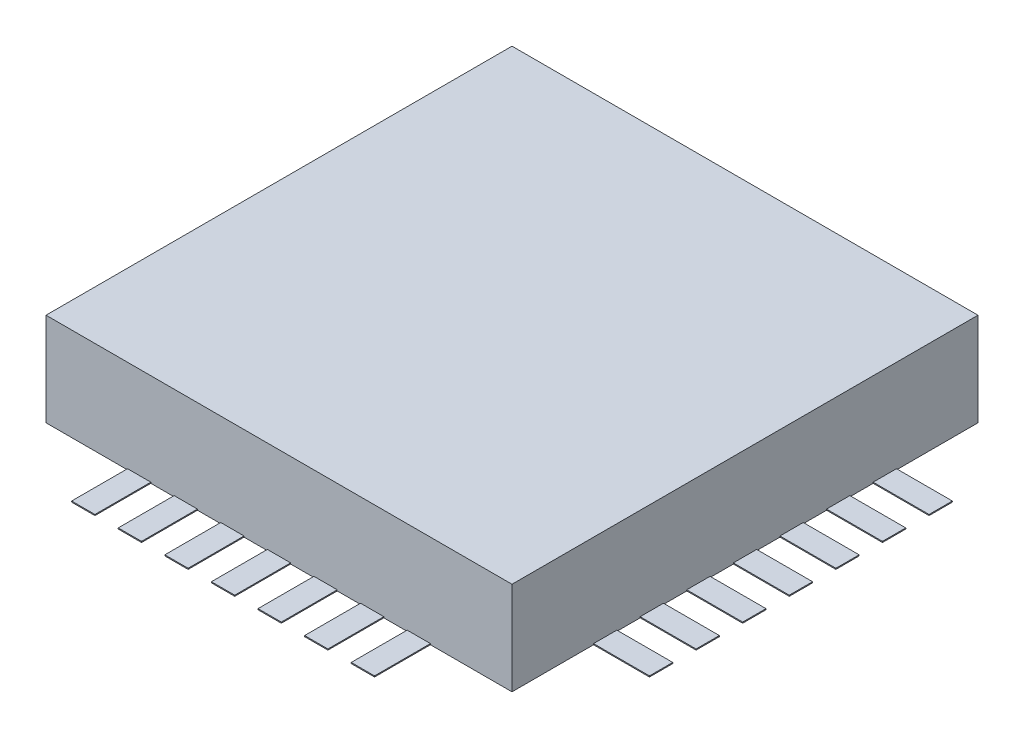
ISO-10303-21;
HEADER;
FILE_DESCRIPTION(('STEP AP214'),'2;1');
FILE_NAME('part.step','',(''),(''),'','','');
FILE_SCHEMA(('AUTOMOTIVE_DESIGN { 1 0 10303 214 1 1 1 1 }'));
ENDSEC;
DATA;
#1=APPLICATION_CONTEXT('core data for automotive mechanical design processes');
#2=APPLICATION_PROTOCOL_DEFINITION('international standard','automotive_design',2000,#1);
#3=PRODUCT_CONTEXT('',#1,'mechanical');
#4=PRODUCT('Part','Part','',(#3));
#5=PRODUCT_RELATED_PRODUCT_CATEGORY('part','',(#4));
#6=PRODUCT_DEFINITION_FORMATION('','',#4);
#7=PRODUCT_DEFINITION_CONTEXT('part definition',#1,'design');
#8=PRODUCT_DEFINITION('design','',#6,#7);
#9=PRODUCT_DEFINITION_SHAPE('','',#8);
#10=(LENGTH_UNIT() NAMED_UNIT(*) SI_UNIT(.MILLI.,.METRE.));
#11=(NAMED_UNIT(*) PLANE_ANGLE_UNIT() SI_UNIT($,.RADIAN.));
#12=(NAMED_UNIT(*) SI_UNIT($,.STERADIAN.) SOLID_ANGLE_UNIT());
#13=UNCERTAINTY_MEASURE_WITH_UNIT(LENGTH_MEASURE(1.E-05),#10,'distance_accuracy_value','');
#14=(GEOMETRIC_REPRESENTATION_CONTEXT(3) GLOBAL_UNCERTAINTY_ASSIGNED_CONTEXT((#13)) GLOBAL_UNIT_ASSIGNED_CONTEXT((#10,
#11,#12)) REPRESENTATION_CONTEXT('',''));
#15=CARTESIAN_POINT('',(0.,0.,0.));
#16=DIRECTION('',(0.,0.,1.));
#17=DIRECTION('',(1.,0.,0.));
#18=AXIS2_PLACEMENT_3D('',#15,#16,#17);
#19=CARTESIAN_POINT('',(3.75,1.652,17.25));
#20=DIRECTION('',(1.,0.,0.));
#21=DIRECTION('',(0.,0.,-1.));
#22=AXIS2_PLACEMENT_3D('',#19,#20,#21);
#23=PLANE('',#22);
#24=DIRECTION('',(0.,0.,-1.));
#25=VECTOR('',#24,1.);
#26=CARTESIAN_POINT('',(3.75,1.652,17.25));
#27=LINE('',#26,#25);
#28=CARTESIAN_POINT('',(3.75,1.652,14.625));
#29=VERTEX_POINT('',#28);
#30=CARTESIAN_POINT('',(3.75,1.652,14.375));
#31=VERTEX_POINT('',#30);
#32=EDGE_CURVE('E429',#29,#31,#27,.T.);
#33=ORIENTED_EDGE('',*,*,#32,.T.);
#34=DIRECTION('',(0.,1.,0.));
#35=VECTOR('',#34,1.);
#36=CARTESIAN_POINT('',(3.75,1.652,14.375));
#37=LINE('',#36,#35);
#38=CARTESIAN_POINT('',(3.75,1.663,14.375));
#39=VERTEX_POINT('',#38);
#40=EDGE_CURVE('E425',#31,#39,#37,.T.);
#41=ORIENTED_EDGE('',*,*,#40,.T.);
#42=DIRECTION('',(0.,0.,1.));
#43=VECTOR('',#42,1.);
#44=CARTESIAN_POINT('',(3.75,1.663,14.25));
#45=LINE('',#44,#43);
#46=CARTESIAN_POINT('',(3.75,1.663,14.125));
#47=VERTEX_POINT('',#46);
#48=EDGE_CURVE('E1343',#47,#39,#45,.T.);
#49=ORIENTED_EDGE('',*,*,#48,.F.);
#50=DIRECTION('',(0.,1.,0.));
#51=VECTOR('',#50,1.);
#52=CARTESIAN_POINT('',(3.75,1.652,14.125));
#53=LINE('',#52,#51);
#54=CARTESIAN_POINT('',(3.75,1.652,14.125));
#55=VERTEX_POINT('',#54);
#56=EDGE_CURVE('E385',#47,#55,#53,.F.);
#57=ORIENTED_EDGE('',*,*,#56,.T.);
#58=DIRECTION('',(0.,0.,-1.));
#59=VECTOR('',#58,1.);
#60=CARTESIAN_POINT('',(3.75,1.652,17.25));
#61=LINE('',#60,#59);
#62=CARTESIAN_POINT('',(3.75,1.652,13.875));
#63=VERTEX_POINT('',#62);
#64=EDGE_CURVE('E20',#55,#63,#61,.T.);
#65=ORIENTED_EDGE('',*,*,#64,.T.);
#66=DIRECTION('',(0.,1.,0.));
#67=VECTOR('',#66,1.);
#68=CARTESIAN_POINT('',(3.75,1.652,13.875));
#69=LINE('',#68,#67);
#70=CARTESIAN_POINT('',(3.75,1.663,13.875));
#71=VERTEX_POINT('',#70);
#72=EDGE_CURVE('E393',#63,#71,#69,.T.);
#73=ORIENTED_EDGE('',*,*,#72,.T.);
#74=DIRECTION('',(0.,0.,1.));
#75=VECTOR('',#74,1.);
#76=CARTESIAN_POINT('',(3.75,1.663,13.75));
#77=LINE('',#76,#75);
#78=CARTESIAN_POINT('',(3.75,1.663,13.625));
#79=VERTEX_POINT('',#78);
#80=EDGE_CURVE('E1365',#79,#71,#77,.T.);
#81=ORIENTED_EDGE('',*,*,#80,.F.);
#82=DIRECTION('',(0.,1.,0.));
#83=VECTOR('',#82,1.);
#84=CARTESIAN_POINT('',(3.75,1.652,13.625));
#85=LINE('',#84,#83);
#86=CARTESIAN_POINT('',(3.75,1.652,13.625));
#87=VERTEX_POINT('',#86);
#88=EDGE_CURVE('E413',#79,#87,#85,.F.);
#89=ORIENTED_EDGE('',*,*,#88,.T.);
#90=DIRECTION('',(0.,0.,-1.));
#91=VECTOR('',#90,1.);
#92=CARTESIAN_POINT('',(3.75,1.652,17.25));
#93=LINE('',#92,#91);
#94=CARTESIAN_POINT('',(3.75,1.652,13.375));
#95=VERTEX_POINT('',#94);
#96=EDGE_CURVE('E415',#87,#95,#93,.T.);
#97=ORIENTED_EDGE('',*,*,#96,.T.);
#98=DIRECTION('',(0.,1.,0.));
#99=VECTOR('',#98,1.);
#100=CARTESIAN_POINT('',(3.75,1.652,13.375));
#101=LINE('',#100,#99);
#102=CARTESIAN_POINT('',(3.75,1.663,13.375));
#103=VERTEX_POINT('',#102);
#104=EDGE_CURVE('E944',#95,#103,#101,.T.);
#105=ORIENTED_EDGE('',*,*,#104,.T.);
#106=DIRECTION('',(0.,0.,-1.));
#107=VECTOR('',#106,1.);
#108=CARTESIAN_POINT('',(3.75,1.663,13.25));
#109=LINE('',#108,#107);
#110=CARTESIAN_POINT('',(3.75,1.663,13.125));
#111=VERTEX_POINT('',#110);
#112=EDGE_CURVE('E653',#103,#111,#109,.T.);
#113=ORIENTED_EDGE('',*,*,#112,.T.);
#114=DIRECTION('',(0.,1.,0.));
#115=VECTOR('',#114,1.);
#116=CARTESIAN_POINT('',(3.75,1.652,13.125));
#117=LINE('',#116,#115);
#118=CARTESIAN_POINT('',(3.75,1.652,13.125));
#119=VERTEX_POINT('',#118);
#120=EDGE_CURVE('E943',#111,#119,#117,.F.);
#121=ORIENTED_EDGE('',*,*,#120,.T.);
#122=DIRECTION('',(0.,0.,-1.));
#123=VECTOR('',#122,1.);
#124=CARTESIAN_POINT('',(3.75,1.652,17.25));
#125=LINE('',#124,#123);
#126=CARTESIAN_POINT('',(3.75,1.652,12.25));
#127=VERTEX_POINT('',#126);
#128=EDGE_CURVE('E648',#119,#127,#125,.T.);
#129=ORIENTED_EDGE('',*,*,#128,.T.);
#130=DIRECTION('',(0.,1.,0.));
#131=VECTOR('',#130,1.);
#132=CARTESIAN_POINT('',(3.75,1.652,12.25));
#133=LINE('',#132,#131);
#134=CARTESIAN_POINT('',(3.75,2.652,12.25));
#135=VERTEX_POINT('',#134);
#136=EDGE_CURVE('E645',#127,#135,#133,.T.);
#137=ORIENTED_EDGE('',*,*,#136,.T.);
#138=DIRECTION('',(0.,0.,1.));
#139=VECTOR('',#138,1.);
#140=CARTESIAN_POINT('',(3.75,2.652,14.75));
#141=LINE('',#140,#139);
#142=CARTESIAN_POINT('',(3.75,2.652,17.25));
#143=VERTEX_POINT('',#142);
#144=EDGE_CURVE('E624',#143,#135,#141,.F.);
#145=ORIENTED_EDGE('',*,*,#144,.F.);
#146=DIRECTION('',(0.,1.,0.));
#147=VECTOR('',#146,1.);
#148=CARTESIAN_POINT('',(3.75,1.652,17.25));
#149=LINE('',#148,#147);
#150=CARTESIAN_POINT('',(3.75,1.652,17.25));
#151=VERTEX_POINT('',#150);
#152=EDGE_CURVE('E617',#151,#143,#149,.T.);
#153=ORIENTED_EDGE('',*,*,#152,.F.);
#154=DIRECTION('',(0.,0.,-1.));
#155=VECTOR('',#154,1.);
#156=CARTESIAN_POINT('',(3.75,1.652,17.25));
#157=LINE('',#156,#155);
#158=CARTESIAN_POINT('',(3.75,1.652,16.375));
#159=VERTEX_POINT('',#158);
#160=EDGE_CURVE('E469',#151,#159,#157,.T.);
#161=ORIENTED_EDGE('',*,*,#160,.T.);
#162=DIRECTION('',(0.,1.,0.));
#163=VECTOR('',#162,1.);
#164=CARTESIAN_POINT('',(3.75,1.652,16.375));
#165=LINE('',#164,#163);
#166=CARTESIAN_POINT('',(3.75,1.663,16.375));
#167=VERTEX_POINT('',#166);
#168=EDGE_CURVE('E464',#159,#167,#165,.T.);
#169=ORIENTED_EDGE('',*,*,#168,.T.);
#170=DIRECTION('',(0.,0.,1.));
#171=VECTOR('',#170,1.);
#172=CARTESIAN_POINT('',(3.75,1.663,16.25));
#173=LINE('',#172,#171);
#174=CARTESIAN_POINT('',(3.75,1.663,16.125));
#175=VERTEX_POINT('',#174);
#176=EDGE_CURVE('E1255',#175,#167,#173,.T.);
#177=ORIENTED_EDGE('',*,*,#176,.F.);
#178=DIRECTION('',(0.,1.,0.));
#179=VECTOR('',#178,1.);
#180=CARTESIAN_POINT('',(3.75,1.652,16.125));
#181=LINE('',#180,#179);
#182=CARTESIAN_POINT('',(3.75,1.652,16.125));
#183=VERTEX_POINT('',#182);
#184=EDGE_CURVE('E462',#175,#183,#181,.F.);
#185=ORIENTED_EDGE('',*,*,#184,.T.);
#186=DIRECTION('',(0.,0.,-1.));
#187=VECTOR('',#186,1.);
#188=CARTESIAN_POINT('',(3.75,1.652,17.25));
#189=LINE('',#188,#187);
#190=CARTESIAN_POINT('',(3.75,1.652,15.875));
#191=VERTEX_POINT('',#190);
#192=EDGE_CURVE('E459',#183,#191,#189,.T.);
#193=ORIENTED_EDGE('',*,*,#192,.T.);
#194=DIRECTION('',(0.,1.,0.));
#195=VECTOR('',#194,1.);
#196=CARTESIAN_POINT('',(3.75,1.652,15.875));
#197=LINE('',#196,#195);
#198=CARTESIAN_POINT('',(3.75,1.663,15.875));
#199=VERTEX_POINT('',#198);
#200=EDGE_CURVE('E454',#191,#199,#197,.T.);
#201=ORIENTED_EDGE('',*,*,#200,.T.);
#202=DIRECTION('',(0.,0.,1.));
#203=VECTOR('',#202,1.);
#204=CARTESIAN_POINT('',(3.75,1.663,15.75));
#205=LINE('',#204,#203);
#206=CARTESIAN_POINT('',(3.75,1.663,15.625));
#207=VERTEX_POINT('',#206);
#208=EDGE_CURVE('E1277',#207,#199,#205,.T.);
#209=ORIENTED_EDGE('',*,*,#208,.F.);
#210=DIRECTION('',(0.,1.,0.));
#211=VECTOR('',#210,1.);
#212=CARTESIAN_POINT('',(3.75,1.652,15.625));
#213=LINE('',#212,#211);
#214=CARTESIAN_POINT('',(3.75,1.652,15.625));
#215=VERTEX_POINT('',#214);
#216=EDGE_CURVE('E452',#207,#215,#213,.F.);
#217=ORIENTED_EDGE('',*,*,#216,.T.);
#218=DIRECTION('',(0.,0.,-1.));
#219=VECTOR('',#218,1.);
#220=CARTESIAN_POINT('',(3.75,1.652,17.25));
#221=LINE('',#220,#219);
#222=CARTESIAN_POINT('',(3.75,1.652,15.375));
#223=VERTEX_POINT('',#222);
#224=EDGE_CURVE('E449',#215,#223,#221,.T.);
#225=ORIENTED_EDGE('',*,*,#224,.T.);
#226=DIRECTION('',(0.,1.,0.));
#227=VECTOR('',#226,1.);
#228=CARTESIAN_POINT('',(3.75,1.652,15.375));
#229=LINE('',#228,#227);
#230=CARTESIAN_POINT('',(3.75,1.663,15.375));
#231=VERTEX_POINT('',#230);
#232=EDGE_CURVE('E444',#223,#231,#229,.T.);
#233=ORIENTED_EDGE('',*,*,#232,.T.);
#234=DIRECTION('',(0.,0.,1.));
#235=VECTOR('',#234,1.);
#236=CARTESIAN_POINT('',(3.75,1.663,15.25));
#237=LINE('',#236,#235);
#238=CARTESIAN_POINT('',(3.75,1.663,15.125));
#239=VERTEX_POINT('',#238);
#240=EDGE_CURVE('E1299',#239,#231,#237,.T.);
#241=ORIENTED_EDGE('',*,*,#240,.F.);
#242=DIRECTION('',(0.,1.,0.));
#243=VECTOR('',#242,1.);
#244=CARTESIAN_POINT('',(3.75,1.652,15.125));
#245=LINE('',#244,#243);
#246=CARTESIAN_POINT('',(3.75,1.652,15.125));
#247=VERTEX_POINT('',#246);
#248=EDGE_CURVE('E442',#239,#247,#245,.F.);
#249=ORIENTED_EDGE('',*,*,#248,.T.);
#250=DIRECTION('',(0.,0.,-1.));
#251=VECTOR('',#250,1.);
#252=CARTESIAN_POINT('',(3.75,1.652,17.25));
#253=LINE('',#252,#251);
#254=CARTESIAN_POINT('',(3.75,1.652,14.875));
#255=VERTEX_POINT('',#254);
#256=EDGE_CURVE('E436',#247,#255,#253,.T.);
#257=ORIENTED_EDGE('',*,*,#256,.T.);
#258=DIRECTION('',(0.,1.,0.));
#259=VECTOR('',#258,1.);
#260=CARTESIAN_POINT('',(3.75,1.652,14.875));
#261=LINE('',#260,#259);
#262=CARTESIAN_POINT('',(3.75,1.663,14.875));
#263=VERTEX_POINT('',#262);
#264=EDGE_CURVE('E432',#255,#263,#261,.T.);
#265=ORIENTED_EDGE('',*,*,#264,.T.);
#266=DIRECTION('',(0.,0.,-1.));
#267=VECTOR('',#266,1.);
#268=CARTESIAN_POINT('',(3.75,1.663,14.75));
#269=LINE('',#268,#267);
#270=CARTESIAN_POINT('',(3.75,1.663,14.625));
#271=VERTEX_POINT('',#270);
#272=EDGE_CURVE('E1321',#263,#271,#269,.T.);
#273=ORIENTED_EDGE('',*,*,#272,.T.);
#274=DIRECTION('',(0.,1.,0.));
#275=VECTOR('',#274,1.);
#276=CARTESIAN_POINT('',(3.75,1.652,14.625));
#277=LINE('',#276,#275);
#278=EDGE_CURVE('E435',#271,#29,#277,.F.);
#279=ORIENTED_EDGE('',*,*,#278,.T.);
#280=EDGE_LOOP('',(#33,#41,#49,#57,#65,#73,#81,#89,#97,#105,#113,#121,#129,#137,#145,#153,#161,
#169,#177,#185,#193,#201,#209,#217,#225,#233,#241,#249,#257,#265,#273,#279));
#281=FACE_BOUND('',#280,.T.);
#282=ADVANCED_FACE('F17',(#281),#23,.T.);
#283=CARTESIAN_POINT('',(-1.25,1.652,12.25));
#284=DIRECTION('',(-1.,0.,0.));
#285=DIRECTION('',(0.,0.,1.));
#286=AXIS2_PLACEMENT_3D('',#283,#284,#285);
#287=PLANE('',#286);
#288=DIRECTION('',(0.,0.,1.));
#289=VECTOR('',#288,1.);
#290=CARTESIAN_POINT('',(-1.25,1.663,13.75));
#291=LINE('',#290,#289);
#292=CARTESIAN_POINT('',(-1.25,1.663,13.875));
#293=VERTEX_POINT('',#292);
#294=CARTESIAN_POINT('',(-1.25,1.663,13.625));
#295=VERTEX_POINT('',#294);
#296=EDGE_CURVE('E969',#293,#295,#291,.F.);
#297=ORIENTED_EDGE('',*,*,#296,.F.);
#298=DIRECTION('',(0.,1.,0.));
#299=VECTOR('',#298,1.);
#300=CARTESIAN_POINT('',(-1.25,1.652,13.875));
#301=LINE('',#300,#299);
#302=CARTESIAN_POINT('',(-1.25,1.652,13.875));
#303=VERTEX_POINT('',#302);
#304=EDGE_CURVE('E594',#293,#303,#301,.F.);
#305=ORIENTED_EDGE('',*,*,#304,.T.);
#306=DIRECTION('',(0.,0.,1.));
#307=VECTOR('',#306,1.);
#308=CARTESIAN_POINT('',(-1.25,1.652,12.25));
#309=LINE('',#308,#307);
#310=CARTESIAN_POINT('',(-1.25,1.652,14.125));
#311=VERTEX_POINT('',#310);
#312=EDGE_CURVE('E428',#303,#311,#309,.T.);
#313=ORIENTED_EDGE('',*,*,#312,.T.);
#314=DIRECTION('',(0.,1.,0.));
#315=VECTOR('',#314,1.);
#316=CARTESIAN_POINT('',(-1.25,1.652,14.125));
#317=LINE('',#316,#315);
#318=CARTESIAN_POINT('',(-1.25,1.663,14.125));
#319=VERTEX_POINT('',#318);
#320=EDGE_CURVE('E587',#311,#319,#317,.T.);
#321=ORIENTED_EDGE('',*,*,#320,.T.);
#322=DIRECTION('',(0.,0.,1.));
#323=VECTOR('',#322,1.);
#324=CARTESIAN_POINT('',(-1.25,1.663,14.25));
#325=LINE('',#324,#323);
#326=CARTESIAN_POINT('',(-1.25,1.663,14.375));
#327=VERTEX_POINT('',#326);
#328=EDGE_CURVE('E991',#327,#319,#325,.F.);
#329=ORIENTED_EDGE('',*,*,#328,.F.);
#330=DIRECTION('',(0.,1.,0.));
#331=VECTOR('',#330,1.);
#332=CARTESIAN_POINT('',(-1.25,1.652,14.375));
#333=LINE('',#332,#331);
#334=CARTESIAN_POINT('',(-1.25,1.652,14.375));
#335=VERTEX_POINT('',#334);
#336=EDGE_CURVE('E585',#327,#335,#333,.F.);
#337=ORIENTED_EDGE('',*,*,#336,.T.);
#338=DIRECTION('',(0.,0.,1.));
#339=VECTOR('',#338,1.);
#340=CARTESIAN_POINT('',(-1.25,1.652,12.25));
#341=LINE('',#340,#339);
#342=CARTESIAN_POINT('',(-1.25,1.652,14.625));
#343=VERTEX_POINT('',#342);
#344=EDGE_CURVE('E579',#335,#343,#341,.T.);
#345=ORIENTED_EDGE('',*,*,#344,.T.);
#346=DIRECTION('',(0.,1.,0.));
#347=VECTOR('',#346,1.);
#348=CARTESIAN_POINT('',(-1.25,1.652,14.625));
#349=LINE('',#348,#347);
#350=CARTESIAN_POINT('',(-1.25,1.663,14.625));
#351=VERTEX_POINT('',#350);
#352=EDGE_CURVE('E575',#343,#351,#349,.T.);
#353=ORIENTED_EDGE('',*,*,#352,.T.);
#354=DIRECTION('',(0.,0.,-1.));
#355=VECTOR('',#354,1.);
#356=CARTESIAN_POINT('',(-1.25,1.663,14.75));
#357=LINE('',#356,#355);
#358=CARTESIAN_POINT('',(-1.25,1.663,14.875));
#359=VERTEX_POINT('',#358);
#360=EDGE_CURVE('E1013',#351,#359,#357,.F.);
#361=ORIENTED_EDGE('',*,*,#360,.T.);
#362=DIRECTION('',(0.,1.,0.));
#363=VECTOR('',#362,1.);
#364=CARTESIAN_POINT('',(-1.25,1.652,14.875));
#365=LINE('',#364,#363);
#366=CARTESIAN_POINT('',(-1.25,1.652,14.875));
#367=VERTEX_POINT('',#366);
#368=EDGE_CURVE('E578',#359,#367,#365,.F.);
#369=ORIENTED_EDGE('',*,*,#368,.T.);
#370=DIRECTION('',(0.,0.,1.));
#371=VECTOR('',#370,1.);
#372=CARTESIAN_POINT('',(-1.25,1.652,12.25));
#373=LINE('',#372,#371);
#374=CARTESIAN_POINT('',(-1.25,1.652,15.125));
#375=VERTEX_POINT('',#374);
#376=EDGE_CURVE('E572',#367,#375,#373,.T.);
#377=ORIENTED_EDGE('',*,*,#376,.T.);
#378=DIRECTION('',(0.,1.,0.));
#379=VECTOR('',#378,1.);
#380=CARTESIAN_POINT('',(-1.25,1.652,15.125));
#381=LINE('',#380,#379);
#382=CARTESIAN_POINT('',(-1.25,1.663,15.125));
#383=VERTEX_POINT('',#382);
#384=EDGE_CURVE('E567',#375,#383,#381,.T.);
#385=ORIENTED_EDGE('',*,*,#384,.T.);
#386=DIRECTION('',(0.,0.,1.));
#387=VECTOR('',#386,1.);
#388=CARTESIAN_POINT('',(-1.25,1.663,15.25));
#389=LINE('',#388,#387);
#390=CARTESIAN_POINT('',(-1.25,1.663,15.375));
#391=VERTEX_POINT('',#390);
#392=EDGE_CURVE('E1035',#391,#383,#389,.F.);
#393=ORIENTED_EDGE('',*,*,#392,.F.);
#394=DIRECTION('',(0.,1.,0.));
#395=VECTOR('',#394,1.);
#396=CARTESIAN_POINT('',(-1.25,1.652,15.375));
#397=LINE('',#396,#395);
#398=CARTESIAN_POINT('',(-1.25,1.652,15.375));
#399=VERTEX_POINT('',#398);
#400=EDGE_CURVE('E565',#391,#399,#397,.F.);
#401=ORIENTED_EDGE('',*,*,#400,.T.);
#402=DIRECTION('',(0.,0.,1.));
#403=VECTOR('',#402,1.);
#404=CARTESIAN_POINT('',(-1.25,1.652,12.25));
#405=LINE('',#404,#403);
#406=CARTESIAN_POINT('',(-1.25,1.652,15.625));
#407=VERTEX_POINT('',#406);
#408=EDGE_CURVE('E562',#399,#407,#405,.T.);
#409=ORIENTED_EDGE('',*,*,#408,.T.);
#410=DIRECTION('',(0.,1.,0.));
#411=VECTOR('',#410,1.);
#412=CARTESIAN_POINT('',(-1.25,1.652,15.625));
#413=LINE('',#412,#411);
#414=CARTESIAN_POINT('',(-1.25,1.663,15.625));
#415=VERTEX_POINT('',#414);
#416=EDGE_CURVE('E557',#407,#415,#413,.T.);
#417=ORIENTED_EDGE('',*,*,#416,.T.);
#418=DIRECTION('',(0.,0.,1.));
#419=VECTOR('',#418,1.);
#420=CARTESIAN_POINT('',(-1.25,1.663,15.75));
#421=LINE('',#420,#419);
#422=CARTESIAN_POINT('',(-1.25,1.663,15.875));
#423=VERTEX_POINT('',#422);
#424=EDGE_CURVE('E1057',#423,#415,#421,.F.);
#425=ORIENTED_EDGE('',*,*,#424,.F.);
#426=DIRECTION('',(0.,1.,0.));
#427=VECTOR('',#426,1.);
#428=CARTESIAN_POINT('',(-1.25,1.652,15.875));
#429=LINE('',#428,#427);
#430=CARTESIAN_POINT('',(-1.25,1.652,15.875));
#431=VERTEX_POINT('',#430);
#432=EDGE_CURVE('E555',#423,#431,#429,.F.);
#433=ORIENTED_EDGE('',*,*,#432,.T.);
#434=DIRECTION('',(0.,0.,1.));
#435=VECTOR('',#434,1.);
#436=CARTESIAN_POINT('',(-1.25,1.652,12.25));
#437=LINE('',#436,#435);
#438=CARTESIAN_POINT('',(-1.25,1.652,16.125));
#439=VERTEX_POINT('',#438);
#440=EDGE_CURVE('E552',#431,#439,#437,.T.);
#441=ORIENTED_EDGE('',*,*,#440,.T.);
#442=DIRECTION('',(0.,1.,0.));
#443=VECTOR('',#442,1.);
#444=CARTESIAN_POINT('',(-1.25,1.652,16.125));
#445=LINE('',#444,#443);
#446=CARTESIAN_POINT('',(-1.25,1.663,16.125));
#447=VERTEX_POINT('',#446);
#448=EDGE_CURVE('E547',#439,#447,#445,.T.);
#449=ORIENTED_EDGE('',*,*,#448,.T.);
#450=DIRECTION('',(0.,0.,1.));
#451=VECTOR('',#450,1.);
#452=CARTESIAN_POINT('',(-1.25,1.663,16.25));
#453=LINE('',#452,#451);
#454=CARTESIAN_POINT('',(-1.25,1.663,16.375));
#455=VERTEX_POINT('',#454);
#456=EDGE_CURVE('E1079',#455,#447,#453,.F.);
#457=ORIENTED_EDGE('',*,*,#456,.F.);
#458=DIRECTION('',(0.,1.,0.));
#459=VECTOR('',#458,1.);
#460=CARTESIAN_POINT('',(-1.25,1.652,16.375));
#461=LINE('',#460,#459);
#462=CARTESIAN_POINT('',(-1.25,1.652,16.375));
#463=VERTEX_POINT('',#462);
#464=EDGE_CURVE('E544',#455,#463,#461,.F.);
#465=ORIENTED_EDGE('',*,*,#464,.T.);
#466=DIRECTION('',(0.,0.,1.));
#467=VECTOR('',#466,1.);
#468=CARTESIAN_POINT('',(-1.25,1.652,12.25));
#469=LINE('',#468,#467);
#470=CARTESIAN_POINT('',(-1.25,1.652,17.25));
#471=VERTEX_POINT('',#470);
#472=EDGE_CURVE('E546',#463,#471,#469,.T.);
#473=ORIENTED_EDGE('',*,*,#472,.T.);
#474=DIRECTION('',(0.,1.,0.));
#475=VECTOR('',#474,1.);
#476=CARTESIAN_POINT('',(-1.25,1.652,17.25));
#477=LINE('',#476,#475);
#478=CARTESIAN_POINT('',(-1.25,2.652,17.25));
#479=VERTEX_POINT('',#478);
#480=EDGE_CURVE('E614',#479,#471,#477,.F.);
#481=ORIENTED_EDGE('',*,*,#480,.F.);
#482=DIRECTION('',(0.,0.,1.));
#483=VECTOR('',#482,1.);
#484=CARTESIAN_POINT('',(-1.25,2.652,14.75));
#485=LINE('',#484,#483);
#486=CARTESIAN_POINT('',(-1.25,2.652,12.25));
#487=VERTEX_POINT('',#486);
#488=EDGE_CURVE('E620',#487,#479,#485,.T.);
#489=ORIENTED_EDGE('',*,*,#488,.F.);
#490=DIRECTION('',(0.,1.,0.));
#491=VECTOR('',#490,1.);
#492=CARTESIAN_POINT('',(-1.25,1.652,12.25));
#493=LINE('',#492,#491);
#494=CARTESIAN_POINT('',(-1.25,1.652,12.25));
#495=VERTEX_POINT('',#494);
#496=EDGE_CURVE('E634',#487,#495,#493,.F.);
#497=ORIENTED_EDGE('',*,*,#496,.T.);
#498=DIRECTION('',(0.,0.,1.));
#499=VECTOR('',#498,1.);
#500=CARTESIAN_POINT('',(-1.25,1.652,12.25));
#501=LINE('',#500,#499);
#502=CARTESIAN_POINT('',(-1.25,1.652,13.125));
#503=VERTEX_POINT('',#502);
#504=EDGE_CURVE('E611',#495,#503,#501,.T.);
#505=ORIENTED_EDGE('',*,*,#504,.T.);
#506=DIRECTION('',(0.,1.,0.));
#507=VECTOR('',#506,1.);
#508=CARTESIAN_POINT('',(-1.25,1.652,13.125));
#509=LINE('',#508,#507);
#510=CARTESIAN_POINT('',(-1.25,1.663,13.125));
#511=VERTEX_POINT('',#510);
#512=EDGE_CURVE('E606',#503,#511,#509,.T.);
#513=ORIENTED_EDGE('',*,*,#512,.T.);
#514=DIRECTION('',(0.,0.,1.));
#515=VECTOR('',#514,1.);
#516=CARTESIAN_POINT('',(-1.25,1.663,13.25));
#517=LINE('',#516,#515);
#518=CARTESIAN_POINT('',(-1.25,1.663,13.375));
#519=VERTEX_POINT('',#518);
#520=EDGE_CURVE('E515',#519,#511,#517,.F.);
#521=ORIENTED_EDGE('',*,*,#520,.F.);
#522=DIRECTION('',(0.,1.,0.));
#523=VECTOR('',#522,1.);
#524=CARTESIAN_POINT('',(-1.25,1.652,13.375));
#525=LINE('',#524,#523);
#526=CARTESIAN_POINT('',(-1.25,1.652,13.375));
#527=VERTEX_POINT('',#526);
#528=EDGE_CURVE('E604',#519,#527,#525,.F.);
#529=ORIENTED_EDGE('',*,*,#528,.T.);
#530=DIRECTION('',(0.,0.,1.));
#531=VECTOR('',#530,1.);
#532=CARTESIAN_POINT('',(-1.25,1.652,12.25));
#533=LINE('',#532,#531);
#534=CARTESIAN_POINT('',(-1.25,1.652,13.625));
#535=VERTEX_POINT('',#534);
#536=EDGE_CURVE('E601',#527,#535,#533,.T.);
#537=ORIENTED_EDGE('',*,*,#536,.T.);
#538=DIRECTION('',(0.,1.,0.));
#539=VECTOR('',#538,1.);
#540=CARTESIAN_POINT('',(-1.25,1.652,13.625));
#541=LINE('',#540,#539);
#542=EDGE_CURVE('E596',#535,#295,#541,.T.);
#543=ORIENTED_EDGE('',*,*,#542,.T.);
#544=EDGE_LOOP('',(#297,#305,#313,#321,#329,#337,#345,#353,#361,#369,#377,#385,#393,#401,#409,
#417,#425,#433,#441,#449,#457,#465,#473,#481,#489,#497,#505,#513,#521,#529,#537,#543));
#545=FACE_BOUND('',#544,.T.);
#546=ADVANCED_FACE('F3211',(#545),#287,.T.);
#547=CARTESIAN_POINT('',(-1.25,1.652,17.25));
#548=DIRECTION('',(0.,0.,1.));
#549=DIRECTION('',(1.,0.,0.));
#550=AXIS2_PLACEMENT_3D('',#547,#548,#549);
#551=PLANE('',#550);
#552=DIRECTION('',(1.,0.,0.));
#553=VECTOR('',#552,1.);
#554=CARTESIAN_POINT('',(0.75,1.663,17.25));
#555=LINE('',#554,#553);
#556=CARTESIAN_POINT('',(0.875,1.663,17.25));
#557=VERTEX_POINT('',#556);
#558=CARTESIAN_POINT('',(0.625,1.663,17.25));
#559=VERTEX_POINT('',#558);
#560=EDGE_CURVE('E1145',#557,#559,#555,.F.);
#561=ORIENTED_EDGE('',*,*,#560,.F.);
#562=DIRECTION('',(0.,1.,0.));
#563=VECTOR('',#562,1.);
#564=CARTESIAN_POINT('',(0.875,1.652,17.25));
#565=LINE('',#564,#563);
#566=CARTESIAN_POINT('',(0.875,1.652,17.25));
#567=VERTEX_POINT('',#566);
#568=EDGE_CURVE('E513',#557,#567,#565,.F.);
#569=ORIENTED_EDGE('',*,*,#568,.T.);
#570=DIRECTION('',(1.,0.,0.));
#571=VECTOR('',#570,1.);
#572=CARTESIAN_POINT('',(-1.25,1.652,17.25));
#573=LINE('',#572,#571);
#574=CARTESIAN_POINT('',(1.125,1.652,17.25));
#575=VERTEX_POINT('',#574);
#576=EDGE_CURVE('E510',#567,#575,#573,.T.);
#577=ORIENTED_EDGE('',*,*,#576,.T.);
#578=DIRECTION('',(0.,1.,0.));
#579=VECTOR('',#578,1.);
#580=CARTESIAN_POINT('',(1.125,1.652,17.25));
#581=LINE('',#580,#579);
#582=CARTESIAN_POINT('',(1.125,1.663,17.25));
#583=VERTEX_POINT('',#582);
#584=EDGE_CURVE('E505',#575,#583,#581,.T.);
#585=ORIENTED_EDGE('',*,*,#584,.T.);
#586=DIRECTION('',(1.,0.,0.));
#587=VECTOR('',#586,1.);
#588=CARTESIAN_POINT('',(1.25,1.663,17.25));
#589=LINE('',#588,#587);
#590=CARTESIAN_POINT('',(1.375,1.663,17.25));
#591=VERTEX_POINT('',#590);
#592=EDGE_CURVE('E1167',#591,#583,#589,.F.);
#593=ORIENTED_EDGE('',*,*,#592,.F.);
#594=DIRECTION('',(0.,1.,0.));
#595=VECTOR('',#594,1.);
#596=CARTESIAN_POINT('',(1.375,1.652,17.25));
#597=LINE('',#596,#595);
#598=CARTESIAN_POINT('',(1.375,1.652,17.25));
#599=VERTEX_POINT('',#598);
#600=EDGE_CURVE('E503',#591,#599,#597,.F.);
#601=ORIENTED_EDGE('',*,*,#600,.T.);
#602=DIRECTION('',(1.,0.,0.));
#603=VECTOR('',#602,1.);
#604=CARTESIAN_POINT('',(-1.25,1.652,17.25));
#605=LINE('',#604,#603);
#606=CARTESIAN_POINT('',(1.625,1.652,17.25));
#607=VERTEX_POINT('',#606);
#608=EDGE_CURVE('E500',#599,#607,#605,.T.);
#609=ORIENTED_EDGE('',*,*,#608,.T.);
#610=DIRECTION('',(0.,1.,0.));
#611=VECTOR('',#610,1.);
#612=CARTESIAN_POINT('',(1.625,1.652,17.25));
#613=LINE('',#612,#611);
#614=CARTESIAN_POINT('',(1.625,1.663,17.25));
#615=VERTEX_POINT('',#614);
#616=EDGE_CURVE('E495',#607,#615,#613,.T.);
#617=ORIENTED_EDGE('',*,*,#616,.T.);
#618=DIRECTION('',(1.,0.,0.));
#619=VECTOR('',#618,1.);
#620=CARTESIAN_POINT('',(1.75,1.663,17.25));
#621=LINE('',#620,#619);
#622=CARTESIAN_POINT('',(1.875,1.663,17.25));
#623=VERTEX_POINT('',#622);
#624=EDGE_CURVE('E1189',#623,#615,#621,.F.);
#625=ORIENTED_EDGE('',*,*,#624,.F.);
#626=DIRECTION('',(0.,1.,0.));
#627=VECTOR('',#626,1.);
#628=CARTESIAN_POINT('',(1.875,1.652,17.25));
#629=LINE('',#628,#627);
#630=CARTESIAN_POINT('',(1.875,1.652,17.25));
#631=VERTEX_POINT('',#630);
#632=EDGE_CURVE('E493',#623,#631,#629,.F.);
#633=ORIENTED_EDGE('',*,*,#632,.T.);
#634=DIRECTION('',(1.,0.,0.));
#635=VECTOR('',#634,1.);
#636=CARTESIAN_POINT('',(-1.25,1.652,17.25));
#637=LINE('',#636,#635);
#638=CARTESIAN_POINT('',(2.125,1.652,17.25));
#639=VERTEX_POINT('',#638);
#640=EDGE_CURVE('E490',#631,#639,#637,.T.);
#641=ORIENTED_EDGE('',*,*,#640,.T.);
#642=DIRECTION('',(0.,1.,0.));
#643=VECTOR('',#642,1.);
#644=CARTESIAN_POINT('',(2.125,1.652,17.25));
#645=LINE('',#644,#643);
#646=CARTESIAN_POINT('',(2.125,1.663,17.25));
#647=VERTEX_POINT('',#646);
#648=EDGE_CURVE('E485',#639,#647,#645,.T.);
#649=ORIENTED_EDGE('',*,*,#648,.T.);
#650=DIRECTION('',(1.,0.,0.));
#651=VECTOR('',#650,1.);
#652=CARTESIAN_POINT('',(2.25,1.663,17.25));
#653=LINE('',#652,#651);
#654=CARTESIAN_POINT('',(2.375,1.663,17.25));
#655=VERTEX_POINT('',#654);
#656=EDGE_CURVE('E1211',#655,#647,#653,.F.);
#657=ORIENTED_EDGE('',*,*,#656,.F.);
#658=DIRECTION('',(0.,1.,0.));
#659=VECTOR('',#658,1.);
#660=CARTESIAN_POINT('',(2.375,1.652,17.25));
#661=LINE('',#660,#659);
#662=CARTESIAN_POINT('',(2.375,1.652,17.25));
#663=VERTEX_POINT('',#662);
#664=EDGE_CURVE('E483',#655,#663,#661,.F.);
#665=ORIENTED_EDGE('',*,*,#664,.T.);
#666=DIRECTION('',(1.,0.,0.));
#667=VECTOR('',#666,1.);
#668=CARTESIAN_POINT('',(-1.25,1.652,17.25));
#669=LINE('',#668,#667);
#670=CARTESIAN_POINT('',(2.625,1.652,17.25));
#671=VERTEX_POINT('',#670);
#672=EDGE_CURVE('E480',#663,#671,#669,.T.);
#673=ORIENTED_EDGE('',*,*,#672,.T.);
#674=DIRECTION('',(0.,1.,0.));
#675=VECTOR('',#674,1.);
#676=CARTESIAN_POINT('',(2.625,1.652,17.25));
#677=LINE('',#676,#675);
#678=CARTESIAN_POINT('',(2.625,1.663,17.25));
#679=VERTEX_POINT('',#678);
#680=EDGE_CURVE('E475',#671,#679,#677,.T.);
#681=ORIENTED_EDGE('',*,*,#680,.T.);
#682=DIRECTION('',(1.,0.,0.));
#683=VECTOR('',#682,1.);
#684=CARTESIAN_POINT('',(2.75,1.663,17.25));
#685=LINE('',#684,#683);
#686=CARTESIAN_POINT('',(2.875,1.663,17.25));
#687=VERTEX_POINT('',#686);
#688=EDGE_CURVE('E1233',#687,#679,#685,.F.);
#689=ORIENTED_EDGE('',*,*,#688,.F.);
#690=DIRECTION('',(0.,1.,0.));
#691=VECTOR('',#690,1.);
#692=CARTESIAN_POINT('',(2.875,1.652,17.25));
#693=LINE('',#692,#691);
#694=CARTESIAN_POINT('',(2.875,1.652,17.25));
#695=VERTEX_POINT('',#694);
#696=EDGE_CURVE('E472',#687,#695,#693,.F.);
#697=ORIENTED_EDGE('',*,*,#696,.T.);
#698=DIRECTION('',(1.,0.,0.));
#699=VECTOR('',#698,1.);
#700=CARTESIAN_POINT('',(-1.25,1.652,17.25));
#701=LINE('',#700,#699);
#702=EDGE_CURVE('E474',#695,#151,#701,.T.);
#703=ORIENTED_EDGE('',*,*,#702,.T.);
#704=ORIENTED_EDGE('',*,*,#152,.T.);
#705=DIRECTION('',(1.,0.,0.));
#706=VECTOR('',#705,1.);
#707=CARTESIAN_POINT('',(1.25,2.652,17.25));
#708=LINE('',#707,#706);
#709=EDGE_CURVE('E623',#479,#143,#708,.T.);
#710=ORIENTED_EDGE('',*,*,#709,.F.);
#711=ORIENTED_EDGE('',*,*,#480,.T.);
#712=DIRECTION('',(1.,0.,0.));
#713=VECTOR('',#712,1.);
#714=CARTESIAN_POINT('',(-1.25,1.652,17.25));
#715=LINE('',#714,#713);
#716=CARTESIAN_POINT('',(-0.375,1.652,17.25));
#717=VERTEX_POINT('',#716);
#718=EDGE_CURVE('E538',#471,#717,#715,.T.);
#719=ORIENTED_EDGE('',*,*,#718,.T.);
#720=DIRECTION('',(0.,1.,0.));
#721=VECTOR('',#720,1.);
#722=CARTESIAN_POINT('',(-0.375,1.652,17.25));
#723=LINE('',#722,#721);
#724=CARTESIAN_POINT('',(-0.375,1.663,17.25));
#725=VERTEX_POINT('',#724);
#726=EDGE_CURVE('E534',#717,#725,#723,.T.);
#727=ORIENTED_EDGE('',*,*,#726,.T.);
#728=DIRECTION('',(1.,0.,0.));
#729=VECTOR('',#728,1.);
#730=CARTESIAN_POINT('',(-0.25,1.663,17.25));
#731=LINE('',#730,#729);
#732=CARTESIAN_POINT('',(-0.125,1.663,17.25));
#733=VERTEX_POINT('',#732);
#734=EDGE_CURVE('E1101',#725,#733,#731,.T.);
#735=ORIENTED_EDGE('',*,*,#734,.T.);
#736=DIRECTION('',(0.,1.,0.));
#737=VECTOR('',#736,1.);
#738=CARTESIAN_POINT('',(-0.125,1.652,17.25));
#739=LINE('',#738,#737);
#740=CARTESIAN_POINT('',(-0.125,1.652,17.25));
#741=VERTEX_POINT('',#740);
#742=EDGE_CURVE('E537',#733,#741,#739,.F.);
#743=ORIENTED_EDGE('',*,*,#742,.T.);
#744=DIRECTION('',(1.,0.,0.));
#745=VECTOR('',#744,1.);
#746=CARTESIAN_POINT('',(-1.25,1.652,17.25));
#747=LINE('',#746,#745);
#748=CARTESIAN_POINT('',(0.125,1.652,17.25));
#749=VERTEX_POINT('',#748);
#750=EDGE_CURVE('E531',#741,#749,#747,.T.);
#751=ORIENTED_EDGE('',*,*,#750,.T.);
#752=DIRECTION('',(0.,1.,0.));
#753=VECTOR('',#752,1.);
#754=CARTESIAN_POINT('',(0.125,1.652,17.25));
#755=LINE('',#754,#753);
#756=CARTESIAN_POINT('',(0.125,1.663,17.25));
#757=VERTEX_POINT('',#756);
#758=EDGE_CURVE('E526',#749,#757,#755,.T.);
#759=ORIENTED_EDGE('',*,*,#758,.T.);
#760=DIRECTION('',(1.,0.,0.));
#761=VECTOR('',#760,1.);
#762=CARTESIAN_POINT('',(0.25,1.663,17.25));
#763=LINE('',#762,#761);
#764=CARTESIAN_POINT('',(0.375,1.663,17.25));
#765=VERTEX_POINT('',#764);
#766=EDGE_CURVE('E1123',#765,#757,#763,.F.);
#767=ORIENTED_EDGE('',*,*,#766,.F.);
#768=DIRECTION('',(0.,1.,0.));
#769=VECTOR('',#768,1.);
#770=CARTESIAN_POINT('',(0.375,1.652,17.25));
#771=LINE('',#770,#769);
#772=CARTESIAN_POINT('',(0.375,1.652,17.25));
#773=VERTEX_POINT('',#772);
#774=EDGE_CURVE('E524',#765,#773,#771,.F.);
#775=ORIENTED_EDGE('',*,*,#774,.T.);
#776=DIRECTION('',(1.,0.,0.));
#777=VECTOR('',#776,1.);
#778=CARTESIAN_POINT('',(-1.25,1.652,17.25));
#779=LINE('',#778,#777);
#780=CARTESIAN_POINT('',(0.625,1.652,17.25));
#781=VERTEX_POINT('',#780);
#782=EDGE_CURVE('E521',#773,#781,#779,.T.);
#783=ORIENTED_EDGE('',*,*,#782,.T.);
#784=DIRECTION('',(0.,1.,0.));
#785=VECTOR('',#784,1.);
#786=CARTESIAN_POINT('',(0.625,1.652,17.25));
#787=LINE('',#786,#785);
#788=EDGE_CURVE('E516',#781,#559,#787,.T.);
#789=ORIENTED_EDGE('',*,*,#788,.T.);
#790=EDGE_LOOP('',(#561,#569,#577,#585,#593,#601,#609,#617,#625,#633,#641,#649,#657,#665,#673,
#681,#689,#697,#703,#704,#710,#711,#719,#727,#735,#743,#751,#759,#767,#775,#783,#789));
#791=FACE_BOUND('',#790,.T.);
#792=ADVANCED_FACE('F2099',(#791),#551,.T.);
#793=CARTESIAN_POINT('',(-1.55,1.663,13.25));
#794=DIRECTION('',(0.,1.,0.));
#795=DIRECTION('',(0.,0.,1.));
#796=AXIS2_PLACEMENT_3D('',#793,#794,#795);
#797=PLANE('',#796);
#798=DIRECTION('',(-1.,0.,0.));
#799=VECTOR('',#798,1.);
#800=CARTESIAN_POINT('',(-1.85,1.663,13.125));
#801=LINE('',#800,#799);
#802=CARTESIAN_POINT('',(-1.85,1.663,13.125));
#803=VERTEX_POINT('',#802);
#804=EDGE_CURVE('E961',#803,#511,#801,.F.);
#805=ORIENTED_EDGE('',*,*,#804,.F.);
#806=DIRECTION('',(0.,0.,1.));
#807=VECTOR('',#806,1.);
#808=CARTESIAN_POINT('',(-1.85,1.663,11.65));
#809=LINE('',#808,#807);
#810=CARTESIAN_POINT('',(-1.85,1.663,13.375));
#811=VERTEX_POINT('',#810);
#812=EDGE_CURVE('E964',#811,#803,#809,.F.);
#813=ORIENTED_EDGE('',*,*,#812,.F.);
#814=DIRECTION('',(1.,0.,0.));
#815=VECTOR('',#814,1.);
#816=CARTESIAN_POINT('',(-1.25,1.663,13.375));
#817=LINE('',#816,#815);
#818=EDGE_CURVE('E972',#519,#811,#817,.F.);
#819=ORIENTED_EDGE('',*,*,#818,.F.);
#820=ORIENTED_EDGE('',*,*,#520,.T.);
#821=EDGE_LOOP('',(#805,#813,#819,#820));
#822=FACE_BOUND('',#821,.T.);
#823=ADVANCED_FACE('F3194',(#822),#797,.T.);
#824=CARTESIAN_POINT('',(-1.55,1.663,13.75));
#825=DIRECTION('',(0.,1.,0.));
#826=DIRECTION('',(0.,0.,1.));
#827=AXIS2_PLACEMENT_3D('',#824,#825,#826);
#828=PLANE('',#827);
#829=DIRECTION('',(-1.,0.,0.));
#830=VECTOR('',#829,1.);
#831=CARTESIAN_POINT('',(-1.85,1.663,13.625));
#832=LINE('',#831,#830);
#833=CARTESIAN_POINT('',(-1.85,1.663,13.625));
#834=VERTEX_POINT('',#833);
#835=EDGE_CURVE('E983',#834,#295,#832,.F.);
#836=ORIENTED_EDGE('',*,*,#835,.F.);
#837=DIRECTION('',(0.,0.,1.));
#838=VECTOR('',#837,1.);
#839=CARTESIAN_POINT('',(-1.85,1.663,11.65));
#840=LINE('',#839,#838);
#841=CARTESIAN_POINT('',(-1.85,1.663,13.875));
#842=VERTEX_POINT('',#841);
#843=EDGE_CURVE('E986',#842,#834,#840,.F.);
#844=ORIENTED_EDGE('',*,*,#843,.F.);
#845=DIRECTION('',(1.,0.,0.));
#846=VECTOR('',#845,1.);
#847=CARTESIAN_POINT('',(-1.25,1.663,13.875));
#848=LINE('',#847,#846);
#849=EDGE_CURVE('E994',#293,#842,#848,.F.);
#850=ORIENTED_EDGE('',*,*,#849,.F.);
#851=ORIENTED_EDGE('',*,*,#296,.T.);
#852=EDGE_LOOP('',(#836,#844,#850,#851));
#853=FACE_BOUND('',#852,.T.);
#854=ADVANCED_FACE('F3185',(#853),#828,.T.);
#855=CARTESIAN_POINT('',(-1.55,1.663,14.25));
#856=DIRECTION('',(0.,1.,0.));
#857=DIRECTION('',(0.,0.,1.));
#858=AXIS2_PLACEMENT_3D('',#855,#856,#857);
#859=PLANE('',#858);
#860=DIRECTION('',(-1.,0.,0.));
#861=VECTOR('',#860,1.);
#862=CARTESIAN_POINT('',(-1.85,1.663,14.125));
#863=LINE('',#862,#861);
#864=CARTESIAN_POINT('',(-1.85,1.663,14.125));
#865=VERTEX_POINT('',#864);
#866=EDGE_CURVE('E1005',#865,#319,#863,.F.);
#867=ORIENTED_EDGE('',*,*,#866,.F.);
#868=DIRECTION('',(0.,0.,1.));
#869=VECTOR('',#868,1.);
#870=CARTESIAN_POINT('',(-1.85,1.663,11.65));
#871=LINE('',#870,#869);
#872=CARTESIAN_POINT('',(-1.85,1.663,14.375));
#873=VERTEX_POINT('',#872);
#874=EDGE_CURVE('E1008',#873,#865,#871,.F.);
#875=ORIENTED_EDGE('',*,*,#874,.F.);
#876=DIRECTION('',(1.,0.,0.));
#877=VECTOR('',#876,1.);
#878=CARTESIAN_POINT('',(-1.25,1.663,14.375));
#879=LINE('',#878,#877);
#880=EDGE_CURVE('E1016',#327,#873,#879,.F.);
#881=ORIENTED_EDGE('',*,*,#880,.F.);
#882=ORIENTED_EDGE('',*,*,#328,.T.);
#883=EDGE_LOOP('',(#867,#875,#881,#882));
#884=FACE_BOUND('',#883,.T.);
#885=ADVANCED_FACE('F3176',(#884),#859,.T.);
#886=CARTESIAN_POINT('',(-1.55,1.663,14.75));
#887=DIRECTION('',(0.,-1.,0.));
#888=DIRECTION('',(0.,0.,-1.));
#889=AXIS2_PLACEMENT_3D('',#886,#887,#888);
#890=PLANE('',#889);
#891=ORIENTED_EDGE('',*,*,#360,.F.);
#892=DIRECTION('',(-1.,0.,0.));
#893=VECTOR('',#892,1.);
#894=CARTESIAN_POINT('',(-1.85,1.663,14.625));
#895=LINE('',#894,#893);
#896=CARTESIAN_POINT('',(-1.85,1.663,14.625));
#897=VERTEX_POINT('',#896);
#898=EDGE_CURVE('E1027',#897,#351,#895,.F.);
#899=ORIENTED_EDGE('',*,*,#898,.F.);
#900=DIRECTION('',(0.,0.,1.));
#901=VECTOR('',#900,1.);
#902=CARTESIAN_POINT('',(-1.85,1.663,11.65));
#903=LINE('',#902,#901);
#904=CARTESIAN_POINT('',(-1.85,1.663,14.875));
#905=VERTEX_POINT('',#904);
#906=EDGE_CURVE('E1030',#905,#897,#903,.F.);
#907=ORIENTED_EDGE('',*,*,#906,.F.);
#908=DIRECTION('',(1.,0.,0.));
#909=VECTOR('',#908,1.);
#910=CARTESIAN_POINT('',(-1.25,1.663,14.875));
#911=LINE('',#910,#909);
#912=EDGE_CURVE('E1038',#359,#905,#911,.F.);
#913=ORIENTED_EDGE('',*,*,#912,.F.);
#914=EDGE_LOOP('',(#891,#899,#907,#913));
#915=FACE_BOUND('',#914,.T.);
#916=ADVANCED_FACE('F3167',(#915),#890,.F.);
#917=CARTESIAN_POINT('',(-1.55,1.663,15.25));
#918=DIRECTION('',(0.,1.,0.));
#919=DIRECTION('',(0.,0.,1.));
#920=AXIS2_PLACEMENT_3D('',#917,#918,#919);
#921=PLANE('',#920);
#922=DIRECTION('',(-1.,0.,0.));
#923=VECTOR('',#922,1.);
#924=CARTESIAN_POINT('',(-1.85,1.663,15.125));
#925=LINE('',#924,#923);
#926=CARTESIAN_POINT('',(-1.85,1.663,15.125));
#927=VERTEX_POINT('',#926);
#928=EDGE_CURVE('E1049',#927,#383,#925,.F.);
#929=ORIENTED_EDGE('',*,*,#928,.F.);
#930=DIRECTION('',(0.,0.,1.));
#931=VECTOR('',#930,1.);
#932=CARTESIAN_POINT('',(-1.85,1.663,11.65));
#933=LINE('',#932,#931);
#934=CARTESIAN_POINT('',(-1.85,1.663,15.375));
#935=VERTEX_POINT('',#934);
#936=EDGE_CURVE('E1052',#935,#927,#933,.F.);
#937=ORIENTED_EDGE('',*,*,#936,.F.);
#938=DIRECTION('',(1.,0.,0.));
#939=VECTOR('',#938,1.);
#940=CARTESIAN_POINT('',(-1.25,1.663,15.375));
#941=LINE('',#940,#939);
#942=EDGE_CURVE('E1060',#391,#935,#941,.F.);
#943=ORIENTED_EDGE('',*,*,#942,.F.);
#944=ORIENTED_EDGE('',*,*,#392,.T.);
#945=EDGE_LOOP('',(#929,#937,#943,#944));
#946=FACE_BOUND('',#945,.T.);
#947=ADVANCED_FACE('F3158',(#946),#921,.T.);
#948=CARTESIAN_POINT('',(-1.55,1.663,15.75));
#949=DIRECTION('',(0.,1.,0.));
#950=DIRECTION('',(0.,0.,1.));
#951=AXIS2_PLACEMENT_3D('',#948,#949,#950);
#952=PLANE('',#951);
#953=DIRECTION('',(1.,0.,0.));
#954=VECTOR('',#953,1.);
#955=CARTESIAN_POINT('',(-1.25,1.663,15.875));
#956=LINE('',#955,#954);
#957=CARTESIAN_POINT('',(-1.85,1.663,15.875));
#958=VERTEX_POINT('',#957);
#959=EDGE_CURVE('E1082',#423,#958,#956,.F.);
#960=ORIENTED_EDGE('',*,*,#959,.F.);
#961=ORIENTED_EDGE('',*,*,#424,.T.);
#962=DIRECTION('',(-1.,0.,0.));
#963=VECTOR('',#962,1.);
#964=CARTESIAN_POINT('',(-1.85,1.663,15.625));
#965=LINE('',#964,#963);
#966=CARTESIAN_POINT('',(-1.85,1.663,15.625));
#967=VERTEX_POINT('',#966);
#968=EDGE_CURVE('E1071',#967,#415,#965,.F.);
#969=ORIENTED_EDGE('',*,*,#968,.F.);
#970=DIRECTION('',(0.,0.,1.));
#971=VECTOR('',#970,1.);
#972=CARTESIAN_POINT('',(-1.85,1.663,11.65));
#973=LINE('',#972,#971);
#974=EDGE_CURVE('E1074',#958,#967,#973,.F.);
#975=ORIENTED_EDGE('',*,*,#974,.F.);
#976=EDGE_LOOP('',(#960,#961,#969,#975));
#977=FACE_BOUND('',#976,.T.);
#978=ADVANCED_FACE('F3149',(#977),#952,.T.);
#979=CARTESIAN_POINT('',(-1.55,1.663,16.25));
#980=DIRECTION('',(0.,1.,0.));
#981=DIRECTION('',(0.,0.,1.));
#982=AXIS2_PLACEMENT_3D('',#979,#980,#981);
#983=PLANE('',#982);
#984=DIRECTION('',(-1.,0.,0.));
#985=VECTOR('',#984,1.);
#986=CARTESIAN_POINT('',(-1.85,1.663,16.125));
#987=LINE('',#986,#985);
#988=CARTESIAN_POINT('',(-1.85,1.663,16.125));
#989=VERTEX_POINT('',#988);
#990=EDGE_CURVE('E1093',#989,#447,#987,.F.);
#991=ORIENTED_EDGE('',*,*,#990,.F.);
#992=DIRECTION('',(0.,0.,1.));
#993=VECTOR('',#992,1.);
#994=CARTESIAN_POINT('',(-1.85,1.663,11.65));
#995=LINE('',#994,#993);
#996=CARTESIAN_POINT('',(-1.85,1.663,16.375));
#997=VERTEX_POINT('',#996);
#998=EDGE_CURVE('E1096',#997,#989,#995,.F.);
#999=ORIENTED_EDGE('',*,*,#998,.F.);
#1000=DIRECTION('',(1.,0.,0.));
#1001=VECTOR('',#1000,1.);
#1002=CARTESIAN_POINT('',(-1.25,1.663,16.375));
#1003=LINE('',#1002,#1001);
#1004=EDGE_CURVE('E1104',#455,#997,#1003,.F.);
#1005=ORIENTED_EDGE('',*,*,#1004,.F.);
#1006=ORIENTED_EDGE('',*,*,#456,.T.);
#1007=EDGE_LOOP('',(#991,#999,#1005,#1006));
#1008=FACE_BOUND('',#1007,.T.);
#1009=ADVANCED_FACE('F3140',(#1008),#983,.T.);
#1010=CARTESIAN_POINT('',(-0.25,1.663,17.55));
#1011=DIRECTION('',(0.,-1.,0.));
#1012=DIRECTION('',(0.,0.,-1.));
#1013=AXIS2_PLACEMENT_3D('',#1010,#1011,#1012);
#1014=PLANE('',#1013);
#1015=ORIENTED_EDGE('',*,*,#734,.F.);
#1016=DIRECTION('',(0.,0.,1.));
#1017=VECTOR('',#1016,1.);
#1018=CARTESIAN_POINT('',(-0.375,1.663,17.85));
#1019=LINE('',#1018,#1017);
#1020=CARTESIAN_POINT('',(-0.375,1.663,17.85));
#1021=VERTEX_POINT('',#1020);
#1022=EDGE_CURVE('E1115',#1021,#725,#1019,.F.);
#1023=ORIENTED_EDGE('',*,*,#1022,.F.);
#1024=DIRECTION('',(1.,0.,0.));
#1025=VECTOR('',#1024,1.);
#1026=CARTESIAN_POINT('',(-1.85,1.663,17.85));
#1027=LINE('',#1026,#1025);
#1028=CARTESIAN_POINT('',(-0.125,1.663,17.85));
#1029=VERTEX_POINT('',#1028);
#1030=EDGE_CURVE('E1118',#1029,#1021,#1027,.F.);
#1031=ORIENTED_EDGE('',*,*,#1030,.F.);
#1032=DIRECTION('',(0.,0.,-1.));
#1033=VECTOR('',#1032,1.);
#1034=CARTESIAN_POINT('',(-0.125,1.663,17.25));
#1035=LINE('',#1034,#1033);
#1036=EDGE_CURVE('E1126',#733,#1029,#1035,.F.);
#1037=ORIENTED_EDGE('',*,*,#1036,.F.);
#1038=EDGE_LOOP('',(#1015,#1023,#1031,#1037));
#1039=FACE_BOUND('',#1038,.T.);
#1040=ADVANCED_FACE('F3131',(#1039),#1014,.F.);
#1041=CARTESIAN_POINT('',(0.25,1.663,17.55));
#1042=DIRECTION('',(0.,1.,0.));
#1043=DIRECTION('',(0.,0.,1.));
#1044=AXIS2_PLACEMENT_3D('',#1041,#1042,#1043);
#1045=PLANE('',#1044);
#1046=DIRECTION('',(0.,0.,1.));
#1047=VECTOR('',#1046,1.);
#1048=CARTESIAN_POINT('',(0.125,1.663,17.85));
#1049=LINE('',#1048,#1047);
#1050=CARTESIAN_POINT('',(0.125,1.663,17.85));
#1051=VERTEX_POINT('',#1050);
#1052=EDGE_CURVE('E1137',#1051,#757,#1049,.F.);
#1053=ORIENTED_EDGE('',*,*,#1052,.F.);
#1054=DIRECTION('',(1.,0.,0.));
#1055=VECTOR('',#1054,1.);
#1056=CARTESIAN_POINT('',(-1.85,1.663,17.85));
#1057=LINE('',#1056,#1055);
#1058=CARTESIAN_POINT('',(0.375,1.663,17.85));
#1059=VERTEX_POINT('',#1058);
#1060=EDGE_CURVE('E1140',#1059,#1051,#1057,.F.);
#1061=ORIENTED_EDGE('',*,*,#1060,.F.);
#1062=DIRECTION('',(0.,0.,-1.));
#1063=VECTOR('',#1062,1.);
#1064=CARTESIAN_POINT('',(0.375,1.663,17.25));
#1065=LINE('',#1064,#1063);
#1066=EDGE_CURVE('E1148',#765,#1059,#1065,.F.);
#1067=ORIENTED_EDGE('',*,*,#1066,.F.);
#1068=ORIENTED_EDGE('',*,*,#766,.T.);
#1069=EDGE_LOOP('',(#1053,#1061,#1067,#1068));
#1070=FACE_BOUND('',#1069,.T.);
#1071=ADVANCED_FACE('F3122',(#1070),#1045,.T.);
#1072=CARTESIAN_POINT('',(0.75,1.663,17.55));
#1073=DIRECTION('',(0.,1.,0.));
#1074=DIRECTION('',(0.,0.,1.));
#1075=AXIS2_PLACEMENT_3D('',#1072,#1073,#1074);
#1076=PLANE('',#1075);
#1077=DIRECTION('',(0.,0.,1.));
#1078=VECTOR('',#1077,1.);
#1079=CARTESIAN_POINT('',(0.625,1.663,17.85));
#1080=LINE('',#1079,#1078);
#1081=CARTESIAN_POINT('',(0.625,1.663,17.85));
#1082=VERTEX_POINT('',#1081);
#1083=EDGE_CURVE('E1159',#1082,#559,#1080,.F.);
#1084=ORIENTED_EDGE('',*,*,#1083,.F.);
#1085=DIRECTION('',(1.,0.,0.));
#1086=VECTOR('',#1085,1.);
#1087=CARTESIAN_POINT('',(-1.85,1.663,17.85));
#1088=LINE('',#1087,#1086);
#1089=CARTESIAN_POINT('',(0.875,1.663,17.85));
#1090=VERTEX_POINT('',#1089);
#1091=EDGE_CURVE('E1162',#1090,#1082,#1088,.F.);
#1092=ORIENTED_EDGE('',*,*,#1091,.F.);
#1093=DIRECTION('',(0.,0.,-1.));
#1094=VECTOR('',#1093,1.);
#1095=CARTESIAN_POINT('',(0.875,1.663,17.25));
#1096=LINE('',#1095,#1094);
#1097=EDGE_CURVE('E1170',#557,#1090,#1096,.F.);
#1098=ORIENTED_EDGE('',*,*,#1097,.F.);
#1099=ORIENTED_EDGE('',*,*,#560,.T.);
#1100=EDGE_LOOP('',(#1084,#1092,#1098,#1099));
#1101=FACE_BOUND('',#1100,.T.);
#1102=ADVANCED_FACE('F3113',(#1101),#1076,.T.);
#1103=CARTESIAN_POINT('',(1.25,1.663,17.55));
#1104=DIRECTION('',(0.,1.,0.));
#1105=DIRECTION('',(0.,0.,1.));
#1106=AXIS2_PLACEMENT_3D('',#1103,#1104,#1105);
#1107=PLANE('',#1106);
#1108=DIRECTION('',(0.,0.,1.));
#1109=VECTOR('',#1108,1.);
#1110=CARTESIAN_POINT('',(1.125,1.663,17.85));
#1111=LINE('',#1110,#1109);
#1112=CARTESIAN_POINT('',(1.125,1.663,17.85));
#1113=VERTEX_POINT('',#1112);
#1114=EDGE_CURVE('E1181',#1113,#583,#1111,.F.);
#1115=ORIENTED_EDGE('',*,*,#1114,.F.);
#1116=DIRECTION('',(1.,0.,0.));
#1117=VECTOR('',#1116,1.);
#1118=CARTESIAN_POINT('',(-1.85,1.663,17.85));
#1119=LINE('',#1118,#1117);
#1120=CARTESIAN_POINT('',(1.375,1.663,17.85));
#1121=VERTEX_POINT('',#1120);
#1122=EDGE_CURVE('E1184',#1121,#1113,#1119,.F.);
#1123=ORIENTED_EDGE('',*,*,#1122,.F.);
#1124=DIRECTION('',(0.,0.,-1.));
#1125=VECTOR('',#1124,1.);
#1126=CARTESIAN_POINT('',(1.375,1.663,17.25));
#1127=LINE('',#1126,#1125);
#1128=EDGE_CURVE('E1192',#591,#1121,#1127,.F.);
#1129=ORIENTED_EDGE('',*,*,#1128,.F.);
#1130=ORIENTED_EDGE('',*,*,#592,.T.);
#1131=EDGE_LOOP('',(#1115,#1123,#1129,#1130));
#1132=FACE_BOUND('',#1131,.T.);
#1133=ADVANCED_FACE('F3104',(#1132),#1107,.T.);
#1134=CARTESIAN_POINT('',(1.75,1.663,17.55));
#1135=DIRECTION('',(0.,1.,0.));
#1136=DIRECTION('',(0.,0.,1.));
#1137=AXIS2_PLACEMENT_3D('',#1134,#1135,#1136);
#1138=PLANE('',#1137);
#1139=DIRECTION('',(0.,0.,1.));
#1140=VECTOR('',#1139,1.);
#1141=CARTESIAN_POINT('',(1.625,1.663,17.85));
#1142=LINE('',#1141,#1140);
#1143=CARTESIAN_POINT('',(1.625,1.663,17.85));
#1144=VERTEX_POINT('',#1143);
#1145=EDGE_CURVE('E1203',#1144,#615,#1142,.F.);
#1146=ORIENTED_EDGE('',*,*,#1145,.F.);
#1147=DIRECTION('',(1.,0.,0.));
#1148=VECTOR('',#1147,1.);
#1149=CARTESIAN_POINT('',(-1.85,1.663,17.85));
#1150=LINE('',#1149,#1148);
#1151=CARTESIAN_POINT('',(1.875,1.663,17.85));
#1152=VERTEX_POINT('',#1151);
#1153=EDGE_CURVE('E1206',#1152,#1144,#1150,.F.);
#1154=ORIENTED_EDGE('',*,*,#1153,.F.);
#1155=DIRECTION('',(0.,0.,-1.));
#1156=VECTOR('',#1155,1.);
#1157=CARTESIAN_POINT('',(1.875,1.663,17.25));
#1158=LINE('',#1157,#1156);
#1159=EDGE_CURVE('E1214',#623,#1152,#1158,.F.);
#1160=ORIENTED_EDGE('',*,*,#1159,.F.);
#1161=ORIENTED_EDGE('',*,*,#624,.T.);
#1162=EDGE_LOOP('',(#1146,#1154,#1160,#1161));
#1163=FACE_BOUND('',#1162,.T.);
#1164=ADVANCED_FACE('F3095',(#1163),#1138,.T.);
#1165=CARTESIAN_POINT('',(2.25,1.663,17.55));
#1166=DIRECTION('',(0.,1.,0.));
#1167=DIRECTION('',(0.,0.,1.));
#1168=AXIS2_PLACEMENT_3D('',#1165,#1166,#1167);
#1169=PLANE('',#1168);
#1170=DIRECTION('',(0.,0.,-1.));
#1171=VECTOR('',#1170,1.);
#1172=CARTESIAN_POINT('',(2.375,1.663,17.25));
#1173=LINE('',#1172,#1171);
#1174=CARTESIAN_POINT('',(2.375,1.663,17.85));
#1175=VERTEX_POINT('',#1174);
#1176=EDGE_CURVE('E1236',#655,#1175,#1173,.F.);
#1177=ORIENTED_EDGE('',*,*,#1176,.F.);
#1178=ORIENTED_EDGE('',*,*,#656,.T.);
#1179=DIRECTION('',(0.,0.,1.));
#1180=VECTOR('',#1179,1.);
#1181=CARTESIAN_POINT('',(2.125,1.663,17.85));
#1182=LINE('',#1181,#1180);
#1183=CARTESIAN_POINT('',(2.125,1.663,17.85));
#1184=VERTEX_POINT('',#1183);
#1185=EDGE_CURVE('E1225',#1184,#647,#1182,.F.);
#1186=ORIENTED_EDGE('',*,*,#1185,.F.);
#1187=DIRECTION('',(1.,0.,0.));
#1188=VECTOR('',#1187,1.);
#1189=CARTESIAN_POINT('',(-1.85,1.663,17.85));
#1190=LINE('',#1189,#1188);
#1191=EDGE_CURVE('E1228',#1175,#1184,#1190,.F.);
#1192=ORIENTED_EDGE('',*,*,#1191,.F.);
#1193=EDGE_LOOP('',(#1177,#1178,#1186,#1192));
#1194=FACE_BOUND('',#1193,.T.);
#1195=ADVANCED_FACE('F3086',(#1194),#1169,.T.);
#1196=CARTESIAN_POINT('',(2.75,1.663,17.55));
#1197=DIRECTION('',(0.,1.,0.));
#1198=DIRECTION('',(0.,0.,1.));
#1199=AXIS2_PLACEMENT_3D('',#1196,#1197,#1198);
#1200=PLANE('',#1199);
#1201=DIRECTION('',(0.,0.,1.));
#1202=VECTOR('',#1201,1.);
#1203=CARTESIAN_POINT('',(2.625,1.663,17.85));
#1204=LINE('',#1203,#1202);
#1205=CARTESIAN_POINT('',(2.625,1.663,17.85));
#1206=VERTEX_POINT('',#1205);
#1207=EDGE_CURVE('E1247',#1206,#679,#1204,.F.);
#1208=ORIENTED_EDGE('',*,*,#1207,.F.);
#1209=DIRECTION('',(1.,0.,0.));
#1210=VECTOR('',#1209,1.);
#1211=CARTESIAN_POINT('',(-1.85,1.663,17.85));
#1212=LINE('',#1211,#1210);
#1213=CARTESIAN_POINT('',(2.875,1.663,17.85));
#1214=VERTEX_POINT('',#1213);
#1215=EDGE_CURVE('E1250',#1214,#1206,#1212,.F.);
#1216=ORIENTED_EDGE('',*,*,#1215,.F.);
#1217=DIRECTION('',(0.,0.,-1.));
#1218=VECTOR('',#1217,1.);
#1219=CARTESIAN_POINT('',(2.875,1.663,17.25));
#1220=LINE('',#1219,#1218);
#1221=EDGE_CURVE('E1258',#687,#1214,#1220,.F.);
#1222=ORIENTED_EDGE('',*,*,#1221,.F.);
#1223=ORIENTED_EDGE('',*,*,#688,.T.);
#1224=EDGE_LOOP('',(#1208,#1216,#1222,#1223));
#1225=FACE_BOUND('',#1224,.T.);
#1226=ADVANCED_FACE('F3078',(#1225),#1200,.T.);
#1227=CARTESIAN_POINT('',(4.05,1.663,16.25));
#1228=DIRECTION('',(0.,1.,0.));
#1229=DIRECTION('',(0.,0.,1.));
#1230=AXIS2_PLACEMENT_3D('',#1227,#1228,#1229);
#1231=PLANE('',#1230);
#1232=DIRECTION('',(-1.,0.,0.));
#1233=VECTOR('',#1232,1.);
#1234=CARTESIAN_POINT('',(3.75,1.663,16.125));
#1235=LINE('',#1234,#1233);
#1236=CARTESIAN_POINT('',(4.35,1.663,16.125));
#1237=VERTEX_POINT('',#1236);
#1238=EDGE_CURVE('E1280',#175,#1237,#1235,.F.);
#1239=ORIENTED_EDGE('',*,*,#1238,.F.);
#1240=ORIENTED_EDGE('',*,*,#176,.T.);
#1241=DIRECTION('',(1.,0.,0.));
#1242=VECTOR('',#1241,1.);
#1243=CARTESIAN_POINT('',(4.35,1.663,16.375));
#1244=LINE('',#1243,#1242);
#1245=CARTESIAN_POINT('',(4.35,1.663,16.375));
#1246=VERTEX_POINT('',#1245);
#1247=EDGE_CURVE('E1269',#1246,#167,#1244,.F.);
#1248=ORIENTED_EDGE('',*,*,#1247,.F.);
#1249=DIRECTION('',(0.,0.,-1.));
#1250=VECTOR('',#1249,1.);
#1251=CARTESIAN_POINT('',(4.35,1.663,17.85));
#1252=LINE('',#1251,#1250);
#1253=EDGE_CURVE('E1272',#1237,#1246,#1252,.F.);
#1254=ORIENTED_EDGE('',*,*,#1253,.F.);
#1255=EDGE_LOOP('',(#1239,#1240,#1248,#1254));
#1256=FACE_BOUND('',#1255,.T.);
#1257=ADVANCED_FACE('F2115',(#1256),#1231,.T.);
#1258=CARTESIAN_POINT('',(4.05,1.663,15.75));
#1259=DIRECTION('',(0.,1.,0.));
#1260=DIRECTION('',(0.,0.,1.));
#1261=AXIS2_PLACEMENT_3D('',#1258,#1259,#1260);
#1262=PLANE('',#1261);
#1263=DIRECTION('',(1.,0.,0.));
#1264=VECTOR('',#1263,1.);
#1265=CARTESIAN_POINT('',(4.35,1.663,15.875));
#1266=LINE('',#1265,#1264);
#1267=CARTESIAN_POINT('',(4.35,1.663,15.875));
#1268=VERTEX_POINT('',#1267);
#1269=EDGE_CURVE('E1291',#1268,#199,#1266,.F.);
#1270=ORIENTED_EDGE('',*,*,#1269,.F.);
#1271=DIRECTION('',(0.,0.,-1.));
#1272=VECTOR('',#1271,1.);
#1273=CARTESIAN_POINT('',(4.35,1.663,17.85));
#1274=LINE('',#1273,#1272);
#1275=CARTESIAN_POINT('',(4.35,1.663,15.625));
#1276=VERTEX_POINT('',#1275);
#1277=EDGE_CURVE('E1294',#1276,#1268,#1274,.F.);
#1278=ORIENTED_EDGE('',*,*,#1277,.F.);
#1279=DIRECTION('',(-1.,0.,0.));
#1280=VECTOR('',#1279,1.);
#1281=CARTESIAN_POINT('',(3.75,1.663,15.625));
#1282=LINE('',#1281,#1280);
#1283=EDGE_CURVE('E1302',#207,#1276,#1282,.F.);
#1284=ORIENTED_EDGE('',*,*,#1283,.F.);
#1285=ORIENTED_EDGE('',*,*,#208,.T.);
#1286=EDGE_LOOP('',(#1270,#1278,#1284,#1285));
#1287=FACE_BOUND('',#1286,.T.);
#1288=ADVANCED_FACE('F2131',(#1287),#1262,.T.);
#1289=CARTESIAN_POINT('',(4.05,1.663,15.25));
#1290=DIRECTION('',(0.,1.,0.));
#1291=DIRECTION('',(0.,0.,1.));
#1292=AXIS2_PLACEMENT_3D('',#1289,#1290,#1291);
#1293=PLANE('',#1292);
#1294=DIRECTION('',(-1.,0.,0.));
#1295=VECTOR('',#1294,1.);
#1296=CARTESIAN_POINT('',(3.75,1.663,15.125));
#1297=LINE('',#1296,#1295);
#1298=CARTESIAN_POINT('',(4.35,1.663,15.125));
#1299=VERTEX_POINT('',#1298);
#1300=EDGE_CURVE('E1324',#239,#1299,#1297,.F.);
#1301=ORIENTED_EDGE('',*,*,#1300,.F.);
#1302=ORIENTED_EDGE('',*,*,#240,.T.);
#1303=DIRECTION('',(1.,0.,0.));
#1304=VECTOR('',#1303,1.);
#1305=CARTESIAN_POINT('',(4.35,1.663,15.375));
#1306=LINE('',#1305,#1304);
#1307=CARTESIAN_POINT('',(4.35,1.663,15.375));
#1308=VERTEX_POINT('',#1307);
#1309=EDGE_CURVE('E1313',#1308,#231,#1306,.F.);
#1310=ORIENTED_EDGE('',*,*,#1309,.F.);
#1311=DIRECTION('',(0.,0.,-1.));
#1312=VECTOR('',#1311,1.);
#1313=CARTESIAN_POINT('',(4.35,1.663,17.85));
#1314=LINE('',#1313,#1312);
#1315=EDGE_CURVE('E1316',#1299,#1308,#1314,.F.);
#1316=ORIENTED_EDGE('',*,*,#1315,.F.);
#1317=EDGE_LOOP('',(#1301,#1302,#1310,#1316));
#1318=FACE_BOUND('',#1317,.T.);
#1319=ADVANCED_FACE('F2149',(#1318),#1293,.T.);
#1320=CARTESIAN_POINT('',(4.05,1.663,14.75));
#1321=DIRECTION('',(0.,-1.,0.));
#1322=DIRECTION('',(0.,0.,-1.));
#1323=AXIS2_PLACEMENT_3D('',#1320,#1321,#1322);
#1324=PLANE('',#1323);
#1325=DIRECTION('',(0.,0.,-1.));
#1326=VECTOR('',#1325,1.);
#1327=CARTESIAN_POINT('',(4.35,1.663,17.85));
#1328=LINE('',#1327,#1326);
#1329=CARTESIAN_POINT('',(4.35,1.663,14.625));
#1330=VERTEX_POINT('',#1329);
#1331=CARTESIAN_POINT('',(4.35,1.663,14.875));
#1332=VERTEX_POINT('',#1331);
#1333=EDGE_CURVE('E1338',#1330,#1332,#1328,.F.);
#1334=ORIENTED_EDGE('',*,*,#1333,.F.);
#1335=DIRECTION('',(-1.,0.,0.));
#1336=VECTOR('',#1335,1.);
#1337=CARTESIAN_POINT('',(3.75,1.663,14.625));
#1338=LINE('',#1337,#1336);
#1339=EDGE_CURVE('E1346',#271,#1330,#1338,.F.);
#1340=ORIENTED_EDGE('',*,*,#1339,.F.);
#1341=ORIENTED_EDGE('',*,*,#272,.F.);
#1342=DIRECTION('',(1.,0.,0.));
#1343=VECTOR('',#1342,1.);
#1344=CARTESIAN_POINT('',(4.35,1.663,14.875));
#1345=LINE('',#1344,#1343);
#1346=EDGE_CURVE('E1335',#1332,#263,#1345,.F.);
#1347=ORIENTED_EDGE('',*,*,#1346,.F.);
#1348=EDGE_LOOP('',(#1334,#1340,#1341,#1347));
#1349=FACE_BOUND('',#1348,.T.);
#1350=ADVANCED_FACE('F2166',(#1349),#1324,.F.);
#1351=CARTESIAN_POINT('',(4.05,1.663,14.25));
#1352=DIRECTION('',(0.,1.,0.));
#1353=DIRECTION('',(0.,0.,1.));
#1354=AXIS2_PLACEMENT_3D('',#1351,#1352,#1353);
#1355=PLANE('',#1354);
#1356=DIRECTION('',(-1.,0.,0.));
#1357=VECTOR('',#1356,1.);
#1358=CARTESIAN_POINT('',(3.75,1.663,14.125));
#1359=LINE('',#1358,#1357);
#1360=CARTESIAN_POINT('',(4.35,1.663,14.125));
#1361=VERTEX_POINT('',#1360);
#1362=EDGE_CURVE('E1368',#47,#1361,#1359,.F.);
#1363=ORIENTED_EDGE('',*,*,#1362,.F.);
#1364=ORIENTED_EDGE('',*,*,#48,.T.);
#1365=DIRECTION('',(1.,0.,0.));
#1366=VECTOR('',#1365,1.);
#1367=CARTESIAN_POINT('',(4.35,1.663,14.375));
#1368=LINE('',#1367,#1366);
#1369=CARTESIAN_POINT('',(4.35,1.663,14.375));
#1370=VERTEX_POINT('',#1369);
#1371=EDGE_CURVE('E1357',#1370,#39,#1368,.F.);
#1372=ORIENTED_EDGE('',*,*,#1371,.F.);
#1373=DIRECTION('',(0.,0.,-1.));
#1374=VECTOR('',#1373,1.);
#1375=CARTESIAN_POINT('',(4.35,1.663,17.85));
#1376=LINE('',#1375,#1374);
#1377=EDGE_CURVE('E1360',#1361,#1370,#1376,.F.);
#1378=ORIENTED_EDGE('',*,*,#1377,.F.);
#1379=EDGE_LOOP('',(#1363,#1364,#1372,#1378));
#1380=FACE_BOUND('',#1379,.T.);
#1381=ADVANCED_FACE('F2181',(#1380),#1355,.T.);
#1382=CARTESIAN_POINT('',(4.05,1.663,13.75));
#1383=DIRECTION('',(0.,1.,0.));
#1384=DIRECTION('',(0.,0.,1.));
#1385=AXIS2_PLACEMENT_3D('',#1382,#1383,#1384);
#1386=PLANE('',#1385);
#1387=DIRECTION('',(-1.,0.,0.));
#1388=VECTOR('',#1387,1.);
#1389=CARTESIAN_POINT('',(3.75,1.663,13.625));
#1390=LINE('',#1389,#1388);
#1391=CARTESIAN_POINT('',(4.35,1.663,13.625));
#1392=VERTEX_POINT('',#1391);
#1393=EDGE_CURVE('E1386',#79,#1392,#1390,.F.);
#1394=ORIENTED_EDGE('',*,*,#1393,.F.);
#1395=ORIENTED_EDGE('',*,*,#80,.T.);
#1396=DIRECTION('',(1.,0.,0.));
#1397=VECTOR('',#1396,1.);
#1398=CARTESIAN_POINT('',(4.35,1.663,13.875));
#1399=LINE('',#1398,#1397);
#1400=CARTESIAN_POINT('',(4.35,1.663,13.875));
#1401=VERTEX_POINT('',#1400);
#1402=EDGE_CURVE('E412',#1401,#71,#1399,.F.);
#1403=ORIENTED_EDGE('',*,*,#1402,.F.);
#1404=DIRECTION('',(0.,0.,-1.));
#1405=VECTOR('',#1404,1.);
#1406=CARTESIAN_POINT('',(4.35,1.663,17.85));
#1407=LINE('',#1406,#1405);
#1408=EDGE_CURVE('E1380',#1392,#1401,#1407,.F.);
#1409=ORIENTED_EDGE('',*,*,#1408,.F.);
#1410=EDGE_LOOP('',(#1394,#1395,#1403,#1409));
#1411=FACE_BOUND('',#1410,.T.);
#1412=ADVANCED_FACE('F2067',(#1411),#1386,.T.);
#1413=CARTESIAN_POINT('',(4.05,1.663,13.25));
#1414=DIRECTION('',(0.,-1.,0.));
#1415=DIRECTION('',(0.,0.,-1.));
#1416=AXIS2_PLACEMENT_3D('',#1413,#1414,#1415);
#1417=PLANE('',#1416);
#1418=DIRECTION('',(0.,0.,-1.));
#1419=VECTOR('',#1418,1.);
#1420=CARTESIAN_POINT('',(4.35,1.663,17.85));
#1421=LINE('',#1420,#1419);
#1422=CARTESIAN_POINT('',(4.35,1.663,13.125));
#1423=VERTEX_POINT('',#1422);
#1424=CARTESIAN_POINT('',(4.35,1.663,13.375));
#1425=VERTEX_POINT('',#1424);
#1426=EDGE_CURVE('E1400',#1423,#1425,#1421,.F.);
#1427=ORIENTED_EDGE('',*,*,#1426,.F.);
#1428=DIRECTION('',(-1.,0.,0.));
#1429=VECTOR('',#1428,1.);
#1430=CARTESIAN_POINT('',(3.75,1.663,13.125));
#1431=LINE('',#1430,#1429);
#1432=EDGE_CURVE('E1406',#111,#1423,#1431,.F.);
#1433=ORIENTED_EDGE('',*,*,#1432,.F.);
#1434=ORIENTED_EDGE('',*,*,#112,.F.);
#1435=DIRECTION('',(1.,0.,0.));
#1436=VECTOR('',#1435,1.);
#1437=CARTESIAN_POINT('',(4.35,1.663,13.375));
#1438=LINE('',#1437,#1436);
#1439=EDGE_CURVE('E1397',#1425,#103,#1438,.F.);
#1440=ORIENTED_EDGE('',*,*,#1439,.F.);
#1441=EDGE_LOOP('',(#1427,#1433,#1434,#1440));
#1442=FACE_BOUND('',#1441,.T.);
#1443=ADVANCED_FACE('F2079',(#1442),#1417,.F.);
#1444=CARTESIAN_POINT('',(2.75,1.663,11.95));
#1445=DIRECTION('',(0.,-1.,0.));
#1446=DIRECTION('',(0.,0.,-1.));
#1447=AXIS2_PLACEMENT_3D('',#1444,#1445,#1446);
#1448=PLANE('',#1447);
#1449=DIRECTION('',(-1.,0.,0.));
#1450=VECTOR('',#1449,1.);
#1451=CARTESIAN_POINT('',(4.35,1.663,11.65));
#1452=LINE('',#1451,#1450);
#1453=CARTESIAN_POINT('',(2.625,1.663,11.65));
#1454=VERTEX_POINT('',#1453);
#1455=CARTESIAN_POINT('',(2.875,1.663,11.65));
#1456=VERTEX_POINT('',#1455);
#1457=EDGE_CURVE('E1417',#1454,#1456,#1452,.F.);
#1458=ORIENTED_EDGE('',*,*,#1457,.F.);
#1459=DIRECTION('',(0.,0.,1.));
#1460=VECTOR('',#1459,1.);
#1461=CARTESIAN_POINT('',(2.625,1.663,12.25));
#1462=LINE('',#1461,#1460);
#1463=CARTESIAN_POINT('',(2.625,1.663,12.25));
#1464=VERTEX_POINT('',#1463);
#1465=EDGE_CURVE('E1459',#1464,#1454,#1462,.F.);
#1466=ORIENTED_EDGE('',*,*,#1465,.F.);
#1467=DIRECTION('',(-1.,0.,0.));
#1468=VECTOR('',#1467,1.);
#1469=CARTESIAN_POINT('',(3.75,1.663,12.25));
#1470=LINE('',#1469,#1468);
#1471=CARTESIAN_POINT('',(2.875,1.663,12.25));
#1472=VERTEX_POINT('',#1471);
#1473=EDGE_CURVE('E1550',#1472,#1464,#1470,.T.);
#1474=ORIENTED_EDGE('',*,*,#1473,.F.);
#1475=DIRECTION('',(0.,0.,-1.));
#1476=VECTOR('',#1475,1.);
#1477=CARTESIAN_POINT('',(2.875,1.663,11.65));
#1478=LINE('',#1477,#1476);
#1479=EDGE_CURVE('E1421',#1456,#1472,#1478,.F.);
#1480=ORIENTED_EDGE('',*,*,#1479,.F.);
#1481=EDGE_LOOP('',(#1458,#1466,#1474,#1480));
#1482=FACE_BOUND('',#1481,.T.);
#1483=ADVANCED_FACE('F3019',(#1482),#1448,.F.);
#1484=CARTESIAN_POINT('',(2.25,1.663,11.95));
#1485=DIRECTION('',(0.,-1.,0.));
#1486=DIRECTION('',(0.,0.,-1.));
#1487=AXIS2_PLACEMENT_3D('',#1484,#1485,#1486);
#1488=PLANE('',#1487);
#1489=DIRECTION('',(-1.,0.,0.));
#1490=VECTOR('',#1489,1.);
#1491=CARTESIAN_POINT('',(4.35,1.663,11.65));
#1492=LINE('',#1491,#1490);
#1493=CARTESIAN_POINT('',(2.125,1.663,11.65));
#1494=VERTEX_POINT('',#1493);
#1495=CARTESIAN_POINT('',(2.375,1.663,11.65));
#1496=VERTEX_POINT('',#1495);
#1497=EDGE_CURVE('E1424',#1494,#1496,#1492,.F.);
#1498=ORIENTED_EDGE('',*,*,#1497,.F.);
#1499=DIRECTION('',(0.,0.,1.));
#1500=VECTOR('',#1499,1.);
#1501=CARTESIAN_POINT('',(2.125,1.663,12.25));
#1502=LINE('',#1501,#1500);
#1503=CARTESIAN_POINT('',(2.125,1.663,12.25));
#1504=VERTEX_POINT('',#1503);
#1505=EDGE_CURVE('E1476',#1504,#1494,#1502,.F.);
#1506=ORIENTED_EDGE('',*,*,#1505,.F.);
#1507=DIRECTION('',(-1.,0.,0.));
#1508=VECTOR('',#1507,1.);
#1509=CARTESIAN_POINT('',(3.75,1.663,12.25));
#1510=LINE('',#1509,#1508);
#1511=CARTESIAN_POINT('',(2.375,1.663,12.25));
#1512=VERTEX_POINT('',#1511);
#1513=EDGE_CURVE('E1469',#1512,#1504,#1510,.T.);
#1514=ORIENTED_EDGE('',*,*,#1513,.F.);
#1515=DIRECTION('',(0.,0.,-1.));
#1516=VECTOR('',#1515,1.);
#1517=CARTESIAN_POINT('',(2.375,1.663,11.65));
#1518=LINE('',#1517,#1516);
#1519=EDGE_CURVE('E1428',#1496,#1512,#1518,.F.);
#1520=ORIENTED_EDGE('',*,*,#1519,.F.);
#1521=EDGE_LOOP('',(#1498,#1506,#1514,#1520));
#1522=FACE_BOUND('',#1521,.T.);
#1523=ADVANCED_FACE('F3010',(#1522),#1488,.F.);
#1524=CARTESIAN_POINT('',(1.75,1.663,11.95));
#1525=DIRECTION('',(0.,-1.,0.));
#1526=DIRECTION('',(0.,0.,-1.));
#1527=AXIS2_PLACEMENT_3D('',#1524,#1525,#1526);
#1528=PLANE('',#1527);
#1529=DIRECTION('',(-1.,0.,0.));
#1530=VECTOR('',#1529,1.);
#1531=CARTESIAN_POINT('',(4.35,1.663,11.65));
#1532=LINE('',#1531,#1530);
#1533=CARTESIAN_POINT('',(1.625,1.663,11.65));
#1534=VERTEX_POINT('',#1533);
#1535=CARTESIAN_POINT('',(1.875,1.663,11.65));
#1536=VERTEX_POINT('',#1535);
#1537=EDGE_CURVE('E1431',#1534,#1536,#1532,.F.);
#1538=ORIENTED_EDGE('',*,*,#1537,.F.);
#1539=DIRECTION('',(0.,0.,1.));
#1540=VECTOR('',#1539,1.);
#1541=CARTESIAN_POINT('',(1.625,1.663,12.25));
#1542=LINE('',#1541,#1540);
#1543=CARTESIAN_POINT('',(1.625,1.663,12.25));
#1544=VERTEX_POINT('',#1543);
#1545=EDGE_CURVE('E1493',#1544,#1534,#1542,.F.);
#1546=ORIENTED_EDGE('',*,*,#1545,.F.);
#1547=DIRECTION('',(-1.,0.,0.));
#1548=VECTOR('',#1547,1.);
#1549=CARTESIAN_POINT('',(3.75,1.663,12.25));
#1550=LINE('',#1549,#1548);
#1551=CARTESIAN_POINT('',(1.875,1.663,12.25));
#1552=VERTEX_POINT('',#1551);
#1553=EDGE_CURVE('E1486',#1552,#1544,#1550,.T.);
#1554=ORIENTED_EDGE('',*,*,#1553,.F.);
#1555=DIRECTION('',(0.,0.,-1.));
#1556=VECTOR('',#1555,1.);
#1557=CARTESIAN_POINT('',(1.875,1.663,11.65));
#1558=LINE('',#1557,#1556);
#1559=EDGE_CURVE('E1435',#1536,#1552,#1558,.F.);
#1560=ORIENTED_EDGE('',*,*,#1559,.F.);
#1561=EDGE_LOOP('',(#1538,#1546,#1554,#1560));
#1562=FACE_BOUND('',#1561,.T.);
#1563=ADVANCED_FACE('F3001',(#1562),#1528,.F.);
#1564=CARTESIAN_POINT('',(1.25,1.663,11.95));
#1565=DIRECTION('',(0.,-1.,0.));
#1566=DIRECTION('',(0.,0.,-1.));
#1567=AXIS2_PLACEMENT_3D('',#1564,#1565,#1566);
#1568=PLANE('',#1567);
#1569=DIRECTION('',(-1.,0.,0.));
#1570=VECTOR('',#1569,1.);
#1571=CARTESIAN_POINT('',(4.35,1.663,11.65));
#1572=LINE('',#1571,#1570);
#1573=CARTESIAN_POINT('',(1.125,1.663,11.65));
#1574=VERTEX_POINT('',#1573);
#1575=CARTESIAN_POINT('',(1.375,1.663,11.65));
#1576=VERTEX_POINT('',#1575);
#1577=EDGE_CURVE('E1438',#1574,#1576,#1572,.F.);
#1578=ORIENTED_EDGE('',*,*,#1577,.F.);
#1579=DIRECTION('',(0.,0.,1.));
#1580=VECTOR('',#1579,1.);
#1581=CARTESIAN_POINT('',(1.125,1.663,12.25));
#1582=LINE('',#1581,#1580);
#1583=CARTESIAN_POINT('',(1.125,1.663,12.25));
#1584=VERTEX_POINT('',#1583);
#1585=EDGE_CURVE('E1510',#1584,#1574,#1582,.F.);
#1586=ORIENTED_EDGE('',*,*,#1585,.F.);
#1587=DIRECTION('',(-1.,0.,0.));
#1588=VECTOR('',#1587,1.);
#1589=CARTESIAN_POINT('',(3.75,1.663,12.25));
#1590=LINE('',#1589,#1588);
#1591=CARTESIAN_POINT('',(1.375,1.663,12.25));
#1592=VERTEX_POINT('',#1591);
#1593=EDGE_CURVE('E1503',#1592,#1584,#1590,.T.);
#1594=ORIENTED_EDGE('',*,*,#1593,.F.);
#1595=DIRECTION('',(0.,0.,-1.));
#1596=VECTOR('',#1595,1.);
#1597=CARTESIAN_POINT('',(1.375,1.663,11.65));
#1598=LINE('',#1597,#1596);
#1599=EDGE_CURVE('E1442',#1576,#1592,#1598,.F.);
#1600=ORIENTED_EDGE('',*,*,#1599,.F.);
#1601=EDGE_LOOP('',(#1578,#1586,#1594,#1600));
#1602=FACE_BOUND('',#1601,.T.);
#1603=ADVANCED_FACE('F2992',(#1602),#1568,.F.);
#1604=CARTESIAN_POINT('',(0.75,1.663,11.95));
#1605=DIRECTION('',(0.,-1.,0.));
#1606=DIRECTION('',(0.,0.,-1.));
#1607=AXIS2_PLACEMENT_3D('',#1604,#1605,#1606);
#1608=PLANE('',#1607);
#1609=DIRECTION('',(-1.,0.,0.));
#1610=VECTOR('',#1609,1.);
#1611=CARTESIAN_POINT('',(4.35,1.663,11.65));
#1612=LINE('',#1611,#1610);
#1613=CARTESIAN_POINT('',(0.625,1.663,11.65));
#1614=VERTEX_POINT('',#1613);
#1615=CARTESIAN_POINT('',(0.875,1.663,11.65));
#1616=VERTEX_POINT('',#1615);
#1617=EDGE_CURVE('E1445',#1614,#1616,#1612,.F.);
#1618=ORIENTED_EDGE('',*,*,#1617,.F.);
#1619=DIRECTION('',(0.,0.,1.));
#1620=VECTOR('',#1619,1.);
#1621=CARTESIAN_POINT('',(0.625,1.663,12.25));
#1622=LINE('',#1621,#1620);
#1623=CARTESIAN_POINT('',(0.625,1.663,12.25));
#1624=VERTEX_POINT('',#1623);
#1625=EDGE_CURVE('E1527',#1624,#1614,#1622,.F.);
#1626=ORIENTED_EDGE('',*,*,#1625,.F.);
#1627=DIRECTION('',(-1.,0.,0.));
#1628=VECTOR('',#1627,1.);
#1629=CARTESIAN_POINT('',(3.75,1.663,12.25));
#1630=LINE('',#1629,#1628);
#1631=CARTESIAN_POINT('',(0.875,1.663,12.25));
#1632=VERTEX_POINT('',#1631);
#1633=EDGE_CURVE('E1520',#1632,#1624,#1630,.T.);
#1634=ORIENTED_EDGE('',*,*,#1633,.F.);
#1635=DIRECTION('',(0.,0.,-1.));
#1636=VECTOR('',#1635,1.);
#1637=CARTESIAN_POINT('',(0.875,1.663,11.65));
#1638=LINE('',#1637,#1636);
#1639=EDGE_CURVE('E1449',#1616,#1632,#1638,.F.);
#1640=ORIENTED_EDGE('',*,*,#1639,.F.);
#1641=EDGE_LOOP('',(#1618,#1626,#1634,#1640));
#1642=FACE_BOUND('',#1641,.T.);
#1643=ADVANCED_FACE('F2983',(#1642),#1608,.F.);
#1644=CARTESIAN_POINT('',(0.25,1.663,11.95));
#1645=DIRECTION('',(0.,-1.,0.));
#1646=DIRECTION('',(0.,0.,-1.));
#1647=AXIS2_PLACEMENT_3D('',#1644,#1645,#1646);
#1648=PLANE('',#1647);
#1649=DIRECTION('',(-1.,0.,0.));
#1650=VECTOR('',#1649,1.);
#1651=CARTESIAN_POINT('',(4.35,1.663,11.65));
#1652=LINE('',#1651,#1650);
#1653=CARTESIAN_POINT('',(0.125,1.663,11.65));
#1654=VERTEX_POINT('',#1653);
#1655=CARTESIAN_POINT('',(0.375,1.663,11.65));
#1656=VERTEX_POINT('',#1655);
#1657=EDGE_CURVE('E1452',#1654,#1656,#1652,.F.);
#1658=ORIENTED_EDGE('',*,*,#1657,.F.);
#1659=DIRECTION('',(0.,0.,1.));
#1660=VECTOR('',#1659,1.);
#1661=CARTESIAN_POINT('',(0.125,1.663,12.25));
#1662=LINE('',#1661,#1660);
#1663=CARTESIAN_POINT('',(0.125,1.663,12.25));
#1664=VERTEX_POINT('',#1663);
#1665=EDGE_CURVE('E1544',#1664,#1654,#1662,.F.);
#1666=ORIENTED_EDGE('',*,*,#1665,.F.);
#1667=DIRECTION('',(-1.,0.,0.));
#1668=VECTOR('',#1667,1.);
#1669=CARTESIAN_POINT('',(3.75,1.663,12.25));
#1670=LINE('',#1669,#1668);
#1671=CARTESIAN_POINT('',(0.375,1.663,12.25));
#1672=VERTEX_POINT('',#1671);
#1673=EDGE_CURVE('E1537',#1672,#1664,#1670,.T.);
#1674=ORIENTED_EDGE('',*,*,#1673,.F.);
#1675=DIRECTION('',(0.,0.,-1.));
#1676=VECTOR('',#1675,1.);
#1677=CARTESIAN_POINT('',(0.375,1.663,11.65));
#1678=LINE('',#1677,#1676);
#1679=EDGE_CURVE('E1456',#1656,#1672,#1678,.F.);
#1680=ORIENTED_EDGE('',*,*,#1679,.F.);
#1681=EDGE_LOOP('',(#1658,#1666,#1674,#1680));
#1682=FACE_BOUND('',#1681,.T.);
#1683=ADVANCED_FACE('F2974',(#1682),#1648,.F.);
#1684=CARTESIAN_POINT('',(1.25,2.652,14.75));
#1685=DIRECTION('',(0.,1.,0.));
#1686=DIRECTION('',(0.,0.,1.));
#1687=AXIS2_PLACEMENT_3D('',#1684,#1685,#1686);
#1688=PLANE('',#1687);
#1689=ORIENTED_EDGE('',*,*,#488,.T.);
#1690=ORIENTED_EDGE('',*,*,#709,.T.);
#1691=ORIENTED_EDGE('',*,*,#144,.T.);
#1692=DIRECTION('',(-1.,0.,0.));
#1693=VECTOR('',#1692,1.);
#1694=CARTESIAN_POINT('',(3.75,2.652,12.25));
#1695=LINE('',#1694,#1693);
#1696=EDGE_CURVE('E638',#487,#135,#1695,.F.);
#1697=ORIENTED_EDGE('',*,*,#1696,.F.);
#1698=EDGE_LOOP('',(#1689,#1690,#1691,#1697));
#1699=FACE_BOUND('',#1698,.T.);
#1700=ADVANCED_FACE('F2093',(#1699),#1688,.T.);
#1701=CARTESIAN_POINT('',(-0.25,1.663,11.95));
#1702=DIRECTION('',(0.,-1.,0.));
#1703=DIRECTION('',(0.,0.,-1.));
#1704=AXIS2_PLACEMENT_3D('',#1701,#1702,#1703);
#1705=PLANE('',#1704);
#1706=DIRECTION('',(-1.,0.,0.));
#1707=VECTOR('',#1706,1.);
#1708=CARTESIAN_POINT('',(4.35,1.663,11.65));
#1709=LINE('',#1708,#1707);
#1710=CARTESIAN_POINT('',(-0.375,1.663,11.65));
#1711=VERTEX_POINT('',#1710);
#1712=CARTESIAN_POINT('',(-0.125,1.663,11.65));
#1713=VERTEX_POINT('',#1712);
#1714=EDGE_CURVE('E1571',#1711,#1713,#1709,.F.);
#1715=ORIENTED_EDGE('',*,*,#1714,.F.);
#1716=DIRECTION('',(0.,0.,1.));
#1717=VECTOR('',#1716,1.);
#1718=CARTESIAN_POINT('',(-0.375,1.663,12.25));
#1719=LINE('',#1718,#1717);
#1720=CARTESIAN_POINT('',(-0.375,1.663,12.25));
#1721=VERTEX_POINT('',#1720);
#1722=EDGE_CURVE('E629',#1721,#1711,#1719,.F.);
#1723=ORIENTED_EDGE('',*,*,#1722,.F.);
#1724=DIRECTION('',(-1.,0.,0.));
#1725=VECTOR('',#1724,1.);
#1726=CARTESIAN_POINT('',(3.75,1.663,12.25));
#1727=LINE('',#1726,#1725);
#1728=CARTESIAN_POINT('',(-0.125,1.663,12.25));
#1729=VERTEX_POINT('',#1728);
#1730=EDGE_CURVE('E1560',#1729,#1721,#1727,.T.);
#1731=ORIENTED_EDGE('',*,*,#1730,.F.);
#1732=DIRECTION('',(0.,0.,-1.));
#1733=VECTOR('',#1732,1.);
#1734=CARTESIAN_POINT('',(-0.125,1.663,11.65));
#1735=LINE('',#1734,#1733);
#1736=EDGE_CURVE('E1565',#1713,#1729,#1735,.F.);
#1737=ORIENTED_EDGE('',*,*,#1736,.F.);
#1738=EDGE_LOOP('',(#1715,#1723,#1731,#1737));
#1739=FACE_BOUND('',#1738,.T.);
#1740=ADVANCED_FACE('F1803',(#1739),#1705,.F.);
#1741=CARTESIAN_POINT('',(-0.375,1.653,12.25));
#1742=DIRECTION('',(-1.,0.,0.));
#1743=DIRECTION('',(0.,0.,1.));
#1744=AXIS2_PLACEMENT_3D('',#1741,#1742,#1743);
#1745=PLANE('',#1744);
#1746=DIRECTION('',(0.,1.,0.));
#1747=VECTOR('',#1746,1.);
#1748=CARTESIAN_POINT('',(-0.375,1.652,11.65));
#1749=LINE('',#1748,#1747);
#1750=CARTESIAN_POINT('',(-0.375,1.652,11.65));
#1751=VERTEX_POINT('',#1750);
#1752=EDGE_CURVE('E921',#1751,#1711,#1749,.T.);
#1753=ORIENTED_EDGE('',*,*,#1752,.F.);
#1754=DIRECTION('',(0.,0.,1.));
#1755=VECTOR('',#1754,1.);
#1756=CARTESIAN_POINT('',(-0.375,1.652,12.25));
#1757=LINE('',#1756,#1755);
#1758=CARTESIAN_POINT('',(-0.375,1.652,12.25));
#1759=VERTEX_POINT('',#1758);
#1760=EDGE_CURVE('E918',#1751,#1759,#1757,.T.);
#1761=ORIENTED_EDGE('',*,*,#1760,.T.);
#1762=DIRECTION('',(0.,1.,0.));
#1763=VECTOR('',#1762,1.);
#1764=CARTESIAN_POINT('',(-0.375,1.652,12.25));
#1765=LINE('',#1764,#1763);
#1766=EDGE_CURVE('E642',#1721,#1759,#1765,.F.);
#1767=ORIENTED_EDGE('',*,*,#1766,.F.);
#1768=ORIENTED_EDGE('',*,*,#1722,.T.);
#1769=EDGE_LOOP('',(#1753,#1761,#1767,#1768));
#1770=FACE_BOUND('',#1769,.T.);
#1771=ADVANCED_FACE('F2951',(#1770),#1745,.T.);
#1772=CARTESIAN_POINT('',(-1.85,1.653,13.125));
#1773=DIRECTION('',(0.,0.,-1.));
#1774=DIRECTION('',(-1.,0.,0.));
#1775=AXIS2_PLACEMENT_3D('',#1772,#1773,#1774);
#1776=PLANE('',#1775);
#1777=ORIENTED_EDGE('',*,*,#512,.F.);
#1778=DIRECTION('',(-1.,0.,0.));
#1779=VECTOR('',#1778,1.);
#1780=CARTESIAN_POINT('',(-1.85,1.652,13.125));
#1781=LINE('',#1780,#1779);
#1782=CARTESIAN_POINT('',(-1.85,1.652,13.125));
#1783=VERTEX_POINT('',#1782);
#1784=EDGE_CURVE('E912',#503,#1783,#1781,.T.);
#1785=ORIENTED_EDGE('',*,*,#1784,.T.);
#1786=DIRECTION('',(0.,1.,0.));
#1787=VECTOR('',#1786,1.);
#1788=CARTESIAN_POINT('',(-1.85,1.652,13.125));
#1789=LINE('',#1788,#1787);
#1790=EDGE_CURVE('E976',#803,#1783,#1789,.F.);
#1791=ORIENTED_EDGE('',*,*,#1790,.F.);
#1792=ORIENTED_EDGE('',*,*,#804,.T.);
#1793=EDGE_LOOP('',(#1777,#1785,#1791,#1792));
#1794=FACE_BOUND('',#1793,.T.);
#1795=ADVANCED_FACE('F2942',(#1794),#1776,.T.);
#1796=CARTESIAN_POINT('',(-1.85,1.652,11.65));
#1797=DIRECTION('',(-1.,0.,0.));
#1798=DIRECTION('',(0.,0.,1.));
#1799=AXIS2_PLACEMENT_3D('',#1796,#1797,#1798);
#1800=PLANE('',#1799);
#1801=ORIENTED_EDGE('',*,*,#812,.T.);
#1802=ORIENTED_EDGE('',*,*,#1790,.T.);
#1803=DIRECTION('',(0.,0.,1.));
#1804=VECTOR('',#1803,1.);
#1805=CARTESIAN_POINT('',(-1.85,1.652,11.65));
#1806=LINE('',#1805,#1804);
#1807=CARTESIAN_POINT('',(-1.85,1.652,13.375));
#1808=VERTEX_POINT('',#1807);
#1809=EDGE_CURVE('E909',#1783,#1808,#1806,.T.);
#1810=ORIENTED_EDGE('',*,*,#1809,.T.);
#1811=DIRECTION('',(0.,1.,0.));
#1812=VECTOR('',#1811,1.);
#1813=CARTESIAN_POINT('',(-1.85,1.653,13.375));
#1814=LINE('',#1813,#1812);
#1815=EDGE_CURVE('E975',#811,#1808,#1814,.F.);
#1816=ORIENTED_EDGE('',*,*,#1815,.F.);
#1817=EDGE_LOOP('',(#1801,#1802,#1810,#1816));
#1818=FACE_BOUND('',#1817,.T.);
#1819=ADVANCED_FACE('F2933',(#1818),#1800,.T.);
#1820=CARTESIAN_POINT('',(-1.25,1.653,13.375));
#1821=DIRECTION('',(0.,0.,1.));
#1822=DIRECTION('',(1.,0.,0.));
#1823=AXIS2_PLACEMENT_3D('',#1820,#1821,#1822);
#1824=PLANE('',#1823);
#1825=ORIENTED_EDGE('',*,*,#1815,.T.);
#1826=DIRECTION('',(1.,0.,0.));
#1827=VECTOR('',#1826,1.);
#1828=CARTESIAN_POINT('',(-1.25,1.652,13.375));
#1829=LINE('',#1828,#1827);
#1830=EDGE_CURVE('E906',#1808,#527,#1829,.T.);
#1831=ORIENTED_EDGE('',*,*,#1830,.T.);
#1832=ORIENTED_EDGE('',*,*,#528,.F.);
#1833=ORIENTED_EDGE('',*,*,#818,.T.);
#1834=EDGE_LOOP('',(#1825,#1831,#1832,#1833));
#1835=FACE_BOUND('',#1834,.T.);
#1836=ADVANCED_FACE('F2924',(#1835),#1824,.T.);
#1837=CARTESIAN_POINT('',(-1.85,1.653,13.625));
#1838=DIRECTION('',(0.,0.,-1.));
#1839=DIRECTION('',(-1.,0.,0.));
#1840=AXIS2_PLACEMENT_3D('',#1837,#1838,#1839);
#1841=PLANE('',#1840);
#1842=ORIENTED_EDGE('',*,*,#542,.F.);
#1843=DIRECTION('',(-1.,0.,0.));
#1844=VECTOR('',#1843,1.);
#1845=CARTESIAN_POINT('',(-1.85,1.652,13.625));
#1846=LINE('',#1845,#1844);
#1847=CARTESIAN_POINT('',(-1.85,1.652,13.625));
#1848=VERTEX_POINT('',#1847);
#1849=EDGE_CURVE('E903',#535,#1848,#1846,.T.);
#1850=ORIENTED_EDGE('',*,*,#1849,.T.);
#1851=DIRECTION('',(0.,1.,0.));
#1852=VECTOR('',#1851,1.);
#1853=CARTESIAN_POINT('',(-1.85,1.652,13.625));
#1854=LINE('',#1853,#1852);
#1855=EDGE_CURVE('E998',#834,#1848,#1854,.F.);
#1856=ORIENTED_EDGE('',*,*,#1855,.F.);
#1857=ORIENTED_EDGE('',*,*,#835,.T.);
#1858=EDGE_LOOP('',(#1842,#1850,#1856,#1857));
#1859=FACE_BOUND('',#1858,.T.);
#1860=ADVANCED_FACE('F2915',(#1859),#1841,.T.);
#1861=CARTESIAN_POINT('',(-1.85,1.652,11.65));
#1862=DIRECTION('',(-1.,0.,0.));
#1863=DIRECTION('',(0.,0.,1.));
#1864=AXIS2_PLACEMENT_3D('',#1861,#1862,#1863);
#1865=PLANE('',#1864);
#1866=ORIENTED_EDGE('',*,*,#843,.T.);
#1867=ORIENTED_EDGE('',*,*,#1855,.T.);
#1868=DIRECTION('',(0.,0.,1.));
#1869=VECTOR('',#1868,1.);
#1870=CARTESIAN_POINT('',(-1.85,1.652,11.65));
#1871=LINE('',#1870,#1869);
#1872=CARTESIAN_POINT('',(-1.85,1.652,13.875));
#1873=VERTEX_POINT('',#1872);
#1874=EDGE_CURVE('E900',#1848,#1873,#1871,.T.);
#1875=ORIENTED_EDGE('',*,*,#1874,.T.);
#1876=DIRECTION('',(0.,1.,0.));
#1877=VECTOR('',#1876,1.);
#1878=CARTESIAN_POINT('',(-1.85,1.653,13.875));
#1879=LINE('',#1878,#1877);
#1880=EDGE_CURVE('E997',#842,#1873,#1879,.F.);
#1881=ORIENTED_EDGE('',*,*,#1880,.F.);
#1882=EDGE_LOOP('',(#1866,#1867,#1875,#1881));
#1883=FACE_BOUND('',#1882,.T.);
#1884=ADVANCED_FACE('F2906',(#1883),#1865,.T.);
#1885=CARTESIAN_POINT('',(-1.25,1.653,13.875));
#1886=DIRECTION('',(0.,0.,1.));
#1887=DIRECTION('',(1.,0.,0.));
#1888=AXIS2_PLACEMENT_3D('',#1885,#1886,#1887);
#1889=PLANE('',#1888);
#1890=ORIENTED_EDGE('',*,*,#1880,.T.);
#1891=DIRECTION('',(1.,0.,0.));
#1892=VECTOR('',#1891,1.);
#1893=CARTESIAN_POINT('',(-1.25,1.652,13.875));
#1894=LINE('',#1893,#1892);
#1895=EDGE_CURVE('E897',#1873,#303,#1894,.T.);
#1896=ORIENTED_EDGE('',*,*,#1895,.T.);
#1897=ORIENTED_EDGE('',*,*,#304,.F.);
#1898=ORIENTED_EDGE('',*,*,#849,.T.);
#1899=EDGE_LOOP('',(#1890,#1896,#1897,#1898));
#1900=FACE_BOUND('',#1899,.T.);
#1901=ADVANCED_FACE('F2897',(#1900),#1889,.T.);
#1902=CARTESIAN_POINT('',(-1.85,1.653,14.125));
#1903=DIRECTION('',(0.,0.,-1.));
#1904=DIRECTION('',(-1.,0.,0.));
#1905=AXIS2_PLACEMENT_3D('',#1902,#1903,#1904);
#1906=PLANE('',#1905);
#1907=ORIENTED_EDGE('',*,*,#320,.F.);
#1908=DIRECTION('',(-1.,0.,0.));
#1909=VECTOR('',#1908,1.);
#1910=CARTESIAN_POINT('',(-1.85,1.652,14.125));
#1911=LINE('',#1910,#1909);
#1912=CARTESIAN_POINT('',(-1.85,1.652,14.125));
#1913=VERTEX_POINT('',#1912);
#1914=EDGE_CURVE('E894',#311,#1913,#1911,.T.);
#1915=ORIENTED_EDGE('',*,*,#1914,.T.);
#1916=DIRECTION('',(0.,1.,0.));
#1917=VECTOR('',#1916,1.);
#1918=CARTESIAN_POINT('',(-1.85,1.652,14.125));
#1919=LINE('',#1918,#1917);
#1920=EDGE_CURVE('E1020',#865,#1913,#1919,.F.);
#1921=ORIENTED_EDGE('',*,*,#1920,.F.);
#1922=ORIENTED_EDGE('',*,*,#866,.T.);
#1923=EDGE_LOOP('',(#1907,#1915,#1921,#1922));
#1924=FACE_BOUND('',#1923,.T.);
#1925=ADVANCED_FACE('F2888',(#1924),#1906,.T.);
#1926=CARTESIAN_POINT('',(-1.85,1.652,11.65));
#1927=DIRECTION('',(-1.,0.,0.));
#1928=DIRECTION('',(0.,0.,1.));
#1929=AXIS2_PLACEMENT_3D('',#1926,#1927,#1928);
#1930=PLANE('',#1929);
#1931=ORIENTED_EDGE('',*,*,#874,.T.);
#1932=ORIENTED_EDGE('',*,*,#1920,.T.);
#1933=DIRECTION('',(0.,0.,1.));
#1934=VECTOR('',#1933,1.);
#1935=CARTESIAN_POINT('',(-1.85,1.652,11.65));
#1936=LINE('',#1935,#1934);
#1937=CARTESIAN_POINT('',(-1.85,1.652,14.375));
#1938=VERTEX_POINT('',#1937);
#1939=EDGE_CURVE('E891',#1913,#1938,#1936,.T.);
#1940=ORIENTED_EDGE('',*,*,#1939,.T.);
#1941=DIRECTION('',(0.,1.,0.));
#1942=VECTOR('',#1941,1.);
#1943=CARTESIAN_POINT('',(-1.85,1.653,14.375));
#1944=LINE('',#1943,#1942);
#1945=EDGE_CURVE('E1019',#873,#1938,#1944,.F.);
#1946=ORIENTED_EDGE('',*,*,#1945,.F.);
#1947=EDGE_LOOP('',(#1931,#1932,#1940,#1946));
#1948=FACE_BOUND('',#1947,.T.);
#1949=ADVANCED_FACE('F2879',(#1948),#1930,.T.);
#1950=CARTESIAN_POINT('',(-1.25,1.653,14.375));
#1951=DIRECTION('',(0.,0.,1.));
#1952=DIRECTION('',(1.,0.,0.));
#1953=AXIS2_PLACEMENT_3D('',#1950,#1951,#1952);
#1954=PLANE('',#1953);
#1955=ORIENTED_EDGE('',*,*,#1945,.T.);
#1956=DIRECTION('',(1.,0.,0.));
#1957=VECTOR('',#1956,1.);
#1958=CARTESIAN_POINT('',(-1.25,1.652,14.375));
#1959=LINE('',#1958,#1957);
#1960=EDGE_CURVE('E888',#1938,#335,#1959,.T.);
#1961=ORIENTED_EDGE('',*,*,#1960,.T.);
#1962=ORIENTED_EDGE('',*,*,#336,.F.);
#1963=ORIENTED_EDGE('',*,*,#880,.T.);
#1964=EDGE_LOOP('',(#1955,#1961,#1962,#1963));
#1965=FACE_BOUND('',#1964,.T.);
#1966=ADVANCED_FACE('F2870',(#1965),#1954,.T.);
#1967=CARTESIAN_POINT('',(-1.85,1.653,14.625));
#1968=DIRECTION('',(0.,0.,-1.));
#1969=DIRECTION('',(-1.,0.,0.));
#1970=AXIS2_PLACEMENT_3D('',#1967,#1968,#1969);
#1971=PLANE('',#1970);
#1972=ORIENTED_EDGE('',*,*,#352,.F.);
#1973=DIRECTION('',(-1.,0.,0.));
#1974=VECTOR('',#1973,1.);
#1975=CARTESIAN_POINT('',(-1.85,1.652,14.625));
#1976=LINE('',#1975,#1974);
#1977=CARTESIAN_POINT('',(-1.85,1.652,14.625));
#1978=VERTEX_POINT('',#1977);
#1979=EDGE_CURVE('E885',#343,#1978,#1976,.T.);
#1980=ORIENTED_EDGE('',*,*,#1979,.T.);
#1981=DIRECTION('',(0.,1.,0.));
#1982=VECTOR('',#1981,1.);
#1983=CARTESIAN_POINT('',(-1.85,1.652,14.625));
#1984=LINE('',#1983,#1982);
#1985=EDGE_CURVE('E1042',#897,#1978,#1984,.F.);
#1986=ORIENTED_EDGE('',*,*,#1985,.F.);
#1987=ORIENTED_EDGE('',*,*,#898,.T.);
#1988=EDGE_LOOP('',(#1972,#1980,#1986,#1987));
#1989=FACE_BOUND('',#1988,.T.);
#1990=ADVANCED_FACE('F2861',(#1989),#1971,.T.);
#1991=CARTESIAN_POINT('',(-1.85,1.652,11.65));
#1992=DIRECTION('',(-1.,0.,0.));
#1993=DIRECTION('',(0.,0.,1.));
#1994=AXIS2_PLACEMENT_3D('',#1991,#1992,#1993);
#1995=PLANE('',#1994);
#1996=DIRECTION('',(0.,0.,1.));
#1997=VECTOR('',#1996,1.);
#1998=CARTESIAN_POINT('',(-1.85,1.652,11.65));
#1999=LINE('',#1998,#1997);
#2000=CARTESIAN_POINT('',(-1.85,1.652,14.875));
#2001=VERTEX_POINT('',#2000);
#2002=EDGE_CURVE('E882',#1978,#2001,#1999,.T.);
#2003=ORIENTED_EDGE('',*,*,#2002,.T.);
#2004=DIRECTION('',(0.,1.,0.));
#2005=VECTOR('',#2004,1.);
#2006=CARTESIAN_POINT('',(-1.85,1.653,14.875));
#2007=LINE('',#2006,#2005);
#2008=EDGE_CURVE('E1041',#905,#2001,#2007,.F.);
#2009=ORIENTED_EDGE('',*,*,#2008,.F.);
#2010=ORIENTED_EDGE('',*,*,#906,.T.);
#2011=ORIENTED_EDGE('',*,*,#1985,.T.);
#2012=EDGE_LOOP('',(#2003,#2009,#2010,#2011));
#2013=FACE_BOUND('',#2012,.T.);
#2014=ADVANCED_FACE('F2852',(#2013),#1995,.T.);
#2015=CARTESIAN_POINT('',(-1.25,1.653,14.875));
#2016=DIRECTION('',(0.,0.,1.));
#2017=DIRECTION('',(1.,0.,0.));
#2018=AXIS2_PLACEMENT_3D('',#2015,#2016,#2017);
#2019=PLANE('',#2018);
#2020=ORIENTED_EDGE('',*,*,#2008,.T.);
#2021=DIRECTION('',(1.,0.,0.));
#2022=VECTOR('',#2021,1.);
#2023=CARTESIAN_POINT('',(-1.25,1.652,14.875));
#2024=LINE('',#2023,#2022);
#2025=EDGE_CURVE('E879',#2001,#367,#2024,.T.);
#2026=ORIENTED_EDGE('',*,*,#2025,.T.);
#2027=ORIENTED_EDGE('',*,*,#368,.F.);
#2028=ORIENTED_EDGE('',*,*,#912,.T.);
#2029=EDGE_LOOP('',(#2020,#2026,#2027,#2028));
#2030=FACE_BOUND('',#2029,.T.);
#2031=ADVANCED_FACE('F2843',(#2030),#2019,.T.);
#2032=CARTESIAN_POINT('',(-1.85,1.653,15.125));
#2033=DIRECTION('',(0.,0.,-1.));
#2034=DIRECTION('',(-1.,0.,0.));
#2035=AXIS2_PLACEMENT_3D('',#2032,#2033,#2034);
#2036=PLANE('',#2035);
#2037=ORIENTED_EDGE('',*,*,#384,.F.);
#2038=DIRECTION('',(-1.,0.,0.));
#2039=VECTOR('',#2038,1.);
#2040=CARTESIAN_POINT('',(-1.85,1.652,15.125));
#2041=LINE('',#2040,#2039);
#2042=CARTESIAN_POINT('',(-1.85,1.652,15.125));
#2043=VERTEX_POINT('',#2042);
#2044=EDGE_CURVE('E876',#375,#2043,#2041,.T.);
#2045=ORIENTED_EDGE('',*,*,#2044,.T.);
#2046=DIRECTION('',(0.,1.,0.));
#2047=VECTOR('',#2046,1.);
#2048=CARTESIAN_POINT('',(-1.85,1.652,15.125));
#2049=LINE('',#2048,#2047);
#2050=EDGE_CURVE('E1064',#927,#2043,#2049,.F.);
#2051=ORIENTED_EDGE('',*,*,#2050,.F.);
#2052=ORIENTED_EDGE('',*,*,#928,.T.);
#2053=EDGE_LOOP('',(#2037,#2045,#2051,#2052));
#2054=FACE_BOUND('',#2053,.T.);
#2055=ADVANCED_FACE('F2834',(#2054),#2036,.T.);
#2056=CARTESIAN_POINT('',(-1.85,1.652,11.65));
#2057=DIRECTION('',(-1.,0.,0.));
#2058=DIRECTION('',(0.,0.,1.));
#2059=AXIS2_PLACEMENT_3D('',#2056,#2057,#2058);
#2060=PLANE('',#2059);
#2061=DIRECTION('',(0.,0.,1.));
#2062=VECTOR('',#2061,1.);
#2063=CARTESIAN_POINT('',(-1.85,1.652,11.65));
#2064=LINE('',#2063,#2062);
#2065=CARTESIAN_POINT('',(-1.85,1.652,15.375));
#2066=VERTEX_POINT('',#2065);
#2067=EDGE_CURVE('E873',#2043,#2066,#2064,.T.);
#2068=ORIENTED_EDGE('',*,*,#2067,.T.);
#2069=DIRECTION('',(0.,1.,0.));
#2070=VECTOR('',#2069,1.);
#2071=CARTESIAN_POINT('',(-1.85,1.653,15.375));
#2072=LINE('',#2071,#2070);
#2073=EDGE_CURVE('E1063',#935,#2066,#2072,.F.);
#2074=ORIENTED_EDGE('',*,*,#2073,.F.);
#2075=ORIENTED_EDGE('',*,*,#936,.T.);
#2076=ORIENTED_EDGE('',*,*,#2050,.T.);
#2077=EDGE_LOOP('',(#2068,#2074,#2075,#2076));
#2078=FACE_BOUND('',#2077,.T.);
#2079=ADVANCED_FACE('F2825',(#2078),#2060,.T.);
#2080=CARTESIAN_POINT('',(-1.25,1.653,15.375));
#2081=DIRECTION('',(0.,0.,1.));
#2082=DIRECTION('',(1.,0.,0.));
#2083=AXIS2_PLACEMENT_3D('',#2080,#2081,#2082);
#2084=PLANE('',#2083);
#2085=ORIENTED_EDGE('',*,*,#2073,.T.);
#2086=DIRECTION('',(1.,0.,0.));
#2087=VECTOR('',#2086,1.);
#2088=CARTESIAN_POINT('',(-1.25,1.652,15.375));
#2089=LINE('',#2088,#2087);
#2090=EDGE_CURVE('E870',#2066,#399,#2089,.T.);
#2091=ORIENTED_EDGE('',*,*,#2090,.T.);
#2092=ORIENTED_EDGE('',*,*,#400,.F.);
#2093=ORIENTED_EDGE('',*,*,#942,.T.);
#2094=EDGE_LOOP('',(#2085,#2091,#2092,#2093));
#2095=FACE_BOUND('',#2094,.T.);
#2096=ADVANCED_FACE('F2816',(#2095),#2084,.T.);
#2097=CARTESIAN_POINT('',(-1.85,1.653,15.625));
#2098=DIRECTION('',(0.,0.,-1.));
#2099=DIRECTION('',(-1.,0.,0.));
#2100=AXIS2_PLACEMENT_3D('',#2097,#2098,#2099);
#2101=PLANE('',#2100);
#2102=ORIENTED_EDGE('',*,*,#416,.F.);
#2103=DIRECTION('',(-1.,0.,0.));
#2104=VECTOR('',#2103,1.);
#2105=CARTESIAN_POINT('',(-1.85,1.652,15.625));
#2106=LINE('',#2105,#2104);
#2107=CARTESIAN_POINT('',(-1.85,1.652,15.625));
#2108=VERTEX_POINT('',#2107);
#2109=EDGE_CURVE('E867',#407,#2108,#2106,.T.);
#2110=ORIENTED_EDGE('',*,*,#2109,.T.);
#2111=DIRECTION('',(0.,1.,0.));
#2112=VECTOR('',#2111,1.);
#2113=CARTESIAN_POINT('',(-1.85,1.652,15.625));
#2114=LINE('',#2113,#2112);
#2115=EDGE_CURVE('E1086',#967,#2108,#2114,.F.);
#2116=ORIENTED_EDGE('',*,*,#2115,.F.);
#2117=ORIENTED_EDGE('',*,*,#968,.T.);
#2118=EDGE_LOOP('',(#2102,#2110,#2116,#2117));
#2119=FACE_BOUND('',#2118,.T.);
#2120=ADVANCED_FACE('F2807',(#2119),#2101,.T.);
#2121=CARTESIAN_POINT('',(-1.85,1.652,11.65));
#2122=DIRECTION('',(-1.,0.,0.));
#2123=DIRECTION('',(0.,0.,1.));
#2124=AXIS2_PLACEMENT_3D('',#2121,#2122,#2123);
#2125=PLANE('',#2124);
#2126=ORIENTED_EDGE('',*,*,#974,.T.);
#2127=ORIENTED_EDGE('',*,*,#2115,.T.);
#2128=DIRECTION('',(0.,0.,1.));
#2129=VECTOR('',#2128,1.);
#2130=CARTESIAN_POINT('',(-1.85,1.652,11.65));
#2131=LINE('',#2130,#2129);
#2132=CARTESIAN_POINT('',(-1.85,1.652,15.875));
#2133=VERTEX_POINT('',#2132);
#2134=EDGE_CURVE('E864',#2108,#2133,#2131,.T.);
#2135=ORIENTED_EDGE('',*,*,#2134,.T.);
#2136=DIRECTION('',(0.,1.,0.));
#2137=VECTOR('',#2136,1.);
#2138=CARTESIAN_POINT('',(-1.85,1.653,15.875));
#2139=LINE('',#2138,#2137);
#2140=EDGE_CURVE('E1085',#958,#2133,#2139,.F.);
#2141=ORIENTED_EDGE('',*,*,#2140,.F.);
#2142=EDGE_LOOP('',(#2126,#2127,#2135,#2141));
#2143=FACE_BOUND('',#2142,.T.);
#2144=ADVANCED_FACE('F2798',(#2143),#2125,.T.);
#2145=CARTESIAN_POINT('',(-1.25,1.653,15.875));
#2146=DIRECTION('',(0.,0.,1.));
#2147=DIRECTION('',(1.,0.,0.));
#2148=AXIS2_PLACEMENT_3D('',#2145,#2146,#2147);
#2149=PLANE('',#2148);
#2150=ORIENTED_EDGE('',*,*,#2140,.T.);
#2151=DIRECTION('',(1.,0.,0.));
#2152=VECTOR('',#2151,1.);
#2153=CARTESIAN_POINT('',(-1.25,1.652,15.875));
#2154=LINE('',#2153,#2152);
#2155=EDGE_CURVE('E861',#2133,#431,#2154,.T.);
#2156=ORIENTED_EDGE('',*,*,#2155,.T.);
#2157=ORIENTED_EDGE('',*,*,#432,.F.);
#2158=ORIENTED_EDGE('',*,*,#959,.T.);
#2159=EDGE_LOOP('',(#2150,#2156,#2157,#2158));
#2160=FACE_BOUND('',#2159,.T.);
#2161=ADVANCED_FACE('F2789',(#2160),#2149,.T.);
#2162=CARTESIAN_POINT('',(-1.85,1.653,16.125));
#2163=DIRECTION('',(0.,0.,-1.));
#2164=DIRECTION('',(-1.,0.,0.));
#2165=AXIS2_PLACEMENT_3D('',#2162,#2163,#2164);
#2166=PLANE('',#2165);
#2167=ORIENTED_EDGE('',*,*,#448,.F.);
#2168=DIRECTION('',(-1.,0.,0.));
#2169=VECTOR('',#2168,1.);
#2170=CARTESIAN_POINT('',(-1.85,1.652,16.125));
#2171=LINE('',#2170,#2169);
#2172=CARTESIAN_POINT('',(-1.85,1.652,16.125));
#2173=VERTEX_POINT('',#2172);
#2174=EDGE_CURVE('E858',#439,#2173,#2171,.T.);
#2175=ORIENTED_EDGE('',*,*,#2174,.T.);
#2176=DIRECTION('',(0.,1.,0.));
#2177=VECTOR('',#2176,1.);
#2178=CARTESIAN_POINT('',(-1.85,1.652,16.125));
#2179=LINE('',#2178,#2177);
#2180=EDGE_CURVE('E1108',#989,#2173,#2179,.F.);
#2181=ORIENTED_EDGE('',*,*,#2180,.F.);
#2182=ORIENTED_EDGE('',*,*,#990,.T.);
#2183=EDGE_LOOP('',(#2167,#2175,#2181,#2182));
#2184=FACE_BOUND('',#2183,.T.);
#2185=ADVANCED_FACE('F2780',(#2184),#2166,.T.);
#2186=CARTESIAN_POINT('',(-1.85,1.652,11.65));
#2187=DIRECTION('',(-1.,0.,0.));
#2188=DIRECTION('',(0.,0.,1.));
#2189=AXIS2_PLACEMENT_3D('',#2186,#2187,#2188);
#2190=PLANE('',#2189);
#2191=ORIENTED_EDGE('',*,*,#998,.T.);
#2192=ORIENTED_EDGE('',*,*,#2180,.T.);
#2193=DIRECTION('',(0.,0.,1.));
#2194=VECTOR('',#2193,1.);
#2195=CARTESIAN_POINT('',(-1.85,1.652,11.65));
#2196=LINE('',#2195,#2194);
#2197=CARTESIAN_POINT('',(-1.85,1.652,16.375));
#2198=VERTEX_POINT('',#2197);
#2199=EDGE_CURVE('E855',#2173,#2198,#2196,.T.);
#2200=ORIENTED_EDGE('',*,*,#2199,.T.);
#2201=DIRECTION('',(0.,1.,0.));
#2202=VECTOR('',#2201,1.);
#2203=CARTESIAN_POINT('',(-1.85,1.653,16.375));
#2204=LINE('',#2203,#2202);
#2205=EDGE_CURVE('E1107',#997,#2198,#2204,.F.);
#2206=ORIENTED_EDGE('',*,*,#2205,.F.);
#2207=EDGE_LOOP('',(#2191,#2192,#2200,#2206));
#2208=FACE_BOUND('',#2207,.T.);
#2209=ADVANCED_FACE('F2771',(#2208),#2190,.T.);
#2210=CARTESIAN_POINT('',(-1.25,1.653,16.375));
#2211=DIRECTION('',(0.,0.,1.));
#2212=DIRECTION('',(1.,0.,0.));
#2213=AXIS2_PLACEMENT_3D('',#2210,#2211,#2212);
#2214=PLANE('',#2213);
#2215=ORIENTED_EDGE('',*,*,#2205,.T.);
#2216=DIRECTION('',(1.,0.,0.));
#2217=VECTOR('',#2216,1.);
#2218=CARTESIAN_POINT('',(-1.25,1.652,16.375));
#2219=LINE('',#2218,#2217);
#2220=EDGE_CURVE('E852',#2198,#463,#2219,.T.);
#2221=ORIENTED_EDGE('',*,*,#2220,.T.);
#2222=ORIENTED_EDGE('',*,*,#464,.F.);
#2223=ORIENTED_EDGE('',*,*,#1004,.T.);
#2224=EDGE_LOOP('',(#2215,#2221,#2222,#2223));
#2225=FACE_BOUND('',#2224,.T.);
#2226=ADVANCED_FACE('F2762',(#2225),#2214,.T.);
#2227=CARTESIAN_POINT('',(-0.375,1.653,17.85));
#2228=DIRECTION('',(-1.,0.,0.));
#2229=DIRECTION('',(0.,0.,1.));
#2230=AXIS2_PLACEMENT_3D('',#2227,#2228,#2229);
#2231=PLANE('',#2230);
#2232=ORIENTED_EDGE('',*,*,#726,.F.);
#2233=DIRECTION('',(0.,0.,1.));
#2234=VECTOR('',#2233,1.);
#2235=CARTESIAN_POINT('',(-0.375,1.652,17.85));
#2236=LINE('',#2235,#2234);
#2237=CARTESIAN_POINT('',(-0.375,1.652,17.85));
#2238=VERTEX_POINT('',#2237);
#2239=EDGE_CURVE('E849',#717,#2238,#2236,.T.);
#2240=ORIENTED_EDGE('',*,*,#2239,.T.);
#2241=DIRECTION('',(0.,1.,0.));
#2242=VECTOR('',#2241,1.);
#2243=CARTESIAN_POINT('',(-0.375,1.652,17.85));
#2244=LINE('',#2243,#2242);
#2245=EDGE_CURVE('E1130',#1021,#2238,#2244,.F.);
#2246=ORIENTED_EDGE('',*,*,#2245,.F.);
#2247=ORIENTED_EDGE('',*,*,#1022,.T.);
#2248=EDGE_LOOP('',(#2232,#2240,#2246,#2247));
#2249=FACE_BOUND('',#2248,.T.);
#2250=ADVANCED_FACE('F2753',(#2249),#2231,.T.);
#2251=CARTESIAN_POINT('',(-1.85,1.652,17.85));
#2252=DIRECTION('',(0.,0.,1.));
#2253=DIRECTION('',(1.,0.,0.));
#2254=AXIS2_PLACEMENT_3D('',#2251,#2252,#2253);
#2255=PLANE('',#2254);
#2256=DIRECTION('',(1.,0.,0.));
#2257=VECTOR('',#2256,1.);
#2258=CARTESIAN_POINT('',(-1.85,1.652,17.85));
#2259=LINE('',#2258,#2257);
#2260=CARTESIAN_POINT('',(-0.125,1.652,17.85));
#2261=VERTEX_POINT('',#2260);
#2262=EDGE_CURVE('E846',#2238,#2261,#2259,.T.);
#2263=ORIENTED_EDGE('',*,*,#2262,.T.);
#2264=DIRECTION('',(0.,1.,0.));
#2265=VECTOR('',#2264,1.);
#2266=CARTESIAN_POINT('',(-0.125,1.653,17.85));
#2267=LINE('',#2266,#2265);
#2268=EDGE_CURVE('E1129',#1029,#2261,#2267,.F.);
#2269=ORIENTED_EDGE('',*,*,#2268,.F.);
#2270=ORIENTED_EDGE('',*,*,#1030,.T.);
#2271=ORIENTED_EDGE('',*,*,#2245,.T.);
#2272=EDGE_LOOP('',(#2263,#2269,#2270,#2271));
#2273=FACE_BOUND('',#2272,.T.);
#2274=ADVANCED_FACE('F2744',(#2273),#2255,.T.);
#2275=CARTESIAN_POINT('',(-0.125,1.653,17.25));
#2276=DIRECTION('',(1.,0.,0.));
#2277=DIRECTION('',(0.,0.,-1.));
#2278=AXIS2_PLACEMENT_3D('',#2275,#2276,#2277);
#2279=PLANE('',#2278);
#2280=ORIENTED_EDGE('',*,*,#2268,.T.);
#2281=DIRECTION('',(0.,0.,-1.));
#2282=VECTOR('',#2281,1.);
#2283=CARTESIAN_POINT('',(-0.125,1.652,17.25));
#2284=LINE('',#2283,#2282);
#2285=EDGE_CURVE('E843',#2261,#741,#2284,.T.);
#2286=ORIENTED_EDGE('',*,*,#2285,.T.);
#2287=ORIENTED_EDGE('',*,*,#742,.F.);
#2288=ORIENTED_EDGE('',*,*,#1036,.T.);
#2289=EDGE_LOOP('',(#2280,#2286,#2287,#2288));
#2290=FACE_BOUND('',#2289,.T.);
#2291=ADVANCED_FACE('F2735',(#2290),#2279,.T.);
#2292=CARTESIAN_POINT('',(0.125,1.653,17.85));
#2293=DIRECTION('',(-1.,0.,0.));
#2294=DIRECTION('',(0.,0.,1.));
#2295=AXIS2_PLACEMENT_3D('',#2292,#2293,#2294);
#2296=PLANE('',#2295);
#2297=ORIENTED_EDGE('',*,*,#758,.F.);
#2298=DIRECTION('',(0.,0.,1.));
#2299=VECTOR('',#2298,1.);
#2300=CARTESIAN_POINT('',(0.125,1.652,17.85));
#2301=LINE('',#2300,#2299);
#2302=CARTESIAN_POINT('',(0.125,1.652,17.85));
#2303=VERTEX_POINT('',#2302);
#2304=EDGE_CURVE('E840',#749,#2303,#2301,.T.);
#2305=ORIENTED_EDGE('',*,*,#2304,.T.);
#2306=DIRECTION('',(0.,1.,0.));
#2307=VECTOR('',#2306,1.);
#2308=CARTESIAN_POINT('',(0.125,1.652,17.85));
#2309=LINE('',#2308,#2307);
#2310=EDGE_CURVE('E1152',#1051,#2303,#2309,.F.);
#2311=ORIENTED_EDGE('',*,*,#2310,.F.);
#2312=ORIENTED_EDGE('',*,*,#1052,.T.);
#2313=EDGE_LOOP('',(#2297,#2305,#2311,#2312));
#2314=FACE_BOUND('',#2313,.T.);
#2315=ADVANCED_FACE('F2726',(#2314),#2296,.T.);
#2316=CARTESIAN_POINT('',(-1.85,1.652,17.85));
#2317=DIRECTION('',(0.,0.,1.));
#2318=DIRECTION('',(1.,0.,0.));
#2319=AXIS2_PLACEMENT_3D('',#2316,#2317,#2318);
#2320=PLANE('',#2319);
#2321=DIRECTION('',(1.,0.,0.));
#2322=VECTOR('',#2321,1.);
#2323=CARTESIAN_POINT('',(-1.85,1.652,17.85));
#2324=LINE('',#2323,#2322);
#2325=CARTESIAN_POINT('',(0.375,1.652,17.85));
#2326=VERTEX_POINT('',#2325);
#2327=EDGE_CURVE('E837',#2303,#2326,#2324,.T.);
#2328=ORIENTED_EDGE('',*,*,#2327,.T.);
#2329=DIRECTION('',(0.,1.,0.));
#2330=VECTOR('',#2329,1.);
#2331=CARTESIAN_POINT('',(0.375,1.653,17.85));
#2332=LINE('',#2331,#2330);
#2333=EDGE_CURVE('E1151',#1059,#2326,#2332,.F.);
#2334=ORIENTED_EDGE('',*,*,#2333,.F.);
#2335=ORIENTED_EDGE('',*,*,#1060,.T.);
#2336=ORIENTED_EDGE('',*,*,#2310,.T.);
#2337=EDGE_LOOP('',(#2328,#2334,#2335,#2336));
#2338=FACE_BOUND('',#2337,.T.);
#2339=ADVANCED_FACE('F2717',(#2338),#2320,.T.);
#2340=CARTESIAN_POINT('',(0.375,1.653,17.25));
#2341=DIRECTION('',(1.,0.,0.));
#2342=DIRECTION('',(0.,0.,-1.));
#2343=AXIS2_PLACEMENT_3D('',#2340,#2341,#2342);
#2344=PLANE('',#2343);
#2345=ORIENTED_EDGE('',*,*,#2333,.T.);
#2346=DIRECTION('',(0.,0.,-1.));
#2347=VECTOR('',#2346,1.);
#2348=CARTESIAN_POINT('',(0.375,1.652,17.25));
#2349=LINE('',#2348,#2347);
#2350=EDGE_CURVE('E834',#2326,#773,#2349,.T.);
#2351=ORIENTED_EDGE('',*,*,#2350,.T.);
#2352=ORIENTED_EDGE('',*,*,#774,.F.);
#2353=ORIENTED_EDGE('',*,*,#1066,.T.);
#2354=EDGE_LOOP('',(#2345,#2351,#2352,#2353));
#2355=FACE_BOUND('',#2354,.T.);
#2356=ADVANCED_FACE('F2708',(#2355),#2344,.T.);
#2357=CARTESIAN_POINT('',(0.625,1.653,17.85));
#2358=DIRECTION('',(-1.,0.,0.));
#2359=DIRECTION('',(0.,0.,1.));
#2360=AXIS2_PLACEMENT_3D('',#2357,#2358,#2359);
#2361=PLANE('',#2360);
#2362=ORIENTED_EDGE('',*,*,#788,.F.);
#2363=DIRECTION('',(0.,0.,1.));
#2364=VECTOR('',#2363,1.);
#2365=CARTESIAN_POINT('',(0.625,1.652,17.85));
#2366=LINE('',#2365,#2364);
#2367=CARTESIAN_POINT('',(0.625,1.652,17.85));
#2368=VERTEX_POINT('',#2367);
#2369=EDGE_CURVE('E831',#781,#2368,#2366,.T.);
#2370=ORIENTED_EDGE('',*,*,#2369,.T.);
#2371=DIRECTION('',(0.,1.,0.));
#2372=VECTOR('',#2371,1.);
#2373=CARTESIAN_POINT('',(0.625,1.652,17.85));
#2374=LINE('',#2373,#2372);
#2375=EDGE_CURVE('E1174',#1082,#2368,#2374,.F.);
#2376=ORIENTED_EDGE('',*,*,#2375,.F.);
#2377=ORIENTED_EDGE('',*,*,#1083,.T.);
#2378=EDGE_LOOP('',(#2362,#2370,#2376,#2377));
#2379=FACE_BOUND('',#2378,.T.);
#2380=ADVANCED_FACE('F2699',(#2379),#2361,.T.);
#2381=CARTESIAN_POINT('',(-1.85,1.652,17.85));
#2382=DIRECTION('',(0.,0.,1.));
#2383=DIRECTION('',(1.,0.,0.));
#2384=AXIS2_PLACEMENT_3D('',#2381,#2382,#2383);
#2385=PLANE('',#2384);
#2386=ORIENTED_EDGE('',*,*,#1091,.T.);
#2387=ORIENTED_EDGE('',*,*,#2375,.T.);
#2388=DIRECTION('',(1.,0.,0.));
#2389=VECTOR('',#2388,1.);
#2390=CARTESIAN_POINT('',(-1.85,1.652,17.85));
#2391=LINE('',#2390,#2389);
#2392=CARTESIAN_POINT('',(0.875,1.652,17.85));
#2393=VERTEX_POINT('',#2392);
#2394=EDGE_CURVE('E828',#2368,#2393,#2391,.T.);
#2395=ORIENTED_EDGE('',*,*,#2394,.T.);
#2396=DIRECTION('',(0.,1.,0.));
#2397=VECTOR('',#2396,1.);
#2398=CARTESIAN_POINT('',(0.875,1.653,17.85));
#2399=LINE('',#2398,#2397);
#2400=EDGE_CURVE('E1173',#1090,#2393,#2399,.F.);
#2401=ORIENTED_EDGE('',*,*,#2400,.F.);
#2402=EDGE_LOOP('',(#2386,#2387,#2395,#2401));
#2403=FACE_BOUND('',#2402,.T.);
#2404=ADVANCED_FACE('F2690',(#2403),#2385,.T.);
#2405=CARTESIAN_POINT('',(0.875,1.653,17.25));
#2406=DIRECTION('',(1.,0.,0.));
#2407=DIRECTION('',(0.,0.,-1.));
#2408=AXIS2_PLACEMENT_3D('',#2405,#2406,#2407);
#2409=PLANE('',#2408);
#2410=ORIENTED_EDGE('',*,*,#2400,.T.);
#2411=DIRECTION('',(0.,0.,-1.));
#2412=VECTOR('',#2411,1.);
#2413=CARTESIAN_POINT('',(0.875,1.652,17.25));
#2414=LINE('',#2413,#2412);
#2415=EDGE_CURVE('E825',#2393,#567,#2414,.T.);
#2416=ORIENTED_EDGE('',*,*,#2415,.T.);
#2417=ORIENTED_EDGE('',*,*,#568,.F.);
#2418=ORIENTED_EDGE('',*,*,#1097,.T.);
#2419=EDGE_LOOP('',(#2410,#2416,#2417,#2418));
#2420=FACE_BOUND('',#2419,.T.);
#2421=ADVANCED_FACE('F2681',(#2420),#2409,.T.);
#2422=CARTESIAN_POINT('',(1.125,1.653,17.85));
#2423=DIRECTION('',(-1.,0.,0.));
#2424=DIRECTION('',(0.,0.,1.));
#2425=AXIS2_PLACEMENT_3D('',#2422,#2423,#2424);
#2426=PLANE('',#2425);
#2427=ORIENTED_EDGE('',*,*,#584,.F.);
#2428=DIRECTION('',(0.,0.,1.));
#2429=VECTOR('',#2428,1.);
#2430=CARTESIAN_POINT('',(1.125,1.652,17.85));
#2431=LINE('',#2430,#2429);
#2432=CARTESIAN_POINT('',(1.125,1.652,17.85));
#2433=VERTEX_POINT('',#2432);
#2434=EDGE_CURVE('E822',#575,#2433,#2431,.T.);
#2435=ORIENTED_EDGE('',*,*,#2434,.T.);
#2436=DIRECTION('',(0.,1.,0.));
#2437=VECTOR('',#2436,1.);
#2438=CARTESIAN_POINT('',(1.125,1.652,17.85));
#2439=LINE('',#2438,#2437);
#2440=EDGE_CURVE('E1196',#1113,#2433,#2439,.F.);
#2441=ORIENTED_EDGE('',*,*,#2440,.F.);
#2442=ORIENTED_EDGE('',*,*,#1114,.T.);
#2443=EDGE_LOOP('',(#2427,#2435,#2441,#2442));
#2444=FACE_BOUND('',#2443,.T.);
#2445=ADVANCED_FACE('F2672',(#2444),#2426,.T.);
#2446=CARTESIAN_POINT('',(-1.85,1.652,17.85));
#2447=DIRECTION('',(0.,0.,1.));
#2448=DIRECTION('',(1.,0.,0.));
#2449=AXIS2_PLACEMENT_3D('',#2446,#2447,#2448);
#2450=PLANE('',#2449);
#2451=DIRECTION('',(1.,0.,0.));
#2452=VECTOR('',#2451,1.);
#2453=CARTESIAN_POINT('',(-1.85,1.652,17.85));
#2454=LINE('',#2453,#2452);
#2455=CARTESIAN_POINT('',(1.375,1.652,17.85));
#2456=VERTEX_POINT('',#2455);
#2457=EDGE_CURVE('E819',#2433,#2456,#2454,.T.);
#2458=ORIENTED_EDGE('',*,*,#2457,.T.);
#2459=DIRECTION('',(0.,1.,0.));
#2460=VECTOR('',#2459,1.);
#2461=CARTESIAN_POINT('',(1.375,1.653,17.85));
#2462=LINE('',#2461,#2460);
#2463=EDGE_CURVE('E1195',#1121,#2456,#2462,.F.);
#2464=ORIENTED_EDGE('',*,*,#2463,.F.);
#2465=ORIENTED_EDGE('',*,*,#1122,.T.);
#2466=ORIENTED_EDGE('',*,*,#2440,.T.);
#2467=EDGE_LOOP('',(#2458,#2464,#2465,#2466));
#2468=FACE_BOUND('',#2467,.T.);
#2469=ADVANCED_FACE('F2663',(#2468),#2450,.T.);
#2470=CARTESIAN_POINT('',(1.375,1.653,17.25));
#2471=DIRECTION('',(1.,0.,0.));
#2472=DIRECTION('',(0.,0.,-1.));
#2473=AXIS2_PLACEMENT_3D('',#2470,#2471,#2472);
#2474=PLANE('',#2473);
#2475=ORIENTED_EDGE('',*,*,#2463,.T.);
#2476=DIRECTION('',(0.,0.,-1.));
#2477=VECTOR('',#2476,1.);
#2478=CARTESIAN_POINT('',(1.375,1.652,17.25));
#2479=LINE('',#2478,#2477);
#2480=EDGE_CURVE('E816',#2456,#599,#2479,.T.);
#2481=ORIENTED_EDGE('',*,*,#2480,.T.);
#2482=ORIENTED_EDGE('',*,*,#600,.F.);
#2483=ORIENTED_EDGE('',*,*,#1128,.T.);
#2484=EDGE_LOOP('',(#2475,#2481,#2482,#2483));
#2485=FACE_BOUND('',#2484,.T.);
#2486=ADVANCED_FACE('F2654',(#2485),#2474,.T.);
#2487=CARTESIAN_POINT('',(1.625,1.653,17.85));
#2488=DIRECTION('',(-1.,0.,0.));
#2489=DIRECTION('',(0.,0.,1.));
#2490=AXIS2_PLACEMENT_3D('',#2487,#2488,#2489);
#2491=PLANE('',#2490);
#2492=ORIENTED_EDGE('',*,*,#616,.F.);
#2493=DIRECTION('',(0.,0.,1.));
#2494=VECTOR('',#2493,1.);
#2495=CARTESIAN_POINT('',(1.625,1.652,17.85));
#2496=LINE('',#2495,#2494);
#2497=CARTESIAN_POINT('',(1.625,1.652,17.85));
#2498=VERTEX_POINT('',#2497);
#2499=EDGE_CURVE('E813',#607,#2498,#2496,.T.);
#2500=ORIENTED_EDGE('',*,*,#2499,.T.);
#2501=DIRECTION('',(0.,1.,0.));
#2502=VECTOR('',#2501,1.);
#2503=CARTESIAN_POINT('',(1.625,1.652,17.85));
#2504=LINE('',#2503,#2502);
#2505=EDGE_CURVE('E1218',#1144,#2498,#2504,.F.);
#2506=ORIENTED_EDGE('',*,*,#2505,.F.);
#2507=ORIENTED_EDGE('',*,*,#1145,.T.);
#2508=EDGE_LOOP('',(#2492,#2500,#2506,#2507));
#2509=FACE_BOUND('',#2508,.T.);
#2510=ADVANCED_FACE('F2645',(#2509),#2491,.T.);
#2511=CARTESIAN_POINT('',(-1.85,1.652,17.85));
#2512=DIRECTION('',(0.,0.,1.));
#2513=DIRECTION('',(1.,0.,0.));
#2514=AXIS2_PLACEMENT_3D('',#2511,#2512,#2513);
#2515=PLANE('',#2514);
#2516=DIRECTION('',(1.,0.,0.));
#2517=VECTOR('',#2516,1.);
#2518=CARTESIAN_POINT('',(-1.85,1.652,17.85));
#2519=LINE('',#2518,#2517);
#2520=CARTESIAN_POINT('',(1.875,1.652,17.85));
#2521=VERTEX_POINT('',#2520);
#2522=EDGE_CURVE('E810',#2498,#2521,#2519,.T.);
#2523=ORIENTED_EDGE('',*,*,#2522,.T.);
#2524=DIRECTION('',(0.,1.,0.));
#2525=VECTOR('',#2524,1.);
#2526=CARTESIAN_POINT('',(1.875,1.653,17.85));
#2527=LINE('',#2526,#2525);
#2528=EDGE_CURVE('E1217',#1152,#2521,#2527,.F.);
#2529=ORIENTED_EDGE('',*,*,#2528,.F.);
#2530=ORIENTED_EDGE('',*,*,#1153,.T.);
#2531=ORIENTED_EDGE('',*,*,#2505,.T.);
#2532=EDGE_LOOP('',(#2523,#2529,#2530,#2531));
#2533=FACE_BOUND('',#2532,.T.);
#2534=ADVANCED_FACE('F2636',(#2533),#2515,.T.);
#2535=CARTESIAN_POINT('',(1.875,1.653,17.25));
#2536=DIRECTION('',(1.,0.,0.));
#2537=DIRECTION('',(0.,0.,-1.));
#2538=AXIS2_PLACEMENT_3D('',#2535,#2536,#2537);
#2539=PLANE('',#2538);
#2540=ORIENTED_EDGE('',*,*,#2528,.T.);
#2541=DIRECTION('',(0.,0.,-1.));
#2542=VECTOR('',#2541,1.);
#2543=CARTESIAN_POINT('',(1.875,1.652,17.25));
#2544=LINE('',#2543,#2542);
#2545=EDGE_CURVE('E807',#2521,#631,#2544,.T.);
#2546=ORIENTED_EDGE('',*,*,#2545,.T.);
#2547=ORIENTED_EDGE('',*,*,#632,.F.);
#2548=ORIENTED_EDGE('',*,*,#1159,.T.);
#2549=EDGE_LOOP('',(#2540,#2546,#2547,#2548));
#2550=FACE_BOUND('',#2549,.T.);
#2551=ADVANCED_FACE('F2627',(#2550),#2539,.T.);
#2552=CARTESIAN_POINT('',(2.125,1.653,17.85));
#2553=DIRECTION('',(-1.,0.,0.));
#2554=DIRECTION('',(0.,0.,1.));
#2555=AXIS2_PLACEMENT_3D('',#2552,#2553,#2554);
#2556=PLANE('',#2555);
#2557=ORIENTED_EDGE('',*,*,#648,.F.);
#2558=DIRECTION('',(0.,0.,1.));
#2559=VECTOR('',#2558,1.);
#2560=CARTESIAN_POINT('',(2.125,1.652,17.85));
#2561=LINE('',#2560,#2559);
#2562=CARTESIAN_POINT('',(2.125,1.652,17.85));
#2563=VERTEX_POINT('',#2562);
#2564=EDGE_CURVE('E804',#639,#2563,#2561,.T.);
#2565=ORIENTED_EDGE('',*,*,#2564,.T.);
#2566=DIRECTION('',(0.,1.,0.));
#2567=VECTOR('',#2566,1.);
#2568=CARTESIAN_POINT('',(2.125,1.652,17.85));
#2569=LINE('',#2568,#2567);
#2570=EDGE_CURVE('E1240',#1184,#2563,#2569,.F.);
#2571=ORIENTED_EDGE('',*,*,#2570,.F.);
#2572=ORIENTED_EDGE('',*,*,#1185,.T.);
#2573=EDGE_LOOP('',(#2557,#2565,#2571,#2572));
#2574=FACE_BOUND('',#2573,.T.);
#2575=ADVANCED_FACE('F2618',(#2574),#2556,.T.);
#2576=CARTESIAN_POINT('',(-1.85,1.652,17.85));
#2577=DIRECTION('',(0.,0.,1.));
#2578=DIRECTION('',(1.,0.,0.));
#2579=AXIS2_PLACEMENT_3D('',#2576,#2577,#2578);
#2580=PLANE('',#2579);
#2581=DIRECTION('',(1.,0.,0.));
#2582=VECTOR('',#2581,1.);
#2583=CARTESIAN_POINT('',(-1.85,1.652,17.85));
#2584=LINE('',#2583,#2582);
#2585=CARTESIAN_POINT('',(2.375,1.652,17.85));
#2586=VERTEX_POINT('',#2585);
#2587=EDGE_CURVE('E801',#2563,#2586,#2584,.T.);
#2588=ORIENTED_EDGE('',*,*,#2587,.T.);
#2589=DIRECTION('',(0.,1.,0.));
#2590=VECTOR('',#2589,1.);
#2591=CARTESIAN_POINT('',(2.375,1.653,17.85));
#2592=LINE('',#2591,#2590);
#2593=EDGE_CURVE('E1239',#1175,#2586,#2592,.F.);
#2594=ORIENTED_EDGE('',*,*,#2593,.F.);
#2595=ORIENTED_EDGE('',*,*,#1191,.T.);
#2596=ORIENTED_EDGE('',*,*,#2570,.T.);
#2597=EDGE_LOOP('',(#2588,#2594,#2595,#2596));
#2598=FACE_BOUND('',#2597,.T.);
#2599=ADVANCED_FACE('F2609',(#2598),#2580,.T.);
#2600=CARTESIAN_POINT('',(2.375,1.653,17.25));
#2601=DIRECTION('',(1.,0.,0.));
#2602=DIRECTION('',(0.,0.,-1.));
#2603=AXIS2_PLACEMENT_3D('',#2600,#2601,#2602);
#2604=PLANE('',#2603);
#2605=ORIENTED_EDGE('',*,*,#2593,.T.);
#2606=DIRECTION('',(0.,0.,-1.));
#2607=VECTOR('',#2606,1.);
#2608=CARTESIAN_POINT('',(2.375,1.652,17.25));
#2609=LINE('',#2608,#2607);
#2610=EDGE_CURVE('E798',#2586,#663,#2609,.T.);
#2611=ORIENTED_EDGE('',*,*,#2610,.T.);
#2612=ORIENTED_EDGE('',*,*,#664,.F.);
#2613=ORIENTED_EDGE('',*,*,#1176,.T.);
#2614=EDGE_LOOP('',(#2605,#2611,#2612,#2613));
#2615=FACE_BOUND('',#2614,.T.);
#2616=ADVANCED_FACE('F2600',(#2615),#2604,.T.);
#2617=CARTESIAN_POINT('',(2.625,1.653,17.85));
#2618=DIRECTION('',(-1.,0.,0.));
#2619=DIRECTION('',(0.,0.,1.));
#2620=AXIS2_PLACEMENT_3D('',#2617,#2618,#2619);
#2621=PLANE('',#2620);
#2622=ORIENTED_EDGE('',*,*,#680,.F.);
#2623=DIRECTION('',(0.,0.,1.));
#2624=VECTOR('',#2623,1.);
#2625=CARTESIAN_POINT('',(2.625,1.652,17.85));
#2626=LINE('',#2625,#2624);
#2627=CARTESIAN_POINT('',(2.625,1.652,17.85));
#2628=VERTEX_POINT('',#2627);
#2629=EDGE_CURVE('E795',#671,#2628,#2626,.T.);
#2630=ORIENTED_EDGE('',*,*,#2629,.T.);
#2631=DIRECTION('',(0.,1.,0.));
#2632=VECTOR('',#2631,1.);
#2633=CARTESIAN_POINT('',(2.625,1.652,17.85));
#2634=LINE('',#2633,#2632);
#2635=EDGE_CURVE('E1262',#1206,#2628,#2634,.F.);
#2636=ORIENTED_EDGE('',*,*,#2635,.F.);
#2637=ORIENTED_EDGE('',*,*,#1207,.T.);
#2638=EDGE_LOOP('',(#2622,#2630,#2636,#2637));
#2639=FACE_BOUND('',#2638,.T.);
#2640=ADVANCED_FACE('F2591',(#2639),#2621,.T.);
#2641=CARTESIAN_POINT('',(-1.85,1.652,17.85));
#2642=DIRECTION('',(0.,0.,1.));
#2643=DIRECTION('',(1.,0.,0.));
#2644=AXIS2_PLACEMENT_3D('',#2641,#2642,#2643);
#2645=PLANE('',#2644);
#2646=ORIENTED_EDGE('',*,*,#1215,.T.);
#2647=ORIENTED_EDGE('',*,*,#2635,.T.);
#2648=DIRECTION('',(1.,0.,0.));
#2649=VECTOR('',#2648,1.);
#2650=CARTESIAN_POINT('',(-1.85,1.652,17.85));
#2651=LINE('',#2650,#2649);
#2652=CARTESIAN_POINT('',(2.875,1.652,17.85));
#2653=VERTEX_POINT('',#2652);
#2654=EDGE_CURVE('E792',#2628,#2653,#2651,.T.);
#2655=ORIENTED_EDGE('',*,*,#2654,.T.);
#2656=DIRECTION('',(0.,1.,0.));
#2657=VECTOR('',#2656,1.);
#2658=CARTESIAN_POINT('',(2.875,1.653,17.85));
#2659=LINE('',#2658,#2657);
#2660=EDGE_CURVE('E1261',#1214,#2653,#2659,.F.);
#2661=ORIENTED_EDGE('',*,*,#2660,.F.);
#2662=EDGE_LOOP('',(#2646,#2647,#2655,#2661));
#2663=FACE_BOUND('',#2662,.T.);
#2664=ADVANCED_FACE('F2582',(#2663),#2645,.T.);
#2665=CARTESIAN_POINT('',(2.875,1.653,17.25));
#2666=DIRECTION('',(1.,0.,0.));
#2667=DIRECTION('',(0.,0.,-1.));
#2668=AXIS2_PLACEMENT_3D('',#2665,#2666,#2667);
#2669=PLANE('',#2668);
#2670=ORIENTED_EDGE('',*,*,#2660,.T.);
#2671=DIRECTION('',(0.,0.,-1.));
#2672=VECTOR('',#2671,1.);
#2673=CARTESIAN_POINT('',(2.875,1.652,17.25));
#2674=LINE('',#2673,#2672);
#2675=EDGE_CURVE('E789',#2653,#695,#2674,.T.);
#2676=ORIENTED_EDGE('',*,*,#2675,.T.);
#2677=ORIENTED_EDGE('',*,*,#696,.F.);
#2678=ORIENTED_EDGE('',*,*,#1221,.T.);
#2679=EDGE_LOOP('',(#2670,#2676,#2677,#2678));
#2680=FACE_BOUND('',#2679,.T.);
#2681=ADVANCED_FACE('F2574',(#2680),#2669,.T.);
#2682=CARTESIAN_POINT('',(4.35,1.653,16.375));
#2683=DIRECTION('',(0.,0.,1.));
#2684=DIRECTION('',(1.,0.,0.));
#2685=AXIS2_PLACEMENT_3D('',#2682,#2683,#2684);
#2686=PLANE('',#2685);
#2687=ORIENTED_EDGE('',*,*,#168,.F.);
#2688=DIRECTION('',(1.,0.,0.));
#2689=VECTOR('',#2688,1.);
#2690=CARTESIAN_POINT('',(4.35,1.652,16.375));
#2691=LINE('',#2690,#2689);
#2692=CARTESIAN_POINT('',(4.35,1.652,16.375));
#2693=VERTEX_POINT('',#2692);
#2694=EDGE_CURVE('E786',#159,#2693,#2691,.T.);
#2695=ORIENTED_EDGE('',*,*,#2694,.T.);
#2696=DIRECTION('',(0.,1.,0.));
#2697=VECTOR('',#2696,1.);
#2698=CARTESIAN_POINT('',(4.35,1.652,16.375));
#2699=LINE('',#2698,#2697);
#2700=EDGE_CURVE('E1284',#1246,#2693,#2699,.F.);
#2701=ORIENTED_EDGE('',*,*,#2700,.F.);
#2702=ORIENTED_EDGE('',*,*,#1247,.T.);
#2703=EDGE_LOOP('',(#2687,#2695,#2701,#2702));
#2704=FACE_BOUND('',#2703,.T.);
#2705=ADVANCED_FACE('F2110',(#2704),#2686,.T.);
#2706=CARTESIAN_POINT('',(4.35,1.652,17.85));
#2707=DIRECTION('',(1.,0.,0.));
#2708=DIRECTION('',(0.,0.,-1.));
#2709=AXIS2_PLACEMENT_3D('',#2706,#2707,#2708);
#2710=PLANE('',#2709);
#2711=DIRECTION('',(0.,0.,-1.));
#2712=VECTOR('',#2711,1.);
#2713=CARTESIAN_POINT('',(4.35,1.652,17.85));
#2714=LINE('',#2713,#2712);
#2715=CARTESIAN_POINT('',(4.35,1.652,16.125));
#2716=VERTEX_POINT('',#2715);
#2717=EDGE_CURVE('E783',#2693,#2716,#2714,.T.);
#2718=ORIENTED_EDGE('',*,*,#2717,.T.);
#2719=DIRECTION('',(0.,1.,0.));
#2720=VECTOR('',#2719,1.);
#2721=CARTESIAN_POINT('',(4.35,1.653,16.125));
#2722=LINE('',#2721,#2720);
#2723=EDGE_CURVE('E1283',#1237,#2716,#2722,.F.);
#2724=ORIENTED_EDGE('',*,*,#2723,.F.);
#2725=ORIENTED_EDGE('',*,*,#1253,.T.);
#2726=ORIENTED_EDGE('',*,*,#2700,.T.);
#2727=EDGE_LOOP('',(#2718,#2724,#2725,#2726));
#2728=FACE_BOUND('',#2727,.T.);
#2729=ADVANCED_FACE('F2558',(#2728),#2710,.T.);
#2730=CARTESIAN_POINT('',(3.75,1.653,16.125));
#2731=DIRECTION('',(0.,0.,-1.));
#2732=DIRECTION('',(-1.,0.,0.));
#2733=AXIS2_PLACEMENT_3D('',#2730,#2731,#2732);
#2734=PLANE('',#2733);
#2735=ORIENTED_EDGE('',*,*,#2723,.T.);
#2736=DIRECTION('',(-1.,0.,0.));
#2737=VECTOR('',#2736,1.);
#2738=CARTESIAN_POINT('',(3.75,1.652,16.125));
#2739=LINE('',#2738,#2737);
#2740=EDGE_CURVE('E780',#2716,#183,#2739,.T.);
#2741=ORIENTED_EDGE('',*,*,#2740,.T.);
#2742=ORIENTED_EDGE('',*,*,#184,.F.);
#2743=ORIENTED_EDGE('',*,*,#1238,.T.);
#2744=EDGE_LOOP('',(#2735,#2741,#2742,#2743));
#2745=FACE_BOUND('',#2744,.T.);
#2746=ADVANCED_FACE('F2120',(#2745),#2734,.T.);
#2747=CARTESIAN_POINT('',(4.35,1.653,15.875));
#2748=DIRECTION('',(0.,0.,1.));
#2749=DIRECTION('',(1.,0.,0.));
#2750=AXIS2_PLACEMENT_3D('',#2747,#2748,#2749);
#2751=PLANE('',#2750);
#2752=ORIENTED_EDGE('',*,*,#200,.F.);
#2753=DIRECTION('',(1.,0.,0.));
#2754=VECTOR('',#2753,1.);
#2755=CARTESIAN_POINT('',(4.35,1.652,15.875));
#2756=LINE('',#2755,#2754);
#2757=CARTESIAN_POINT('',(4.35,1.652,15.875));
#2758=VERTEX_POINT('',#2757);
#2759=EDGE_CURVE('E777',#191,#2758,#2756,.T.);
#2760=ORIENTED_EDGE('',*,*,#2759,.T.);
#2761=DIRECTION('',(0.,1.,0.));
#2762=VECTOR('',#2761,1.);
#2763=CARTESIAN_POINT('',(4.35,1.652,15.875));
#2764=LINE('',#2763,#2762);
#2765=EDGE_CURVE('E1306',#1268,#2758,#2764,.F.);
#2766=ORIENTED_EDGE('',*,*,#2765,.F.);
#2767=ORIENTED_EDGE('',*,*,#1269,.T.);
#2768=EDGE_LOOP('',(#2752,#2760,#2766,#2767));
#2769=FACE_BOUND('',#2768,.T.);
#2770=ADVANCED_FACE('F2126',(#2769),#2751,.T.);
#2771=CARTESIAN_POINT('',(4.35,1.652,17.85));
#2772=DIRECTION('',(1.,0.,0.));
#2773=DIRECTION('',(0.,0.,-1.));
#2774=AXIS2_PLACEMENT_3D('',#2771,#2772,#2773);
#2775=PLANE('',#2774);
#2776=DIRECTION('',(0.,0.,-1.));
#2777=VECTOR('',#2776,1.);
#2778=CARTESIAN_POINT('',(4.35,1.652,17.85));
#2779=LINE('',#2778,#2777);
#2780=CARTESIAN_POINT('',(4.35,1.652,15.625));
#2781=VERTEX_POINT('',#2780);
#2782=EDGE_CURVE('E774',#2758,#2781,#2779,.T.);
#2783=ORIENTED_EDGE('',*,*,#2782,.T.);
#2784=DIRECTION('',(0.,1.,0.));
#2785=VECTOR('',#2784,1.);
#2786=CARTESIAN_POINT('',(4.35,1.653,15.625));
#2787=LINE('',#2786,#2785);
#2788=EDGE_CURVE('E1305',#1276,#2781,#2787,.F.);
#2789=ORIENTED_EDGE('',*,*,#2788,.F.);
#2790=ORIENTED_EDGE('',*,*,#1277,.T.);
#2791=ORIENTED_EDGE('',*,*,#2765,.T.);
#2792=EDGE_LOOP('',(#2783,#2789,#2790,#2791));
#2793=FACE_BOUND('',#2792,.T.);
#2794=ADVANCED_FACE('F2535',(#2793),#2775,.T.);
#2795=CARTESIAN_POINT('',(3.75,1.653,15.625));
#2796=DIRECTION('',(0.,0.,-1.));
#2797=DIRECTION('',(-1.,0.,0.));
#2798=AXIS2_PLACEMENT_3D('',#2795,#2796,#2797);
#2799=PLANE('',#2798);
#2800=ORIENTED_EDGE('',*,*,#2788,.T.);
#2801=DIRECTION('',(-1.,0.,0.));
#2802=VECTOR('',#2801,1.);
#2803=CARTESIAN_POINT('',(3.75,1.652,15.625));
#2804=LINE('',#2803,#2802);
#2805=EDGE_CURVE('E771',#2781,#215,#2804,.T.);
#2806=ORIENTED_EDGE('',*,*,#2805,.T.);
#2807=ORIENTED_EDGE('',*,*,#216,.F.);
#2808=ORIENTED_EDGE('',*,*,#1283,.T.);
#2809=EDGE_LOOP('',(#2800,#2806,#2807,#2808));
#2810=FACE_BOUND('',#2809,.T.);
#2811=ADVANCED_FACE('F2135',(#2810),#2799,.T.);
#2812=CARTESIAN_POINT('',(4.35,1.653,15.375));
#2813=DIRECTION('',(0.,0.,1.));
#2814=DIRECTION('',(1.,0.,0.));
#2815=AXIS2_PLACEMENT_3D('',#2812,#2813,#2814);
#2816=PLANE('',#2815);
#2817=ORIENTED_EDGE('',*,*,#232,.F.);
#2818=DIRECTION('',(1.,0.,0.));
#2819=VECTOR('',#2818,1.);
#2820=CARTESIAN_POINT('',(4.35,1.652,15.375));
#2821=LINE('',#2820,#2819);
#2822=CARTESIAN_POINT('',(4.35,1.652,15.375));
#2823=VERTEX_POINT('',#2822);
#2824=EDGE_CURVE('E768',#223,#2823,#2821,.T.);
#2825=ORIENTED_EDGE('',*,*,#2824,.T.);
#2826=DIRECTION('',(0.,1.,0.));
#2827=VECTOR('',#2826,1.);
#2828=CARTESIAN_POINT('',(4.35,1.652,15.375));
#2829=LINE('',#2828,#2827);
#2830=EDGE_CURVE('E1328',#1308,#2823,#2829,.F.);
#2831=ORIENTED_EDGE('',*,*,#2830,.F.);
#2832=ORIENTED_EDGE('',*,*,#1309,.T.);
#2833=EDGE_LOOP('',(#2817,#2825,#2831,#2832));
#2834=FACE_BOUND('',#2833,.T.);
#2835=ADVANCED_FACE('F2144',(#2834),#2816,.T.);
#2836=CARTESIAN_POINT('',(4.35,1.652,17.85));
#2837=DIRECTION('',(1.,0.,0.));
#2838=DIRECTION('',(0.,0.,-1.));
#2839=AXIS2_PLACEMENT_3D('',#2836,#2837,#2838);
#2840=PLANE('',#2839);
#2841=ORIENTED_EDGE('',*,*,#1315,.T.);
#2842=ORIENTED_EDGE('',*,*,#2830,.T.);
#2843=DIRECTION('',(0.,0.,-1.));
#2844=VECTOR('',#2843,1.);
#2845=CARTESIAN_POINT('',(4.35,1.652,17.85));
#2846=LINE('',#2845,#2844);
#2847=CARTESIAN_POINT('',(4.35,1.652,15.125));
#2848=VERTEX_POINT('',#2847);
#2849=EDGE_CURVE('E765',#2823,#2848,#2846,.T.);
#2850=ORIENTED_EDGE('',*,*,#2849,.T.);
#2851=DIRECTION('',(0.,1.,0.));
#2852=VECTOR('',#2851,1.);
#2853=CARTESIAN_POINT('',(4.35,1.653,15.125));
#2854=LINE('',#2853,#2852);
#2855=EDGE_CURVE('E1327',#1299,#2848,#2854,.F.);
#2856=ORIENTED_EDGE('',*,*,#2855,.F.);
#2857=EDGE_LOOP('',(#2841,#2842,#2850,#2856));
#2858=FACE_BOUND('',#2857,.T.);
#2859=ADVANCED_FACE('F2512',(#2858),#2840,.T.);
#2860=CARTESIAN_POINT('',(3.75,1.653,15.125));
#2861=DIRECTION('',(0.,0.,-1.));
#2862=DIRECTION('',(-1.,0.,0.));
#2863=AXIS2_PLACEMENT_3D('',#2860,#2861,#2862);
#2864=PLANE('',#2863);
#2865=ORIENTED_EDGE('',*,*,#2855,.T.);
#2866=DIRECTION('',(-1.,0.,0.));
#2867=VECTOR('',#2866,1.);
#2868=CARTESIAN_POINT('',(3.75,1.652,15.125));
#2869=LINE('',#2868,#2867);
#2870=EDGE_CURVE('E762',#2848,#247,#2869,.T.);
#2871=ORIENTED_EDGE('',*,*,#2870,.T.);
#2872=ORIENTED_EDGE('',*,*,#248,.F.);
#2873=ORIENTED_EDGE('',*,*,#1300,.T.);
#2874=EDGE_LOOP('',(#2865,#2871,#2872,#2873));
#2875=FACE_BOUND('',#2874,.T.);
#2876=ADVANCED_FACE('F2154',(#2875),#2864,.T.);
#2877=CARTESIAN_POINT('',(4.35,1.653,14.875));
#2878=DIRECTION('',(0.,0.,1.));
#2879=DIRECTION('',(1.,0.,0.));
#2880=AXIS2_PLACEMENT_3D('',#2877,#2878,#2879);
#2881=PLANE('',#2880);
#2882=ORIENTED_EDGE('',*,*,#264,.F.);
#2883=DIRECTION('',(1.,0.,0.));
#2884=VECTOR('',#2883,1.);
#2885=CARTESIAN_POINT('',(4.35,1.652,14.875));
#2886=LINE('',#2885,#2884);
#2887=CARTESIAN_POINT('',(4.35,1.652,14.875));
#2888=VERTEX_POINT('',#2887);
#2889=EDGE_CURVE('E759',#255,#2888,#2886,.T.);
#2890=ORIENTED_EDGE('',*,*,#2889,.T.);
#2891=DIRECTION('',(0.,1.,0.));
#2892=VECTOR('',#2891,1.);
#2893=CARTESIAN_POINT('',(4.35,1.652,14.875));
#2894=LINE('',#2893,#2892);
#2895=EDGE_CURVE('E1350',#1332,#2888,#2894,.F.);
#2896=ORIENTED_EDGE('',*,*,#2895,.F.);
#2897=ORIENTED_EDGE('',*,*,#1346,.T.);
#2898=EDGE_LOOP('',(#2882,#2890,#2896,#2897));
#2899=FACE_BOUND('',#2898,.T.);
#2900=ADVANCED_FACE('F2160',(#2899),#2881,.T.);
#2901=CARTESIAN_POINT('',(4.35,1.652,17.85));
#2902=DIRECTION('',(1.,0.,0.));
#2903=DIRECTION('',(0.,0.,-1.));
#2904=AXIS2_PLACEMENT_3D('',#2901,#2902,#2903);
#2905=PLANE('',#2904);
#2906=DIRECTION('',(0.,0.,-1.));
#2907=VECTOR('',#2906,1.);
#2908=CARTESIAN_POINT('',(4.35,1.652,17.85));
#2909=LINE('',#2908,#2907);
#2910=CARTESIAN_POINT('',(4.35,1.652,14.625));
#2911=VERTEX_POINT('',#2910);
#2912=EDGE_CURVE('E756',#2888,#2911,#2909,.T.);
#2913=ORIENTED_EDGE('',*,*,#2912,.T.);
#2914=DIRECTION('',(0.,1.,0.));
#2915=VECTOR('',#2914,1.);
#2916=CARTESIAN_POINT('',(4.35,1.653,14.625));
#2917=LINE('',#2916,#2915);
#2918=EDGE_CURVE('E1349',#1330,#2911,#2917,.F.);
#2919=ORIENTED_EDGE('',*,*,#2918,.F.);
#2920=ORIENTED_EDGE('',*,*,#1333,.T.);
#2921=ORIENTED_EDGE('',*,*,#2895,.T.);
#2922=EDGE_LOOP('',(#2913,#2919,#2920,#2921));
#2923=FACE_BOUND('',#2922,.T.);
#2924=ADVANCED_FACE('F2489',(#2923),#2905,.T.);
#2925=CARTESIAN_POINT('',(3.75,1.653,14.625));
#2926=DIRECTION('',(0.,0.,-1.));
#2927=DIRECTION('',(-1.,0.,0.));
#2928=AXIS2_PLACEMENT_3D('',#2925,#2926,#2927);
#2929=PLANE('',#2928);
#2930=ORIENTED_EDGE('',*,*,#2918,.T.);
#2931=DIRECTION('',(-1.,0.,0.));
#2932=VECTOR('',#2931,1.);
#2933=CARTESIAN_POINT('',(3.75,1.652,14.625));
#2934=LINE('',#2933,#2932);
#2935=EDGE_CURVE('E753',#2911,#29,#2934,.T.);
#2936=ORIENTED_EDGE('',*,*,#2935,.T.);
#2937=ORIENTED_EDGE('',*,*,#278,.F.);
#2938=ORIENTED_EDGE('',*,*,#1339,.T.);
#2939=EDGE_LOOP('',(#2930,#2936,#2937,#2938));
#2940=FACE_BOUND('',#2939,.T.);
#2941=ADVANCED_FACE('F2169',(#2940),#2929,.T.);
#2942=CARTESIAN_POINT('',(4.35,1.653,14.375));
#2943=DIRECTION('',(0.,0.,1.));
#2944=DIRECTION('',(1.,0.,0.));
#2945=AXIS2_PLACEMENT_3D('',#2942,#2943,#2944);
#2946=PLANE('',#2945);
#2947=ORIENTED_EDGE('',*,*,#40,.F.);
#2948=DIRECTION('',(1.,0.,0.));
#2949=VECTOR('',#2948,1.);
#2950=CARTESIAN_POINT('',(4.35,1.652,14.375));
#2951=LINE('',#2950,#2949);
#2952=CARTESIAN_POINT('',(4.35,1.652,14.375));
#2953=VERTEX_POINT('',#2952);
#2954=EDGE_CURVE('E750',#31,#2953,#2951,.T.);
#2955=ORIENTED_EDGE('',*,*,#2954,.T.);
#2956=DIRECTION('',(0.,1.,0.));
#2957=VECTOR('',#2956,1.);
#2958=CARTESIAN_POINT('',(4.35,1.652,14.375));
#2959=LINE('',#2958,#2957);
#2960=EDGE_CURVE('E1372',#1370,#2953,#2959,.F.);
#2961=ORIENTED_EDGE('',*,*,#2960,.F.);
#2962=ORIENTED_EDGE('',*,*,#1371,.T.);
#2963=EDGE_LOOP('',(#2947,#2955,#2961,#2962));
#2964=FACE_BOUND('',#2963,.T.);
#2965=ADVANCED_FACE('F2176',(#2964),#2946,.T.);
#2966=CARTESIAN_POINT('',(4.35,1.652,17.85));
#2967=DIRECTION('',(1.,0.,0.));
#2968=DIRECTION('',(0.,0.,-1.));
#2969=AXIS2_PLACEMENT_3D('',#2966,#2967,#2968);
#2970=PLANE('',#2969);
#2971=DIRECTION('',(0.,0.,-1.));
#2972=VECTOR('',#2971,1.);
#2973=CARTESIAN_POINT('',(4.35,1.652,17.85));
#2974=LINE('',#2973,#2972);
#2975=CARTESIAN_POINT('',(4.35,1.652,14.125));
#2976=VERTEX_POINT('',#2975);
#2977=EDGE_CURVE('E747',#2953,#2976,#2974,.T.);
#2978=ORIENTED_EDGE('',*,*,#2977,.T.);
#2979=DIRECTION('',(0.,1.,0.));
#2980=VECTOR('',#2979,1.);
#2981=CARTESIAN_POINT('',(4.35,1.653,14.125));
#2982=LINE('',#2981,#2980);
#2983=EDGE_CURVE('E1371',#1361,#2976,#2982,.F.);
#2984=ORIENTED_EDGE('',*,*,#2983,.F.);
#2985=ORIENTED_EDGE('',*,*,#1377,.T.);
#2986=ORIENTED_EDGE('',*,*,#2960,.T.);
#2987=EDGE_LOOP('',(#2978,#2984,#2985,#2986));
#2988=FACE_BOUND('',#2987,.T.);
#2989=ADVANCED_FACE('F2186',(#2988),#2970,.T.);
#2990=CARTESIAN_POINT('',(3.75,1.653,14.125));
#2991=DIRECTION('',(0.,0.,-1.));
#2992=DIRECTION('',(-1.,0.,0.));
#2993=AXIS2_PLACEMENT_3D('',#2990,#2991,#2992);
#2994=PLANE('',#2993);
#2995=ORIENTED_EDGE('',*,*,#2983,.T.);
#2996=DIRECTION('',(-1.,0.,0.));
#2997=VECTOR('',#2996,1.);
#2998=CARTESIAN_POINT('',(3.75,1.652,14.125));
#2999=LINE('',#2998,#2997);
#3000=EDGE_CURVE('E407',#2976,#55,#2999,.T.);
#3001=ORIENTED_EDGE('',*,*,#3000,.T.);
#3002=ORIENTED_EDGE('',*,*,#56,.F.);
#3003=ORIENTED_EDGE('',*,*,#1362,.T.);
#3004=EDGE_LOOP('',(#2995,#3001,#3002,#3003));
#3005=FACE_BOUND('',#3004,.T.);
#3006=ADVANCED_FACE('F2184',(#3005),#2994,.T.);
#3007=CARTESIAN_POINT('',(4.35,1.653,13.875));
#3008=DIRECTION('',(0.,0.,1.));
#3009=DIRECTION('',(1.,0.,0.));
#3010=AXIS2_PLACEMENT_3D('',#3007,#3008,#3009);
#3011=PLANE('',#3010);
#3012=ORIENTED_EDGE('',*,*,#72,.F.);
#3013=DIRECTION('',(1.,0.,0.));
#3014=VECTOR('',#3013,1.);
#3015=CARTESIAN_POINT('',(4.35,1.652,13.875));
#3016=LINE('',#3015,#3014);
#3017=CARTESIAN_POINT('',(4.35,1.652,13.875));
#3018=VERTEX_POINT('',#3017);
#3019=EDGE_CURVE('E399',#63,#3018,#3016,.T.);
#3020=ORIENTED_EDGE('',*,*,#3019,.T.);
#3021=DIRECTION('',(0.,1.,0.));
#3022=VECTOR('',#3021,1.);
#3023=CARTESIAN_POINT('',(4.35,1.652,13.875));
#3024=LINE('',#3023,#3022);
#3025=EDGE_CURVE('E1390',#1401,#3018,#3024,.F.);
#3026=ORIENTED_EDGE('',*,*,#3025,.F.);
#3027=ORIENTED_EDGE('',*,*,#1402,.T.);
#3028=EDGE_LOOP('',(#3012,#3020,#3026,#3027));
#3029=FACE_BOUND('',#3028,.T.);
#3030=ADVANCED_FACE('F410',(#3029),#3011,.T.);
#3031=CARTESIAN_POINT('',(4.35,1.652,17.85));
#3032=DIRECTION('',(1.,0.,0.));
#3033=DIRECTION('',(0.,0.,-1.));
#3034=AXIS2_PLACEMENT_3D('',#3031,#3032,#3033);
#3035=PLANE('',#3034);
#3036=ORIENTED_EDGE('',*,*,#1408,.T.);
#3037=ORIENTED_EDGE('',*,*,#3025,.T.);
#3038=DIRECTION('',(0.,0.,-1.));
#3039=VECTOR('',#3038,1.);
#3040=CARTESIAN_POINT('',(4.35,1.652,17.85));
#3041=LINE('',#3040,#3039);
#3042=CARTESIAN_POINT('',(4.35,1.652,13.625));
#3043=VERTEX_POINT('',#3042);
#3044=EDGE_CURVE('E404',#3018,#3043,#3041,.T.);
#3045=ORIENTED_EDGE('',*,*,#3044,.T.);
#3046=DIRECTION('',(0.,1.,0.));
#3047=VECTOR('',#3046,1.);
#3048=CARTESIAN_POINT('',(4.35,1.653,13.625));
#3049=LINE('',#3048,#3047);
#3050=EDGE_CURVE('E1389',#1392,#3043,#3049,.F.);
#3051=ORIENTED_EDGE('',*,*,#3050,.F.);
#3052=EDGE_LOOP('',(#3036,#3037,#3045,#3051));
#3053=FACE_BOUND('',#3052,.T.);
#3054=ADVANCED_FACE('F2070',(#3053),#3035,.T.);
#3055=CARTESIAN_POINT('',(3.75,1.653,13.625));
#3056=DIRECTION('',(0.,0.,-1.));
#3057=DIRECTION('',(-1.,0.,0.));
#3058=AXIS2_PLACEMENT_3D('',#3055,#3056,#3057);
#3059=PLANE('',#3058);
#3060=ORIENTED_EDGE('',*,*,#3050,.T.);
#3061=DIRECTION('',(-1.,0.,0.));
#3062=VECTOR('',#3061,1.);
#3063=CARTESIAN_POINT('',(3.75,1.652,13.625));
#3064=LINE('',#3063,#3062);
#3065=EDGE_CURVE('E742',#3043,#87,#3064,.T.);
#3066=ORIENTED_EDGE('',*,*,#3065,.T.);
#3067=ORIENTED_EDGE('',*,*,#88,.F.);
#3068=ORIENTED_EDGE('',*,*,#1393,.T.);
#3069=EDGE_LOOP('',(#3060,#3066,#3067,#3068));
#3070=FACE_BOUND('',#3069,.T.);
#3071=ADVANCED_FACE('F2063',(#3070),#3059,.T.);
#3072=CARTESIAN_POINT('',(4.35,1.653,13.375));
#3073=DIRECTION('',(0.,0.,1.));
#3074=DIRECTION('',(1.,0.,0.));
#3075=AXIS2_PLACEMENT_3D('',#3072,#3073,#3074);
#3076=PLANE('',#3075);
#3077=ORIENTED_EDGE('',*,*,#104,.F.);
#3078=DIRECTION('',(1.,0.,0.));
#3079=VECTOR('',#3078,1.);
#3080=CARTESIAN_POINT('',(4.35,1.652,13.375));
#3081=LINE('',#3080,#3079);
#3082=CARTESIAN_POINT('',(4.35,1.652,13.375));
#3083=VERTEX_POINT('',#3082);
#3084=EDGE_CURVE('E739',#95,#3083,#3081,.T.);
#3085=ORIENTED_EDGE('',*,*,#3084,.T.);
#3086=DIRECTION('',(0.,1.,0.));
#3087=VECTOR('',#3086,1.);
#3088=CARTESIAN_POINT('',(4.35,1.652,13.375));
#3089=LINE('',#3088,#3087);
#3090=EDGE_CURVE('E1410',#1425,#3083,#3089,.F.);
#3091=ORIENTED_EDGE('',*,*,#3090,.F.);
#3092=ORIENTED_EDGE('',*,*,#1439,.T.);
#3093=EDGE_LOOP('',(#3077,#3085,#3091,#3092));
#3094=FACE_BOUND('',#3093,.T.);
#3095=ADVANCED_FACE('F2075',(#3094),#3076,.T.);
#3096=CARTESIAN_POINT('',(4.35,1.652,17.85));
#3097=DIRECTION('',(1.,0.,0.));
#3098=DIRECTION('',(0.,0.,-1.));
#3099=AXIS2_PLACEMENT_3D('',#3096,#3097,#3098);
#3100=PLANE('',#3099);
#3101=ORIENTED_EDGE('',*,*,#1426,.T.);
#3102=ORIENTED_EDGE('',*,*,#3090,.T.);
#3103=DIRECTION('',(0.,0.,-1.));
#3104=VECTOR('',#3103,1.);
#3105=CARTESIAN_POINT('',(4.35,1.652,17.85));
#3106=LINE('',#3105,#3104);
#3107=CARTESIAN_POINT('',(4.35,1.652,13.125));
#3108=VERTEX_POINT('',#3107);
#3109=EDGE_CURVE('E736',#3083,#3108,#3106,.T.);
#3110=ORIENTED_EDGE('',*,*,#3109,.T.);
#3111=DIRECTION('',(0.,1.,0.));
#3112=VECTOR('',#3111,1.);
#3113=CARTESIAN_POINT('',(4.35,1.653,13.125));
#3114=LINE('',#3113,#3112);
#3115=EDGE_CURVE('E1409',#1423,#3108,#3114,.F.);
#3116=ORIENTED_EDGE('',*,*,#3115,.F.);
#3117=EDGE_LOOP('',(#3101,#3102,#3110,#3116));
#3118=FACE_BOUND('',#3117,.T.);
#3119=ADVANCED_FACE('F2279',(#3118),#3100,.T.);
#3120=CARTESIAN_POINT('',(3.75,1.653,13.125));
#3121=DIRECTION('',(0.,0.,-1.));
#3122=DIRECTION('',(-1.,0.,0.));
#3123=AXIS2_PLACEMENT_3D('',#3120,#3121,#3122);
#3124=PLANE('',#3123);
#3125=ORIENTED_EDGE('',*,*,#3115,.T.);
#3126=DIRECTION('',(-1.,0.,0.));
#3127=VECTOR('',#3126,1.);
#3128=CARTESIAN_POINT('',(3.75,1.652,13.125));
#3129=LINE('',#3128,#3127);
#3130=EDGE_CURVE('E733',#3108,#119,#3129,.T.);
#3131=ORIENTED_EDGE('',*,*,#3130,.T.);
#3132=ORIENTED_EDGE('',*,*,#120,.F.);
#3133=ORIENTED_EDGE('',*,*,#1432,.T.);
#3134=EDGE_LOOP('',(#3125,#3131,#3132,#3133));
#3135=FACE_BOUND('',#3134,.T.);
#3136=ADVANCED_FACE('F2085',(#3135),#3124,.T.);
#3137=CARTESIAN_POINT('',(2.875,1.653,11.65));
#3138=DIRECTION('',(1.,0.,0.));
#3139=DIRECTION('',(0.,0.,-1.));
#3140=AXIS2_PLACEMENT_3D('',#3137,#3138,#3139);
#3141=PLANE('',#3140);
#3142=DIRECTION('',(0.,1.,0.));
#3143=VECTOR('',#3142,1.);
#3144=CARTESIAN_POINT('',(2.875,1.652,12.25));
#3145=LINE('',#3144,#3143);
#3146=CARTESIAN_POINT('',(2.875,1.652,12.25));
#3147=VERTEX_POINT('',#3146);
#3148=EDGE_CURVE('E641',#3147,#1472,#3145,.T.);
#3149=ORIENTED_EDGE('',*,*,#3148,.F.);
#3150=DIRECTION('',(0.,0.,-1.));
#3151=VECTOR('',#3150,1.);
#3152=CARTESIAN_POINT('',(2.875,1.652,11.65));
#3153=LINE('',#3152,#3151);
#3154=CARTESIAN_POINT('',(2.875,1.652,11.65));
#3155=VERTEX_POINT('',#3154);
#3156=EDGE_CURVE('E727',#3147,#3155,#3153,.T.);
#3157=ORIENTED_EDGE('',*,*,#3156,.T.);
#3158=DIRECTION('',(0.,1.,0.));
#3159=VECTOR('',#3158,1.);
#3160=CARTESIAN_POINT('',(2.875,1.652,11.65));
#3161=LINE('',#3160,#3159);
#3162=EDGE_CURVE('E1420',#1456,#3155,#3161,.F.);
#3163=ORIENTED_EDGE('',*,*,#3162,.F.);
#3164=ORIENTED_EDGE('',*,*,#1479,.T.);
#3165=EDGE_LOOP('',(#3149,#3157,#3163,#3164));
#3166=FACE_BOUND('',#3165,.T.);
#3167=ADVANCED_FACE('F2272',(#3166),#3141,.T.);
#3168=CARTESIAN_POINT('',(4.35,1.652,11.65));
#3169=DIRECTION('',(0.,0.,-1.));
#3170=DIRECTION('',(-1.,0.,0.));
#3171=AXIS2_PLACEMENT_3D('',#3168,#3169,#3170);
#3172=PLANE('',#3171);
#3173=DIRECTION('',(-1.,0.,0.));
#3174=VECTOR('',#3173,1.);
#3175=CARTESIAN_POINT('',(4.35,1.652,11.65));
#3176=LINE('',#3175,#3174);
#3177=CARTESIAN_POINT('',(2.625,1.652,11.65));
#3178=VERTEX_POINT('',#3177);
#3179=EDGE_CURVE('E724',#3155,#3178,#3176,.T.);
#3180=ORIENTED_EDGE('',*,*,#3179,.T.);
#3181=DIRECTION('',(0.,1.,0.));
#3182=VECTOR('',#3181,1.);
#3183=CARTESIAN_POINT('',(2.625,1.653,11.65));
#3184=LINE('',#3183,#3182);
#3185=EDGE_CURVE('E1462',#1454,#3178,#3184,.F.);
#3186=ORIENTED_EDGE('',*,*,#3185,.F.);
#3187=ORIENTED_EDGE('',*,*,#1457,.T.);
#3188=ORIENTED_EDGE('',*,*,#3162,.T.);
#3189=EDGE_LOOP('',(#3180,#3186,#3187,#3188));
#3190=FACE_BOUND('',#3189,.T.);
#3191=ADVANCED_FACE('F2268',(#3190),#3172,.T.);
#3192=CARTESIAN_POINT('',(2.625,1.653,12.25));
#3193=DIRECTION('',(-1.,0.,0.));
#3194=DIRECTION('',(0.,0.,1.));
#3195=AXIS2_PLACEMENT_3D('',#3192,#3193,#3194);
#3196=PLANE('',#3195);
#3197=ORIENTED_EDGE('',*,*,#3185,.T.);
#3198=DIRECTION('',(0.,0.,1.));
#3199=VECTOR('',#3198,1.);
#3200=CARTESIAN_POINT('',(2.625,1.652,12.25));
#3201=LINE('',#3200,#3199);
#3202=CARTESIAN_POINT('',(2.625,1.652,12.25));
#3203=VERTEX_POINT('',#3202);
#3204=EDGE_CURVE('E721',#3178,#3203,#3201,.T.);
#3205=ORIENTED_EDGE('',*,*,#3204,.T.);
#3206=DIRECTION('',(0.,1.,0.));
#3207=VECTOR('',#3206,1.);
#3208=CARTESIAN_POINT('',(2.625,1.652,12.25));
#3209=LINE('',#3208,#3207);
#3210=EDGE_CURVE('E1553',#1464,#3203,#3209,.F.);
#3211=ORIENTED_EDGE('',*,*,#3210,.F.);
#3212=ORIENTED_EDGE('',*,*,#1465,.T.);
#3213=EDGE_LOOP('',(#3197,#3205,#3211,#3212));
#3214=FACE_BOUND('',#3213,.T.);
#3215=ADVANCED_FACE('F2264',(#3214),#3196,.T.);
#3216=CARTESIAN_POINT('',(2.375,1.653,11.65));
#3217=DIRECTION('',(1.,0.,0.));
#3218=DIRECTION('',(0.,0.,-1.));
#3219=AXIS2_PLACEMENT_3D('',#3216,#3217,#3218);
#3220=PLANE('',#3219);
#3221=DIRECTION('',(0.,1.,0.));
#3222=VECTOR('',#3221,1.);
#3223=CARTESIAN_POINT('',(2.375,1.652,12.25));
#3224=LINE('',#3223,#3222);
#3225=CARTESIAN_POINT('',(2.375,1.652,12.25));
#3226=VERTEX_POINT('',#3225);
#3227=EDGE_CURVE('E1473',#3226,#1512,#3224,.T.);
#3228=ORIENTED_EDGE('',*,*,#3227,.F.);
#3229=DIRECTION('',(0.,0.,-1.));
#3230=VECTOR('',#3229,1.);
#3231=CARTESIAN_POINT('',(2.375,1.652,11.65));
#3232=LINE('',#3231,#3230);
#3233=CARTESIAN_POINT('',(2.375,1.652,11.65));
#3234=VERTEX_POINT('',#3233);
#3235=EDGE_CURVE('E715',#3226,#3234,#3232,.T.);
#3236=ORIENTED_EDGE('',*,*,#3235,.T.);
#3237=DIRECTION('',(0.,1.,0.));
#3238=VECTOR('',#3237,1.);
#3239=CARTESIAN_POINT('',(2.375,1.652,11.65));
#3240=LINE('',#3239,#3238);
#3241=EDGE_CURVE('E1427',#1496,#3234,#3240,.F.);
#3242=ORIENTED_EDGE('',*,*,#3241,.F.);
#3243=ORIENTED_EDGE('',*,*,#1519,.T.);
#3244=EDGE_LOOP('',(#3228,#3236,#3242,#3243));
#3245=FACE_BOUND('',#3244,.T.);
#3246=ADVANCED_FACE('F2260',(#3245),#3220,.T.);
#3247=CARTESIAN_POINT('',(4.35,1.652,11.65));
#3248=DIRECTION('',(0.,0.,-1.));
#3249=DIRECTION('',(-1.,0.,0.));
#3250=AXIS2_PLACEMENT_3D('',#3247,#3248,#3249);
#3251=PLANE('',#3250);
#3252=ORIENTED_EDGE('',*,*,#1497,.T.);
#3253=ORIENTED_EDGE('',*,*,#3241,.T.);
#3254=DIRECTION('',(-1.,0.,0.));
#3255=VECTOR('',#3254,1.);
#3256=CARTESIAN_POINT('',(4.35,1.652,11.65));
#3257=LINE('',#3256,#3255);
#3258=CARTESIAN_POINT('',(2.125,1.652,11.65));
#3259=VERTEX_POINT('',#3258);
#3260=EDGE_CURVE('E712',#3234,#3259,#3257,.T.);
#3261=ORIENTED_EDGE('',*,*,#3260,.T.);
#3262=DIRECTION('',(0.,1.,0.));
#3263=VECTOR('',#3262,1.);
#3264=CARTESIAN_POINT('',(2.125,1.653,11.65));
#3265=LINE('',#3264,#3263);
#3266=EDGE_CURVE('E1479',#1494,#3259,#3265,.F.);
#3267=ORIENTED_EDGE('',*,*,#3266,.F.);
#3268=EDGE_LOOP('',(#3252,#3253,#3261,#3267));
#3269=FACE_BOUND('',#3268,.T.);
#3270=ADVANCED_FACE('F2256',(#3269),#3251,.T.);
#3271=CARTESIAN_POINT('',(2.125,1.653,12.25));
#3272=DIRECTION('',(-1.,0.,0.));
#3273=DIRECTION('',(0.,0.,1.));
#3274=AXIS2_PLACEMENT_3D('',#3271,#3272,#3273);
#3275=PLANE('',#3274);
#3276=ORIENTED_EDGE('',*,*,#3266,.T.);
#3277=DIRECTION('',(0.,0.,1.));
#3278=VECTOR('',#3277,1.);
#3279=CARTESIAN_POINT('',(2.125,1.652,12.25));
#3280=LINE('',#3279,#3278);
#3281=CARTESIAN_POINT('',(2.125,1.652,12.25));
#3282=VERTEX_POINT('',#3281);
#3283=EDGE_CURVE('E709',#3259,#3282,#3280,.T.);
#3284=ORIENTED_EDGE('',*,*,#3283,.T.);
#3285=DIRECTION('',(0.,1.,0.));
#3286=VECTOR('',#3285,1.);
#3287=CARTESIAN_POINT('',(2.125,1.652,12.25));
#3288=LINE('',#3287,#3286);
#3289=EDGE_CURVE('E1472',#1504,#3282,#3288,.F.);
#3290=ORIENTED_EDGE('',*,*,#3289,.F.);
#3291=ORIENTED_EDGE('',*,*,#1505,.T.);
#3292=EDGE_LOOP('',(#3276,#3284,#3290,#3291));
#3293=FACE_BOUND('',#3292,.T.);
#3294=ADVANCED_FACE('F2252',(#3293),#3275,.T.);
#3295=CARTESIAN_POINT('',(1.875,1.653,11.65));
#3296=DIRECTION('',(1.,0.,0.));
#3297=DIRECTION('',(0.,0.,-1.));
#3298=AXIS2_PLACEMENT_3D('',#3295,#3296,#3297);
#3299=PLANE('',#3298);
#3300=DIRECTION('',(0.,1.,0.));
#3301=VECTOR('',#3300,1.);
#3302=CARTESIAN_POINT('',(1.875,1.652,12.25));
#3303=LINE('',#3302,#3301);
#3304=CARTESIAN_POINT('',(1.875,1.652,12.25));
#3305=VERTEX_POINT('',#3304);
#3306=EDGE_CURVE('E1490',#3305,#1552,#3303,.T.);
#3307=ORIENTED_EDGE('',*,*,#3306,.F.);
#3308=DIRECTION('',(0.,0.,-1.));
#3309=VECTOR('',#3308,1.);
#3310=CARTESIAN_POINT('',(1.875,1.652,11.65));
#3311=LINE('',#3310,#3309);
#3312=CARTESIAN_POINT('',(1.875,1.652,11.65));
#3313=VERTEX_POINT('',#3312);
#3314=EDGE_CURVE('E703',#3305,#3313,#3311,.T.);
#3315=ORIENTED_EDGE('',*,*,#3314,.T.);
#3316=DIRECTION('',(0.,1.,0.));
#3317=VECTOR('',#3316,1.);
#3318=CARTESIAN_POINT('',(1.875,1.652,11.65));
#3319=LINE('',#3318,#3317);
#3320=EDGE_CURVE('E1434',#1536,#3313,#3319,.F.);
#3321=ORIENTED_EDGE('',*,*,#3320,.F.);
#3322=ORIENTED_EDGE('',*,*,#1559,.T.);
#3323=EDGE_LOOP('',(#3307,#3315,#3321,#3322));
#3324=FACE_BOUND('',#3323,.T.);
#3325=ADVANCED_FACE('F2248',(#3324),#3299,.T.);
#3326=CARTESIAN_POINT('',(4.35,1.652,11.65));
#3327=DIRECTION('',(0.,0.,-1.));
#3328=DIRECTION('',(-1.,0.,0.));
#3329=AXIS2_PLACEMENT_3D('',#3326,#3327,#3328);
#3330=PLANE('',#3329);
#3331=ORIENTED_EDGE('',*,*,#1537,.T.);
#3332=ORIENTED_EDGE('',*,*,#3320,.T.);
#3333=DIRECTION('',(-1.,0.,0.));
#3334=VECTOR('',#3333,1.);
#3335=CARTESIAN_POINT('',(4.35,1.652,11.65));
#3336=LINE('',#3335,#3334);
#3337=CARTESIAN_POINT('',(1.625,1.652,11.65));
#3338=VERTEX_POINT('',#3337);
#3339=EDGE_CURVE('E700',#3313,#3338,#3336,.T.);
#3340=ORIENTED_EDGE('',*,*,#3339,.T.);
#3341=DIRECTION('',(0.,1.,0.));
#3342=VECTOR('',#3341,1.);
#3343=CARTESIAN_POINT('',(1.625,1.653,11.65));
#3344=LINE('',#3343,#3342);
#3345=EDGE_CURVE('E1496',#1534,#3338,#3344,.F.);
#3346=ORIENTED_EDGE('',*,*,#3345,.F.);
#3347=EDGE_LOOP('',(#3331,#3332,#3340,#3346));
#3348=FACE_BOUND('',#3347,.T.);
#3349=ADVANCED_FACE('F2244',(#3348),#3330,.T.);
#3350=CARTESIAN_POINT('',(1.625,1.653,12.25));
#3351=DIRECTION('',(-1.,0.,0.));
#3352=DIRECTION('',(0.,0.,1.));
#3353=AXIS2_PLACEMENT_3D('',#3350,#3351,#3352);
#3354=PLANE('',#3353);
#3355=ORIENTED_EDGE('',*,*,#3345,.T.);
#3356=DIRECTION('',(0.,0.,1.));
#3357=VECTOR('',#3356,1.);
#3358=CARTESIAN_POINT('',(1.625,1.652,12.25));
#3359=LINE('',#3358,#3357);
#3360=CARTESIAN_POINT('',(1.625,1.652,12.25));
#3361=VERTEX_POINT('',#3360);
#3362=EDGE_CURVE('E697',#3338,#3361,#3359,.T.);
#3363=ORIENTED_EDGE('',*,*,#3362,.T.);
#3364=DIRECTION('',(0.,1.,0.));
#3365=VECTOR('',#3364,1.);
#3366=CARTESIAN_POINT('',(1.625,1.652,12.25));
#3367=LINE('',#3366,#3365);
#3368=EDGE_CURVE('E1489',#1544,#3361,#3367,.F.);
#3369=ORIENTED_EDGE('',*,*,#3368,.F.);
#3370=ORIENTED_EDGE('',*,*,#1545,.T.);
#3371=EDGE_LOOP('',(#3355,#3363,#3369,#3370));
#3372=FACE_BOUND('',#3371,.T.);
#3373=ADVANCED_FACE('F2240',(#3372),#3354,.T.);
#3374=CARTESIAN_POINT('',(1.375,1.653,11.65));
#3375=DIRECTION('',(1.,0.,0.));
#3376=DIRECTION('',(0.,0.,-1.));
#3377=AXIS2_PLACEMENT_3D('',#3374,#3375,#3376);
#3378=PLANE('',#3377);
#3379=DIRECTION('',(0.,1.,0.));
#3380=VECTOR('',#3379,1.);
#3381=CARTESIAN_POINT('',(1.375,1.652,12.25));
#3382=LINE('',#3381,#3380);
#3383=CARTESIAN_POINT('',(1.375,1.652,12.25));
#3384=VERTEX_POINT('',#3383);
#3385=EDGE_CURVE('E1507',#3384,#1592,#3382,.T.);
#3386=ORIENTED_EDGE('',*,*,#3385,.F.);
#3387=DIRECTION('',(0.,0.,-1.));
#3388=VECTOR('',#3387,1.);
#3389=CARTESIAN_POINT('',(1.375,1.652,11.65));
#3390=LINE('',#3389,#3388);
#3391=CARTESIAN_POINT('',(1.375,1.652,11.65));
#3392=VERTEX_POINT('',#3391);
#3393=EDGE_CURVE('E691',#3384,#3392,#3390,.T.);
#3394=ORIENTED_EDGE('',*,*,#3393,.T.);
#3395=DIRECTION('',(0.,1.,0.));
#3396=VECTOR('',#3395,1.);
#3397=CARTESIAN_POINT('',(1.375,1.652,11.65));
#3398=LINE('',#3397,#3396);
#3399=EDGE_CURVE('E1441',#1576,#3392,#3398,.F.);
#3400=ORIENTED_EDGE('',*,*,#3399,.F.);
#3401=ORIENTED_EDGE('',*,*,#1599,.T.);
#3402=EDGE_LOOP('',(#3386,#3394,#3400,#3401));
#3403=FACE_BOUND('',#3402,.T.);
#3404=ADVANCED_FACE('F2236',(#3403),#3378,.T.);
#3405=CARTESIAN_POINT('',(4.35,1.652,11.65));
#3406=DIRECTION('',(0.,0.,-1.));
#3407=DIRECTION('',(-1.,0.,0.));
#3408=AXIS2_PLACEMENT_3D('',#3405,#3406,#3407);
#3409=PLANE('',#3408);
#3410=ORIENTED_EDGE('',*,*,#1577,.T.);
#3411=ORIENTED_EDGE('',*,*,#3399,.T.);
#3412=DIRECTION('',(-1.,0.,0.));
#3413=VECTOR('',#3412,1.);
#3414=CARTESIAN_POINT('',(4.35,1.652,11.65));
#3415=LINE('',#3414,#3413);
#3416=CARTESIAN_POINT('',(1.125,1.652,11.65));
#3417=VERTEX_POINT('',#3416);
#3418=EDGE_CURVE('E688',#3392,#3417,#3415,.T.);
#3419=ORIENTED_EDGE('',*,*,#3418,.T.);
#3420=DIRECTION('',(0.,1.,0.));
#3421=VECTOR('',#3420,1.);
#3422=CARTESIAN_POINT('',(1.125,1.653,11.65));
#3423=LINE('',#3422,#3421);
#3424=EDGE_CURVE('E1513',#1574,#3417,#3423,.F.);
#3425=ORIENTED_EDGE('',*,*,#3424,.F.);
#3426=EDGE_LOOP('',(#3410,#3411,#3419,#3425));
#3427=FACE_BOUND('',#3426,.T.);
#3428=ADVANCED_FACE('F2232',(#3427),#3409,.T.);
#3429=CARTESIAN_POINT('',(1.125,1.653,12.25));
#3430=DIRECTION('',(-1.,0.,0.));
#3431=DIRECTION('',(0.,0.,1.));
#3432=AXIS2_PLACEMENT_3D('',#3429,#3430,#3431);
#3433=PLANE('',#3432);
#3434=ORIENTED_EDGE('',*,*,#3424,.T.);
#3435=DIRECTION('',(0.,0.,1.));
#3436=VECTOR('',#3435,1.);
#3437=CARTESIAN_POINT('',(1.125,1.652,12.25));
#3438=LINE('',#3437,#3436);
#3439=CARTESIAN_POINT('',(1.125,1.652,12.25));
#3440=VERTEX_POINT('',#3439);
#3441=EDGE_CURVE('E685',#3417,#3440,#3438,.T.);
#3442=ORIENTED_EDGE('',*,*,#3441,.T.);
#3443=DIRECTION('',(0.,1.,0.));
#3444=VECTOR('',#3443,1.);
#3445=CARTESIAN_POINT('',(1.125,1.652,12.25));
#3446=LINE('',#3445,#3444);
#3447=EDGE_CURVE('E1506',#1584,#3440,#3446,.F.);
#3448=ORIENTED_EDGE('',*,*,#3447,.F.);
#3449=ORIENTED_EDGE('',*,*,#1585,.T.);
#3450=EDGE_LOOP('',(#3434,#3442,#3448,#3449));
#3451=FACE_BOUND('',#3450,.T.);
#3452=ADVANCED_FACE('F2228',(#3451),#3433,.T.);
#3453=CARTESIAN_POINT('',(0.875,1.653,11.65));
#3454=DIRECTION('',(1.,0.,0.));
#3455=DIRECTION('',(0.,0.,-1.));
#3456=AXIS2_PLACEMENT_3D('',#3453,#3454,#3455);
#3457=PLANE('',#3456);
#3458=DIRECTION('',(0.,1.,0.));
#3459=VECTOR('',#3458,1.);
#3460=CARTESIAN_POINT('',(0.875,1.652,12.25));
#3461=LINE('',#3460,#3459);
#3462=CARTESIAN_POINT('',(0.875,1.652,12.25));
#3463=VERTEX_POINT('',#3462);
#3464=EDGE_CURVE('E1524',#3463,#1632,#3461,.T.);
#3465=ORIENTED_EDGE('',*,*,#3464,.F.);
#3466=DIRECTION('',(0.,0.,-1.));
#3467=VECTOR('',#3466,1.);
#3468=CARTESIAN_POINT('',(0.875,1.652,11.65));
#3469=LINE('',#3468,#3467);
#3470=CARTESIAN_POINT('',(0.875,1.652,11.65));
#3471=VERTEX_POINT('',#3470);
#3472=EDGE_CURVE('E679',#3463,#3471,#3469,.T.);
#3473=ORIENTED_EDGE('',*,*,#3472,.T.);
#3474=DIRECTION('',(0.,1.,0.));
#3475=VECTOR('',#3474,1.);
#3476=CARTESIAN_POINT('',(0.875,1.652,11.65));
#3477=LINE('',#3476,#3475);
#3478=EDGE_CURVE('E1448',#1616,#3471,#3477,.F.);
#3479=ORIENTED_EDGE('',*,*,#3478,.F.);
#3480=ORIENTED_EDGE('',*,*,#1639,.T.);
#3481=EDGE_LOOP('',(#3465,#3473,#3479,#3480));
#3482=FACE_BOUND('',#3481,.T.);
#3483=ADVANCED_FACE('F2224',(#3482),#3457,.T.);
#3484=CARTESIAN_POINT('',(4.35,1.652,11.65));
#3485=DIRECTION('',(0.,0.,-1.));
#3486=DIRECTION('',(-1.,0.,0.));
#3487=AXIS2_PLACEMENT_3D('',#3484,#3485,#3486);
#3488=PLANE('',#3487);
#3489=ORIENTED_EDGE('',*,*,#1617,.T.);
#3490=ORIENTED_EDGE('',*,*,#3478,.T.);
#3491=DIRECTION('',(-1.,0.,0.));
#3492=VECTOR('',#3491,1.);
#3493=CARTESIAN_POINT('',(4.35,1.652,11.65));
#3494=LINE('',#3493,#3492);
#3495=CARTESIAN_POINT('',(0.625,1.652,11.65));
#3496=VERTEX_POINT('',#3495);
#3497=EDGE_CURVE('E676',#3471,#3496,#3494,.T.);
#3498=ORIENTED_EDGE('',*,*,#3497,.T.);
#3499=DIRECTION('',(0.,1.,0.));
#3500=VECTOR('',#3499,1.);
#3501=CARTESIAN_POINT('',(0.625,1.653,11.65));
#3502=LINE('',#3501,#3500);
#3503=EDGE_CURVE('E1530',#1614,#3496,#3502,.F.);
#3504=ORIENTED_EDGE('',*,*,#3503,.F.);
#3505=EDGE_LOOP('',(#3489,#3490,#3498,#3504));
#3506=FACE_BOUND('',#3505,.T.);
#3507=ADVANCED_FACE('F2220',(#3506),#3488,.T.);
#3508=CARTESIAN_POINT('',(0.625,1.653,12.25));
#3509=DIRECTION('',(-1.,0.,0.));
#3510=DIRECTION('',(0.,0.,1.));
#3511=AXIS2_PLACEMENT_3D('',#3508,#3509,#3510);
#3512=PLANE('',#3511);
#3513=ORIENTED_EDGE('',*,*,#3503,.T.);
#3514=DIRECTION('',(0.,0.,1.));
#3515=VECTOR('',#3514,1.);
#3516=CARTESIAN_POINT('',(0.625,1.652,12.25));
#3517=LINE('',#3516,#3515);
#3518=CARTESIAN_POINT('',(0.625,1.652,12.25));
#3519=VERTEX_POINT('',#3518);
#3520=EDGE_CURVE('E673',#3496,#3519,#3517,.T.);
#3521=ORIENTED_EDGE('',*,*,#3520,.T.);
#3522=DIRECTION('',(0.,1.,0.));
#3523=VECTOR('',#3522,1.);
#3524=CARTESIAN_POINT('',(0.625,1.652,12.25));
#3525=LINE('',#3524,#3523);
#3526=EDGE_CURVE('E1523',#1624,#3519,#3525,.F.);
#3527=ORIENTED_EDGE('',*,*,#3526,.F.);
#3528=ORIENTED_EDGE('',*,*,#1625,.T.);
#3529=EDGE_LOOP('',(#3513,#3521,#3527,#3528));
#3530=FACE_BOUND('',#3529,.T.);
#3531=ADVANCED_FACE('F2216',(#3530),#3512,.T.);
#3532=CARTESIAN_POINT('',(0.375,1.653,11.65));
#3533=DIRECTION('',(1.,0.,0.));
#3534=DIRECTION('',(0.,0.,-1.));
#3535=AXIS2_PLACEMENT_3D('',#3532,#3533,#3534);
#3536=PLANE('',#3535);
#3537=DIRECTION('',(0.,1.,0.));
#3538=VECTOR('',#3537,1.);
#3539=CARTESIAN_POINT('',(0.375,1.652,12.25));
#3540=LINE('',#3539,#3538);
#3541=CARTESIAN_POINT('',(0.375,1.652,12.25));
#3542=VERTEX_POINT('',#3541);
#3543=EDGE_CURVE('E1541',#3542,#1672,#3540,.T.);
#3544=ORIENTED_EDGE('',*,*,#3543,.F.);
#3545=DIRECTION('',(0.,0.,-1.));
#3546=VECTOR('',#3545,1.);
#3547=CARTESIAN_POINT('',(0.375,1.652,11.65));
#3548=LINE('',#3547,#3546);
#3549=CARTESIAN_POINT('',(0.375,1.652,11.65));
#3550=VERTEX_POINT('',#3549);
#3551=EDGE_CURVE('E667',#3542,#3550,#3548,.T.);
#3552=ORIENTED_EDGE('',*,*,#3551,.T.);
#3553=DIRECTION('',(0.,1.,0.));
#3554=VECTOR('',#3553,1.);
#3555=CARTESIAN_POINT('',(0.375,1.652,11.65));
#3556=LINE('',#3555,#3554);
#3557=EDGE_CURVE('E1455',#1656,#3550,#3556,.F.);
#3558=ORIENTED_EDGE('',*,*,#3557,.F.);
#3559=ORIENTED_EDGE('',*,*,#1679,.T.);
#3560=EDGE_LOOP('',(#3544,#3552,#3558,#3559));
#3561=FACE_BOUND('',#3560,.T.);
#3562=ADVANCED_FACE('F2212',(#3561),#3536,.T.);
#3563=CARTESIAN_POINT('',(4.35,1.652,11.65));
#3564=DIRECTION('',(0.,0.,-1.));
#3565=DIRECTION('',(-1.,0.,0.));
#3566=AXIS2_PLACEMENT_3D('',#3563,#3564,#3565);
#3567=PLANE('',#3566);
#3568=ORIENTED_EDGE('',*,*,#1657,.T.);
#3569=ORIENTED_EDGE('',*,*,#3557,.T.);
#3570=DIRECTION('',(-1.,0.,0.));
#3571=VECTOR('',#3570,1.);
#3572=CARTESIAN_POINT('',(4.35,1.652,11.65));
#3573=LINE('',#3572,#3571);
#3574=CARTESIAN_POINT('',(0.125,1.652,11.65));
#3575=VERTEX_POINT('',#3574);
#3576=EDGE_CURVE('E664',#3550,#3575,#3573,.T.);
#3577=ORIENTED_EDGE('',*,*,#3576,.T.);
#3578=DIRECTION('',(0.,1.,0.));
#3579=VECTOR('',#3578,1.);
#3580=CARTESIAN_POINT('',(0.125,1.653,11.65));
#3581=LINE('',#3580,#3579);
#3582=EDGE_CURVE('E1547',#1654,#3575,#3581,.F.);
#3583=ORIENTED_EDGE('',*,*,#3582,.F.);
#3584=EDGE_LOOP('',(#3568,#3569,#3577,#3583));
#3585=FACE_BOUND('',#3584,.T.);
#3586=ADVANCED_FACE('F2209',(#3585),#3567,.T.);
#3587=CARTESIAN_POINT('',(0.125,1.653,12.25));
#3588=DIRECTION('',(-1.,0.,0.));
#3589=DIRECTION('',(0.,0.,1.));
#3590=AXIS2_PLACEMENT_3D('',#3587,#3588,#3589);
#3591=PLANE('',#3590);
#3592=ORIENTED_EDGE('',*,*,#3582,.T.);
#3593=DIRECTION('',(0.,0.,1.));
#3594=VECTOR('',#3593,1.);
#3595=CARTESIAN_POINT('',(0.125,1.652,12.25));
#3596=LINE('',#3595,#3594);
#3597=CARTESIAN_POINT('',(0.125,1.652,12.25));
#3598=VERTEX_POINT('',#3597);
#3599=EDGE_CURVE('E661',#3575,#3598,#3596,.T.);
#3600=ORIENTED_EDGE('',*,*,#3599,.T.);
#3601=DIRECTION('',(0.,1.,0.));
#3602=VECTOR('',#3601,1.);
#3603=CARTESIAN_POINT('',(0.125,1.652,12.25));
#3604=LINE('',#3603,#3602);
#3605=EDGE_CURVE('E1540',#1664,#3598,#3604,.F.);
#3606=ORIENTED_EDGE('',*,*,#3605,.F.);
#3607=ORIENTED_EDGE('',*,*,#1665,.T.);
#3608=EDGE_LOOP('',(#3592,#3600,#3606,#3607));
#3609=FACE_BOUND('',#3608,.T.);
#3610=ADVANCED_FACE('F1820',(#3609),#3591,.T.);
#3611=CARTESIAN_POINT('',(3.75,1.652,12.25));
#3612=DIRECTION('',(0.,0.,-1.));
#3613=DIRECTION('',(-1.,0.,0.));
#3614=AXIS2_PLACEMENT_3D('',#3611,#3612,#3613);
#3615=PLANE('',#3614);
#3616=DIRECTION('',(-1.,0.,0.));
#3617=VECTOR('',#3616,1.);
#3618=CARTESIAN_POINT('',(3.75,1.652,12.25));
#3619=LINE('',#3618,#3617);
#3620=EDGE_CURVE('E730',#127,#3147,#3619,.T.);
#3621=ORIENTED_EDGE('',*,*,#3620,.T.);
#3622=ORIENTED_EDGE('',*,*,#3148,.T.);
#3623=ORIENTED_EDGE('',*,*,#1473,.T.);
#3624=ORIENTED_EDGE('',*,*,#3210,.T.);
#3625=DIRECTION('',(-1.,0.,0.));
#3626=VECTOR('',#3625,1.);
#3627=CARTESIAN_POINT('',(3.75,1.652,12.25));
#3628=LINE('',#3627,#3626);
#3629=EDGE_CURVE('E718',#3203,#3226,#3628,.T.);
#3630=ORIENTED_EDGE('',*,*,#3629,.T.);
#3631=ORIENTED_EDGE('',*,*,#3227,.T.);
#3632=ORIENTED_EDGE('',*,*,#1513,.T.);
#3633=ORIENTED_EDGE('',*,*,#3289,.T.);
#3634=DIRECTION('',(-1.,0.,0.));
#3635=VECTOR('',#3634,1.);
#3636=CARTESIAN_POINT('',(3.75,1.652,12.25));
#3637=LINE('',#3636,#3635);
#3638=EDGE_CURVE('E706',#3282,#3305,#3637,.T.);
#3639=ORIENTED_EDGE('',*,*,#3638,.T.);
#3640=ORIENTED_EDGE('',*,*,#3306,.T.);
#3641=ORIENTED_EDGE('',*,*,#1553,.T.);
#3642=ORIENTED_EDGE('',*,*,#3368,.T.);
#3643=DIRECTION('',(-1.,0.,0.));
#3644=VECTOR('',#3643,1.);
#3645=CARTESIAN_POINT('',(3.75,1.652,12.25));
#3646=LINE('',#3645,#3644);
#3647=EDGE_CURVE('E694',#3361,#3384,#3646,.T.);
#3648=ORIENTED_EDGE('',*,*,#3647,.T.);
#3649=ORIENTED_EDGE('',*,*,#3385,.T.);
#3650=ORIENTED_EDGE('',*,*,#1593,.T.);
#3651=ORIENTED_EDGE('',*,*,#3447,.T.);
#3652=DIRECTION('',(-1.,0.,0.));
#3653=VECTOR('',#3652,1.);
#3654=CARTESIAN_POINT('',(3.75,1.652,12.25));
#3655=LINE('',#3654,#3653);
#3656=EDGE_CURVE('E682',#3440,#3463,#3655,.T.);
#3657=ORIENTED_EDGE('',*,*,#3656,.T.);
#3658=ORIENTED_EDGE('',*,*,#3464,.T.);
#3659=ORIENTED_EDGE('',*,*,#1633,.T.);
#3660=ORIENTED_EDGE('',*,*,#3526,.T.);
#3661=DIRECTION('',(-1.,0.,0.));
#3662=VECTOR('',#3661,1.);
#3663=CARTESIAN_POINT('',(3.75,1.652,12.25));
#3664=LINE('',#3663,#3662);
#3665=EDGE_CURVE('E670',#3519,#3542,#3664,.T.);
#3666=ORIENTED_EDGE('',*,*,#3665,.T.);
#3667=ORIENTED_EDGE('',*,*,#3543,.T.);
#3668=ORIENTED_EDGE('',*,*,#1673,.T.);
#3669=ORIENTED_EDGE('',*,*,#3605,.T.);
#3670=DIRECTION('',(-1.,0.,0.));
#3671=VECTOR('',#3670,1.);
#3672=CARTESIAN_POINT('',(3.75,1.652,12.25));
#3673=LINE('',#3672,#3671);
#3674=CARTESIAN_POINT('',(-0.125,1.652,12.25));
#3675=VERTEX_POINT('',#3674);
#3676=EDGE_CURVE('E658',#3598,#3675,#3673,.T.);
#3677=ORIENTED_EDGE('',*,*,#3676,.T.);
#3678=DIRECTION('',(0.,1.,0.));
#3679=VECTOR('',#3678,1.);
#3680=CARTESIAN_POINT('',(-0.125,1.653,12.25));
#3681=LINE('',#3680,#3679);
#3682=EDGE_CURVE('E1568',#1729,#3675,#3681,.F.);
#3683=ORIENTED_EDGE('',*,*,#3682,.F.);
#3684=ORIENTED_EDGE('',*,*,#1730,.T.);
#3685=ORIENTED_EDGE('',*,*,#1766,.T.);
#3686=DIRECTION('',(-1.,0.,0.));
#3687=VECTOR('',#3686,1.);
#3688=CARTESIAN_POINT('',(3.75,1.652,12.25));
#3689=LINE('',#3688,#3687);
#3690=EDGE_CURVE('E915',#1759,#495,#3689,.T.);
#3691=ORIENTED_EDGE('',*,*,#3690,.T.);
#3692=ORIENTED_EDGE('',*,*,#496,.F.);
#3693=ORIENTED_EDGE('',*,*,#1696,.T.);
#3694=ORIENTED_EDGE('',*,*,#136,.F.);
#3695=EDGE_LOOP('',(#3621,#3622,#3623,#3624,#3630,#3631,#3632,#3633,#3639,#3640,#3641,#3642,
#3648,#3649,#3650,#3651,#3657,#3658,#3659,#3660,#3666,#3667,#3668,#3669,#3677,#3683,#3684,#3685,
#3691,#3692,#3693,#3694));
#3696=FACE_BOUND('',#3695,.T.);
#3697=ADVANCED_FACE('F1814',(#3696),#3615,.T.);
#3698=CARTESIAN_POINT('',(-0.125,1.653,11.65));
#3699=DIRECTION('',(1.,0.,0.));
#3700=DIRECTION('',(0.,0.,-1.));
#3701=AXIS2_PLACEMENT_3D('',#3698,#3699,#3700);
#3702=PLANE('',#3701);
#3703=ORIENTED_EDGE('',*,*,#3682,.T.);
#3704=DIRECTION('',(0.,0.,-1.));
#3705=VECTOR('',#3704,1.);
#3706=CARTESIAN_POINT('',(-0.125,1.652,11.65));
#3707=LINE('',#3706,#3705);
#3708=CARTESIAN_POINT('',(-0.125,1.652,11.65));
#3709=VERTEX_POINT('',#3708);
#3710=EDGE_CURVE('E26',#3675,#3709,#3707,.T.);
#3711=ORIENTED_EDGE('',*,*,#3710,.T.);
#3712=DIRECTION('',(0.,1.,0.));
#3713=VECTOR('',#3712,1.);
#3714=CARTESIAN_POINT('',(-0.125,1.652,11.65));
#3715=LINE('',#3714,#3713);
#3716=EDGE_CURVE('E34',#1713,#3709,#3715,.F.);
#3717=ORIENTED_EDGE('',*,*,#3716,.F.);
#3718=ORIENTED_EDGE('',*,*,#1736,.T.);
#3719=EDGE_LOOP('',(#3703,#3711,#3717,#3718));
#3720=FACE_BOUND('',#3719,.T.);
#3721=ADVANCED_FACE('F1810',(#3720),#3702,.T.);
#3722=CARTESIAN_POINT('',(4.35,1.652,11.65));
#3723=DIRECTION('',(0.,0.,-1.));
#3724=DIRECTION('',(-1.,0.,0.));
#3725=AXIS2_PLACEMENT_3D('',#3722,#3723,#3724);
#3726=PLANE('',#3725);
#3727=DIRECTION('',(-1.,0.,0.));
#3728=VECTOR('',#3727,1.);
#3729=CARTESIAN_POINT('',(4.35,1.652,11.65));
#3730=LINE('',#3729,#3728);
#3731=EDGE_CURVE('E11',#3709,#1751,#3730,.T.);
#3732=ORIENTED_EDGE('',*,*,#3731,.T.);
#3733=ORIENTED_EDGE('',*,*,#1752,.T.);
#3734=ORIENTED_EDGE('',*,*,#1714,.T.);
#3735=ORIENTED_EDGE('',*,*,#3716,.T.);
#3736=EDGE_LOOP('',(#3732,#3733,#3734,#3735));
#3737=FACE_BOUND('',#3736,.T.);
#3738=ADVANCED_FACE('F1796',(#3737),#3726,.T.);
#3739=CARTESIAN_POINT('',(1.25,1.652,14.75));
#3740=DIRECTION('',(0.,1.,0.));
#3741=DIRECTION('',(0.,0.,1.));
#3742=AXIS2_PLACEMENT_3D('',#3739,#3740,#3741);
#3743=PLANE('',#3742);
#3744=ORIENTED_EDGE('',*,*,#3710,.F.);
#3745=ORIENTED_EDGE('',*,*,#3676,.F.);
#3746=ORIENTED_EDGE('',*,*,#3599,.F.);
#3747=ORIENTED_EDGE('',*,*,#3576,.F.);
#3748=ORIENTED_EDGE('',*,*,#3551,.F.);
#3749=ORIENTED_EDGE('',*,*,#3665,.F.);
#3750=ORIENTED_EDGE('',*,*,#3520,.F.);
#3751=ORIENTED_EDGE('',*,*,#3497,.F.);
#3752=ORIENTED_EDGE('',*,*,#3472,.F.);
#3753=ORIENTED_EDGE('',*,*,#3656,.F.);
#3754=ORIENTED_EDGE('',*,*,#3441,.F.);
#3755=ORIENTED_EDGE('',*,*,#3418,.F.);
#3756=ORIENTED_EDGE('',*,*,#3393,.F.);
#3757=ORIENTED_EDGE('',*,*,#3647,.F.);
#3758=ORIENTED_EDGE('',*,*,#3362,.F.);
#3759=ORIENTED_EDGE('',*,*,#3339,.F.);
#3760=ORIENTED_EDGE('',*,*,#3314,.F.);
#3761=ORIENTED_EDGE('',*,*,#3638,.F.);
#3762=ORIENTED_EDGE('',*,*,#3283,.F.);
#3763=ORIENTED_EDGE('',*,*,#3260,.F.);
#3764=ORIENTED_EDGE('',*,*,#3235,.F.);
#3765=ORIENTED_EDGE('',*,*,#3629,.F.);
#3766=ORIENTED_EDGE('',*,*,#3204,.F.);
#3767=ORIENTED_EDGE('',*,*,#3179,.F.);
#3768=ORIENTED_EDGE('',*,*,#3156,.F.);
#3769=ORIENTED_EDGE('',*,*,#3620,.F.);
#3770=ORIENTED_EDGE('',*,*,#128,.F.);
#3771=ORIENTED_EDGE('',*,*,#3130,.F.);
#3772=ORIENTED_EDGE('',*,*,#3109,.F.);
#3773=ORIENTED_EDGE('',*,*,#3084,.F.);
#3774=ORIENTED_EDGE('',*,*,#96,.F.);
#3775=ORIENTED_EDGE('',*,*,#3065,.F.);
#3776=ORIENTED_EDGE('',*,*,#3044,.F.);
#3777=ORIENTED_EDGE('',*,*,#3019,.F.);
#3778=ORIENTED_EDGE('',*,*,#64,.F.);
#3779=ORIENTED_EDGE('',*,*,#3000,.F.);
#3780=ORIENTED_EDGE('',*,*,#2977,.F.);
#3781=ORIENTED_EDGE('',*,*,#2954,.F.);
#3782=ORIENTED_EDGE('',*,*,#32,.F.);
#3783=ORIENTED_EDGE('',*,*,#2935,.F.);
#3784=ORIENTED_EDGE('',*,*,#2912,.F.);
#3785=ORIENTED_EDGE('',*,*,#2889,.F.);
#3786=ORIENTED_EDGE('',*,*,#256,.F.);
#3787=ORIENTED_EDGE('',*,*,#2870,.F.);
#3788=ORIENTED_EDGE('',*,*,#2849,.F.);
#3789=ORIENTED_EDGE('',*,*,#2824,.F.);
#3790=ORIENTED_EDGE('',*,*,#224,.F.);
#3791=ORIENTED_EDGE('',*,*,#2805,.F.);
#3792=ORIENTED_EDGE('',*,*,#2782,.F.);
#3793=ORIENTED_EDGE('',*,*,#2759,.F.);
#3794=ORIENTED_EDGE('',*,*,#192,.F.);
#3795=ORIENTED_EDGE('',*,*,#2740,.F.);
#3796=ORIENTED_EDGE('',*,*,#2717,.F.);
#3797=ORIENTED_EDGE('',*,*,#2694,.F.);
#3798=ORIENTED_EDGE('',*,*,#160,.F.);
#3799=ORIENTED_EDGE('',*,*,#702,.F.);
#3800=ORIENTED_EDGE('',*,*,#2675,.F.);
#3801=ORIENTED_EDGE('',*,*,#2654,.F.);
#3802=ORIENTED_EDGE('',*,*,#2629,.F.);
#3803=ORIENTED_EDGE('',*,*,#672,.F.);
#3804=ORIENTED_EDGE('',*,*,#2610,.F.);
#3805=ORIENTED_EDGE('',*,*,#2587,.F.);
#3806=ORIENTED_EDGE('',*,*,#2564,.F.);
#3807=ORIENTED_EDGE('',*,*,#640,.F.);
#3808=ORIENTED_EDGE('',*,*,#2545,.F.);
#3809=ORIENTED_EDGE('',*,*,#2522,.F.);
#3810=ORIENTED_EDGE('',*,*,#2499,.F.);
#3811=ORIENTED_EDGE('',*,*,#608,.F.);
#3812=ORIENTED_EDGE('',*,*,#2480,.F.);
#3813=ORIENTED_EDGE('',*,*,#2457,.F.);
#3814=ORIENTED_EDGE('',*,*,#2434,.F.);
#3815=ORIENTED_EDGE('',*,*,#576,.F.);
#3816=ORIENTED_EDGE('',*,*,#2415,.F.);
#3817=ORIENTED_EDGE('',*,*,#2394,.F.);
#3818=ORIENTED_EDGE('',*,*,#2369,.F.);
#3819=ORIENTED_EDGE('',*,*,#782,.F.);
#3820=ORIENTED_EDGE('',*,*,#2350,.F.);
#3821=ORIENTED_EDGE('',*,*,#2327,.F.);
#3822=ORIENTED_EDGE('',*,*,#2304,.F.);
#3823=ORIENTED_EDGE('',*,*,#750,.F.);
#3824=ORIENTED_EDGE('',*,*,#2285,.F.);
#3825=ORIENTED_EDGE('',*,*,#2262,.F.);
#3826=ORIENTED_EDGE('',*,*,#2239,.F.);
#3827=ORIENTED_EDGE('',*,*,#718,.F.);
#3828=ORIENTED_EDGE('',*,*,#472,.F.);
#3829=ORIENTED_EDGE('',*,*,#2220,.F.);
#3830=ORIENTED_EDGE('',*,*,#2199,.F.);
#3831=ORIENTED_EDGE('',*,*,#2174,.F.);
#3832=ORIENTED_EDGE('',*,*,#440,.F.);
#3833=ORIENTED_EDGE('',*,*,#2155,.F.);
#3834=ORIENTED_EDGE('',*,*,#2134,.F.);
#3835=ORIENTED_EDGE('',*,*,#2109,.F.);
#3836=ORIENTED_EDGE('',*,*,#408,.F.);
#3837=ORIENTED_EDGE('',*,*,#2090,.F.);
#3838=ORIENTED_EDGE('',*,*,#2067,.F.);
#3839=ORIENTED_EDGE('',*,*,#2044,.F.);
#3840=ORIENTED_EDGE('',*,*,#376,.F.);
#3841=ORIENTED_EDGE('',*,*,#2025,.F.);
#3842=ORIENTED_EDGE('',*,*,#2002,.F.);
#3843=ORIENTED_EDGE('',*,*,#1979,.F.);
#3844=ORIENTED_EDGE('',*,*,#344,.F.);
#3845=ORIENTED_EDGE('',*,*,#1960,.F.);
#3846=ORIENTED_EDGE('',*,*,#1939,.F.);
#3847=ORIENTED_EDGE('',*,*,#1914,.F.);
#3848=ORIENTED_EDGE('',*,*,#312,.F.);
#3849=ORIENTED_EDGE('',*,*,#1895,.F.);
#3850=ORIENTED_EDGE('',*,*,#1874,.F.);
#3851=ORIENTED_EDGE('',*,*,#1849,.F.);
#3852=ORIENTED_EDGE('',*,*,#536,.F.);
#3853=ORIENTED_EDGE('',*,*,#1830,.F.);
#3854=ORIENTED_EDGE('',*,*,#1809,.F.);
#3855=ORIENTED_EDGE('',*,*,#1784,.F.);
#3856=ORIENTED_EDGE('',*,*,#504,.F.);
#3857=ORIENTED_EDGE('',*,*,#3690,.F.);
#3858=ORIENTED_EDGE('',*,*,#1760,.F.);
#3859=ORIENTED_EDGE('',*,*,#3731,.F.);
#3860=EDGE_LOOP('',(#3744,#3745,#3746,#3747,#3748,#3749,#3750,#3751,#3752,#3753,#3754,#3755,
#3756,#3757,#3758,#3759,#3760,#3761,#3762,#3763,#3764,#3765,#3766,#3767,#3768,#3769,#3770,#3771,
#3772,#3773,#3774,#3775,#3776,#3777,#3778,#3779,#3780,#3781,#3782,#3783,#3784,#3785,#3786,#3787,
#3788,#3789,#3790,#3791,#3792,#3793,#3794,#3795,#3796,#3797,#3798,#3799,#3800,#3801,#3802,#3803,
#3804,#3805,#3806,#3807,#3808,#3809,#3810,#3811,#3812,#3813,#3814,#3815,#3816,#3817,#3818,#3819,
#3820,#3821,#3822,#3823,#3824,#3825,#3826,#3827,#3828,#3829,#3830,#3831,#3832,#3833,#3834,#3835,
#3836,#3837,#3838,#3839,#3840,#3841,#3842,#3843,#3844,#3845,#3846,#3847,#3848,#3849,#3850,#3851,
#3852,#3853,#3854,#3855,#3856,#3857,#3858,#3859));
#3861=FACE_BOUND('',#3860,.T.);
#3862=ADVANCED_FACE('F401',(#3861),#3743,.F.);
#3863=CLOSED_SHELL('',(#282,#546,#792,#823,#854,#885,#916,#947,#978,#1009,#1040,#1071,#1102,
#1133,#1164,#1195,#1226,#1257,#1288,#1319,#1350,#1381,#1412,#1443,#1483,#1523,#1563,#1603,#1643,
#1683,#1700,#1740,#1771,#1795,#1819,#1836,#1860,#1884,#1901,#1925,#1949,#1966,#1990,#2014,#2031,
#2055,#2079,#2096,#2120,#2144,#2161,#2185,#2209,#2226,#2250,#2274,#2291,#2315,#2339,#2356,#2380,
#2404,#2421,#2445,#2469,#2486,#2510,#2534,#2551,#2575,#2599,#2616,#2640,#2664,#2681,#2705,#2729,
#2746,#2770,#2794,#2811,#2835,#2859,#2876,#2900,#2924,#2941,#2965,#2989,#3006,#3030,#3054,#3071,
#3095,#3119,#3136,#3167,#3191,#3215,#3246,#3270,#3294,#3325,#3349,#3373,#3404,#3428,#3452,#3483,
#3507,#3531,#3562,#3586,#3610,#3697,#3721,#3738,#3862));
#3864=MANIFOLD_SOLID_BREP('B1',#3863);
#3865=ADVANCED_BREP_SHAPE_REPRESENTATION('',(#18,#3864),#14);
#3866=SHAPE_DEFINITION_REPRESENTATION(#9,#3865);
ENDSEC;
END-ISO-10303-21;
